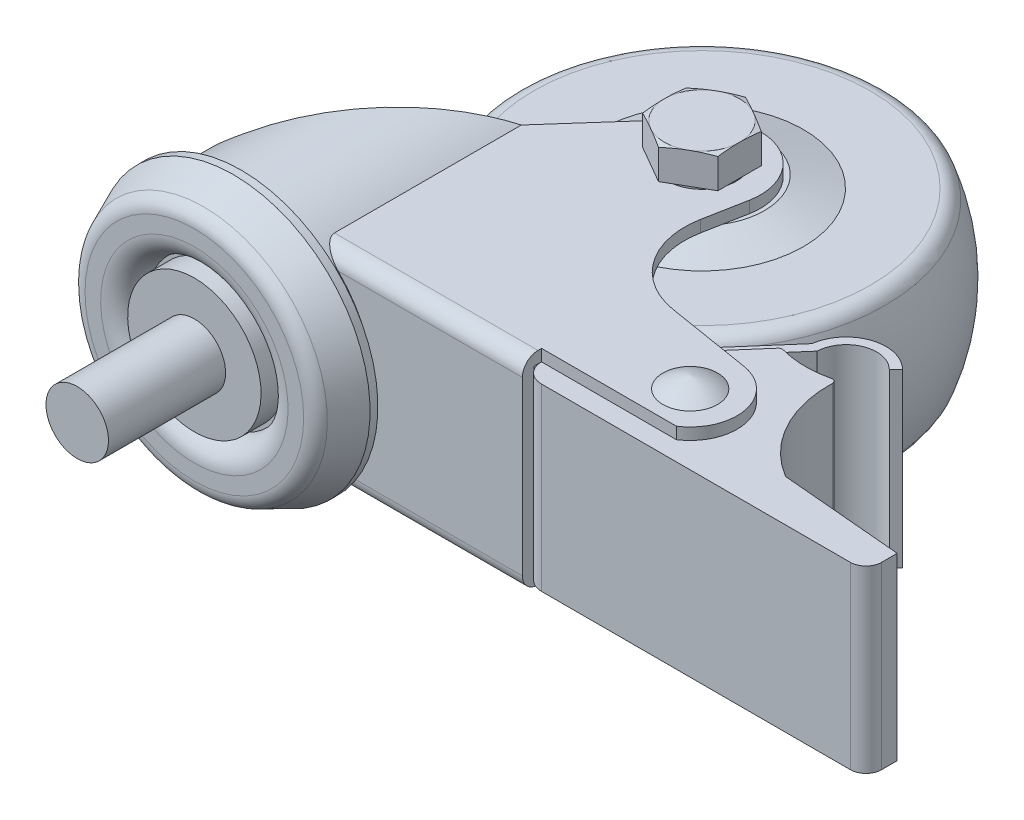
ISO-10303-21;
HEADER;
FILE_DESCRIPTION(('STEP AP214'),'2;1');
FILE_NAME('part.step','',(''),(''),'','','');
FILE_SCHEMA(('AUTOMOTIVE_DESIGN { 1 0 10303 214 1 1 1 1 }'));
ENDSEC;
DATA;
#1=APPLICATION_CONTEXT('core data for automotive mechanical design processes');
#2=APPLICATION_PROTOCOL_DEFINITION('international standard','automotive_design',2000,#1);
#3=PRODUCT_CONTEXT('',#1,'mechanical');
#4=PRODUCT('Part','Part','',(#3));
#5=PRODUCT_RELATED_PRODUCT_CATEGORY('part','',(#4));
#6=PRODUCT_DEFINITION_FORMATION('','',#4);
#7=PRODUCT_DEFINITION_CONTEXT('part definition',#1,'design');
#8=PRODUCT_DEFINITION('design','',#6,#7);
#9=PRODUCT_DEFINITION_SHAPE('','',#8);
#10=(LENGTH_UNIT() NAMED_UNIT(*) SI_UNIT(.MILLI.,.METRE.));
#11=(NAMED_UNIT(*) PLANE_ANGLE_UNIT() SI_UNIT($,.RADIAN.));
#12=(NAMED_UNIT(*) SI_UNIT($,.STERADIAN.) SOLID_ANGLE_UNIT());
#13=UNCERTAINTY_MEASURE_WITH_UNIT(LENGTH_MEASURE(1.E-05),#10,'distance_accuracy_value','');
#14=(GEOMETRIC_REPRESENTATION_CONTEXT(3) GLOBAL_UNCERTAINTY_ASSIGNED_CONTEXT((#13)) GLOBAL_UNIT_ASSIGNED_CONTEXT((#10,
#11,#12)) REPRESENTATION_CONTEXT('',''));
#15=CARTESIAN_POINT('',(0.,0.,0.));
#16=DIRECTION('',(0.,0.,1.));
#17=DIRECTION('',(1.,0.,0.));
#18=AXIS2_PLACEMENT_3D('',#15,#16,#17);
#19=CARTESIAN_POINT('',(24.0000000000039,0.,-41.));
#20=DIRECTION('',(0.,-1.,0.));
#21=DIRECTION('',(-1.,0.,0.));
#22=AXIS2_PLACEMENT_3D('',#19,#20,#21);
#23=SPHERICAL_SURFACE('',#22,25.0000000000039);
#24=CARTESIAN_POINT('',(24.,-8.695652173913,-41.));
#25=DIRECTION('',(0.,-1.,0.));
#26=DIRECTION('',(1.,0.,0.));
#27=AXIS2_PLACEMENT_3D('',#24,#25,#26);
#28=CIRCLE('',#27,23.438976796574);
#29=CARTESIAN_POINT('',(0.561023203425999,-8.695652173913,-41.));
#30=VERTEX_POINT('',#29);
#31=EDGE_CURVE('E498',#30,#30,#28,.T.);
#32=CARTESIAN_POINT('',(24.,8.695652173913,-41.));
#33=DIRECTION('',(0.,-1.,0.));
#34=DIRECTION('',(1.,0.,0.));
#35=AXIS2_PLACEMENT_3D('',#32,#33,#34);
#36=CIRCLE('',#35,23.438976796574);
#37=CARTESIAN_POINT('',(0.561023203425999,8.695652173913,-41.));
#38=VERTEX_POINT('',#37);
#39=EDGE_CURVE('E495',#38,#38,#36,.T.);
#40=CARTESIAN_POINT('',(0.561023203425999,-8.695652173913,-41.));
#41=CARTESIAN_POINT('',(0.496665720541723,-8.52217876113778,-41.));
#42=CARTESIAN_POINT('',(0.434234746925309,-8.34799064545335,-41.));
#43=CARTESIAN_POINT('',(0.313255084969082,-7.99827139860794,-41.));
#44=CARTESIAN_POINT('',(0.254706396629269,-7.82274026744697,-41.));
#45=CARTESIAN_POINT('',(0.141520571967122,-7.47042137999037,-41.));
#46=CARTESIAN_POINT('',(0.0868834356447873,-7.29363362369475,-41.));
#47=CARTESIAN_POINT('',(-0.0184524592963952,-6.93888867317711,-41.));
#48=CARTESIAN_POINT('',(-0.0691512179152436,-6.76093147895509,-41.));
#49=CARTESIAN_POINT('',(-0.166585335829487,-6.4039353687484,-41.));
#50=CARTESIAN_POINT('',(-0.213320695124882,-6.22489645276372,-41.));
#51=CARTESIAN_POINT('',(-0.302804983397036,-5.86582516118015,-41.));
#52=CARTESIAN_POINT('',(-0.345553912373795,-5.68579278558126,-41.));
#53=CARTESIAN_POINT('',(-0.427044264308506,-5.32482332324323,-41.));
#54=CARTESIAN_POINT('',(-0.465785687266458,-5.14388623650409,-41.));
#55=CARTESIAN_POINT('',(-0.539241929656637,-4.78119654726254,-41.));
#56=CARTESIAN_POINT('',(-0.573956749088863,-4.59944394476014,-41.));
#57=CARTESIAN_POINT('',(-0.639342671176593,-4.23521282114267,-41.));
#58=CARTESIAN_POINT('',(-0.670013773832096,-4.0527343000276,-41.));
#59=CARTESIAN_POINT('',(-0.727297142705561,-3.68714129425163,-41.));
#60=CARTESIAN_POINT('',(-0.753909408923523,-3.50402680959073,-41.));
#61=CARTESIAN_POINT('',(-0.803061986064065,-3.13725214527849,-41.));
#62=CARTESIAN_POINT('',(-0.825602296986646,-2.95359196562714,-41.));
#63=CARTESIAN_POINT('',(-0.866599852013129,-2.58581644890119,-41.));
#64=CARTESIAN_POINT('',(-0.885057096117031,-2.4017011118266,-41.));
#65=CARTESIAN_POINT('',(-0.917879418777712,-2.03310604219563,-41.));
#66=CARTESIAN_POINT('',(-0.932244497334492,-1.84862630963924,-41.));
#67=CARTESIAN_POINT('',(-0.956875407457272,-1.47939339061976,-41.));
#68=CARTESIAN_POINT('',(-0.967141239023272,-1.29464020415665,-41.));
#69=CARTESIAN_POINT('',(-0.983568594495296,-0.924951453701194,-41.));
#70=CARTESIAN_POINT('',(-0.989730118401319,-0.740015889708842,-41.));
#71=CARTESIAN_POINT('',(-0.997945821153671,-0.37005355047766,-41.));
#72=CARTESIAN_POINT('',(-1.,-0.18502677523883,-41.));
#73=CARTESIAN_POINT('',(-1.,0.18502677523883,-41.));
#74=CARTESIAN_POINT('',(-0.997945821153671,0.37005355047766,-41.));
#75=CARTESIAN_POINT('',(-0.989730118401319,0.740015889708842,-41.));
#76=CARTESIAN_POINT('',(-0.983568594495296,0.924951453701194,-41.));
#77=CARTESIAN_POINT('',(-0.967141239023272,1.29464020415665,-41.));
#78=CARTESIAN_POINT('',(-0.956875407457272,1.47939339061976,-41.));
#79=CARTESIAN_POINT('',(-0.932244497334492,1.84862630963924,-41.));
#80=CARTESIAN_POINT('',(-0.917879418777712,2.03310604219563,-41.));
#81=CARTESIAN_POINT('',(-0.885057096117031,2.4017011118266,-41.));
#82=CARTESIAN_POINT('',(-0.866599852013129,2.58581644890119,-41.));
#83=CARTESIAN_POINT('',(-0.825602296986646,2.95359196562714,-41.));
#84=CARTESIAN_POINT('',(-0.803061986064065,3.13725214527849,-41.));
#85=CARTESIAN_POINT('',(-0.753909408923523,3.50402680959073,-41.));
#86=CARTESIAN_POINT('',(-0.727297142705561,3.68714129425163,-41.));
#87=CARTESIAN_POINT('',(-0.670013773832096,4.0527343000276,-41.));
#88=CARTESIAN_POINT('',(-0.639342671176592,4.23521282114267,-41.));
#89=CARTESIAN_POINT('',(-0.573956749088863,4.59944394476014,-41.));
#90=CARTESIAN_POINT('',(-0.539241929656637,4.78119654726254,-41.));
#91=CARTESIAN_POINT('',(-0.465785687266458,5.14388623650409,-41.));
#92=CARTESIAN_POINT('',(-0.427044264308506,5.32482332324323,-41.));
#93=CARTESIAN_POINT('',(-0.345553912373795,5.68579278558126,-41.));
#94=CARTESIAN_POINT('',(-0.302804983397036,5.86582516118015,-41.));
#95=CARTESIAN_POINT('',(-0.213320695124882,6.22489645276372,-41.));
#96=CARTESIAN_POINT('',(-0.166585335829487,6.4039353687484,-41.));
#97=CARTESIAN_POINT('',(-0.0691512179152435,6.76093147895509,-41.));
#98=CARTESIAN_POINT('',(-0.0184524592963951,6.93888867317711,-41.));
#99=CARTESIAN_POINT('',(0.0868834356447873,7.29363362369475,-41.));
#100=CARTESIAN_POINT('',(0.141520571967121,7.47042137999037,-41.));
#101=CARTESIAN_POINT('',(0.254706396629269,7.82274026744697,-41.));
#102=CARTESIAN_POINT('',(0.313255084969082,7.99827139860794,-41.));
#103=CARTESIAN_POINT('',(0.434234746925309,8.34799064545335,-41.));
#104=CARTESIAN_POINT('',(0.496665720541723,8.52217876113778,-41.));
#105=CARTESIAN_POINT('',(0.561023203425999,8.695652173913,-41.));
#106=B_SPLINE_CURVE_WITH_KNOTS('',3,(#40,#41,#42,#43,#44,#45,#46,#47,#48,#49,#50,#51,#52,#53,
#54,#55,#56,#57,#58,#59,#60,#61,#62,#63,#64,#65,#66,#67,#68,#69,#70,#71,#72,#73,#74,#75,#76,#77,
#78,#79,#80,#81,#82,#83,#84,#85,#86,#87,#88,#89,#90,#91,#92,#93,#94,#95,#96,#97,#98,#99,#100,
#101,#102,#103,#104,#105),.UNSPECIFIED.,.F.,.F.,(4,2,2,2,2,2,2,2,2,2,2,2,2,2,2,2,2,2,2,2,2,2,2,
2,2,2,2,2,2,2,2,2,4),(0.,0.555068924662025,1.11013784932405,1.66520677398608,2.2202756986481,
2.77534462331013,3.33041354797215,3.88548247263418,4.4405513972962,4.99562032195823,
5.55068924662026,6.10575817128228,6.66082709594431,7.21589602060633,7.77096494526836,
8.32603386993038,8.88110279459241,9.43617171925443,9.99124064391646,10.5463095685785,
11.1013784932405,11.6564474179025,12.2115163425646,12.7665852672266,13.3216541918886,
13.8767231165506,14.4317920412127,14.9868609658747,15.5419298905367,16.0969988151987,
16.6520677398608,17.2071366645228,17.7622055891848),.UNSPECIFIED.);
#107=EDGE_CURVE('BSEAM14',#30,#38,#106,.T.);
#108=ORIENTED_EDGE('',*,*,#31,.F.);
#109=ORIENTED_EDGE('',*,*,#39,.T.);
#110=ORIENTED_EDGE('',*,*,#107,.T.);
#111=ORIENTED_EDGE('',*,*,#107,.F.);
#112=EDGE_LOOP('',(#108,#110,#109,#111));
#113=FACE_BOUND('',#112,.T.);
#114=ADVANCED_FACE('F14',(#113),#23,.T.);
#115=CARTESIAN_POINT('',(24.,7.99999999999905,-41.));
#116=DIRECTION('',(0.,-1.,0.));
#117=DIRECTION('',(1.,0.,0.));
#118=AXIS2_PLACEMENT_3D('',#115,#116,#117);
#119=TOROIDAL_SURFACE('',#118,21.5638586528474,2.00000000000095);
#120=ORIENTED_EDGE('',*,*,#39,.F.);
#121=EDGE_LOOP('',(#120));
#122=FACE_BOUND('',#121,.T.);
#123=CARTESIAN_POINT('',(24.,10.,-41.));
#124=DIRECTION('',(0.,-1.,0.));
#125=DIRECTION('',(1.,0.,0.));
#126=AXIS2_PLACEMENT_3D('',#123,#124,#125);
#127=CIRCLE('',#126,21.563858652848);
#128=CARTESIAN_POINT('',(45.563858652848,10.,-41.));
#129=VERTEX_POINT('',#128);
#130=EDGE_CURVE('E492',#129,#129,#127,.T.);
#131=ORIENTED_EDGE('',*,*,#130,.T.);
#132=EDGE_LOOP('',(#131));
#133=FACE_BOUND('',#132,.T.);
#134=ADVANCED_FACE('F660',(#122,#133),#119,.T.);
#135=CARTESIAN_POINT('',(2.436141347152,10.,-41.));
#136=DIRECTION('',(0.,-1.,0.));
#137=DIRECTION('',(1.,0.,0.));
#138=AXIS2_PLACEMENT_3D('',#135,#136,#137);
#139=PLANE('',#138);
#140=ORIENTED_EDGE('',*,*,#130,.F.);
#141=EDGE_LOOP('',(#140));
#142=FACE_BOUND('',#141,.T.);
#143=CARTESIAN_POINT('',(24.,10.,-41.));
#144=DIRECTION('',(0.,-1.,0.));
#145=DIRECTION('',(1.,0.,0.));
#146=AXIS2_PLACEMENT_3D('',#143,#144,#145);
#147=CIRCLE('',#146,13.);
#148=CARTESIAN_POINT('',(37.,10.,-41.));
#149=VERTEX_POINT('',#148);
#150=EDGE_CURVE('E469',#149,#149,#147,.T.);
#151=ORIENTED_EDGE('',*,*,#150,.T.);
#152=EDGE_LOOP('',(#151));
#153=FACE_BOUND('',#152,.T.);
#154=ADVANCED_FACE('F667',(#142,#153),#139,.F.);
#155=CARTESIAN_POINT('',(24.,11.5,-41.));
#156=DIRECTION('',(0.,-1.,0.));
#157=DIRECTION('',(1.,0.,0.));
#158=AXIS2_PLACEMENT_3D('',#155,#156,#157);
#159=CONICAL_SURFACE('',#158,8.,1.27933953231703);
#160=ORIENTED_EDGE('',*,*,#150,.F.);
#161=EDGE_LOOP('',(#160));
#162=FACE_BOUND('',#161,.T.);
#163=CARTESIAN_POINT('',(24.,11.5,-41.));
#164=DIRECTION('',(0.,-1.,0.));
#165=DIRECTION('',(1.,0.,0.));
#166=AXIS2_PLACEMENT_3D('',#163,#164,#165);
#167=CIRCLE('',#166,8.);
#168=CARTESIAN_POINT('',(30.8335931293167,11.5,-36.8404321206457));
#169=VERTEX_POINT('',#168);
#170=CARTESIAN_POINT('',(16.0677992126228,11.5,-42.0393222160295));
#171=VERTEX_POINT('',#170);
#172=EDGE_CURVE('E460',#169,#171,#167,.T.);
#173=ORIENTED_EDGE('',*,*,#172,.T.);
#174=EDGE_CURVE('E464',#171,#169,#167,.T.);
#175=ORIENTED_EDGE('',*,*,#174,.T.);
#176=EDGE_LOOP('',(#173,#175));
#177=FACE_BOUND('',#176,.T.);
#178=ADVANCED_FACE('F462',(#162,#177),#159,.T.);
#179=CARTESIAN_POINT('',(16.,11.5,-41.));
#180=DIRECTION('',(0.,-1.,0.));
#181=DIRECTION('',(1.,0.,0.));
#182=AXIS2_PLACEMENT_3D('',#179,#180,#181);
#183=PLANE('',#182);
#184=ORIENTED_EDGE('',*,*,#174,.F.);
#185=DIRECTION('',(0.663245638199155,0.,-0.748401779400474));
#186=VECTOR('',#185,1.);
#187=CARTESIAN_POINT('',(15.5220819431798,11.5,-41.4235386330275));
#188=LINE('',#187,#186);
#189=CARTESIAN_POINT('',(19.2611875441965,11.5,-45.6427194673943));
#190=VERTEX_POINT('',#189);
#191=EDGE_CURVE('E9',#171,#190,#188,.T.);
#192=ORIENTED_EDGE('',*,*,#191,.T.);
#193=CARTESIAN_POINT('',(24.5,11.5,-41.));
#194=DIRECTION('',(0.,-1.,0.));
#195=DIRECTION('',(1.,0.,0.));
#196=AXIS2_PLACEMENT_3D('',#193,#194,#195);
#197=CIRCLE('',#196,7.);
#198=CARTESIAN_POINT('',(31.376387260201,11.5,-39.6903060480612));
#199=VERTEX_POINT('',#198);
#200=EDGE_CURVE('E38',#190,#199,#197,.T.);
#201=ORIENTED_EDGE('',*,*,#200,.T.);
#202=DIRECTION('',(-0.187099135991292,0.,0.982341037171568));
#203=VECTOR('',#202,1.);
#204=CARTESIAN_POINT('',(31.0788355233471,11.5,-38.1280471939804));
#205=LINE('',#204,#203);
#206=EDGE_CURVE('E30',#199,#169,#205,.T.);
#207=ORIENTED_EDGE('',*,*,#206,.T.);
#208=EDGE_LOOP('',(#184,#192,#201,#207));
#209=FACE_BOUND('',#208,.T.);
#210=ADVANCED_FACE('F486',(#209),#183,.F.);
#211=CARTESIAN_POINT('',(24.,-7.99999999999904,-41.));
#212=DIRECTION('',(0.,-1.,0.));
#213=DIRECTION('',(1.,0.,0.));
#214=AXIS2_PLACEMENT_3D('',#211,#212,#213);
#215=TOROIDAL_SURFACE('',#214,21.5638586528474,2.00000000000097);
#216=CARTESIAN_POINT('',(24.,-10.,-41.));
#217=DIRECTION('',(0.,-1.,0.));
#218=DIRECTION('',(1.,0.,0.));
#219=AXIS2_PLACEMENT_3D('',#216,#217,#218);
#220=CIRCLE('',#219,21.563858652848);
#221=CARTESIAN_POINT('',(45.563858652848,-10.,-41.));
#222=VERTEX_POINT('',#221);
#223=EDGE_CURVE('E501',#222,#222,#220,.T.);
#224=ORIENTED_EDGE('',*,*,#223,.F.);
#225=EDGE_LOOP('',(#224));
#226=FACE_BOUND('',#225,.T.);
#227=ORIENTED_EDGE('',*,*,#31,.T.);
#228=EDGE_LOOP('',(#227));
#229=FACE_BOUND('',#228,.T.);
#230=ADVANCED_FACE('F674',(#226,#229),#215,.T.);
#231=CARTESIAN_POINT('',(11.,-10.,-41.));
#232=DIRECTION('',(0.,1.,0.));
#233=DIRECTION('',(-1.,0.,0.));
#234=AXIS2_PLACEMENT_3D('',#231,#232,#233);
#235=PLANE('',#234);
#236=CARTESIAN_POINT('',(24.,-10.,-41.));
#237=DIRECTION('',(0.,-1.,0.));
#238=DIRECTION('',(1.,0.,0.));
#239=AXIS2_PLACEMENT_3D('',#236,#237,#238);
#240=CIRCLE('',#239,13.);
#241=CARTESIAN_POINT('',(37.,-10.,-41.));
#242=VERTEX_POINT('',#241);
#243=EDGE_CURVE('E504',#242,#242,#240,.T.);
#244=ORIENTED_EDGE('',*,*,#243,.F.);
#245=EDGE_LOOP('',(#244));
#246=FACE_BOUND('',#245,.T.);
#247=ORIENTED_EDGE('',*,*,#223,.T.);
#248=EDGE_LOOP('',(#247));
#249=FACE_BOUND('',#248,.T.);
#250=ADVANCED_FACE('F677',(#246,#249),#235,.F.);
#251=CARTESIAN_POINT('',(24.,-10.,-41.));
#252=DIRECTION('',(0.,1.,0.));
#253=DIRECTION('',(-1.,0.,0.));
#254=AXIS2_PLACEMENT_3D('',#251,#252,#253);
#255=CONICAL_SURFACE('',#254,13.,1.27933953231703);
#256=CARTESIAN_POINT('',(24.,-11.5,-41.));
#257=DIRECTION('',(0.,-1.,0.));
#258=DIRECTION('',(1.,0.,0.));
#259=AXIS2_PLACEMENT_3D('',#256,#257,#258);
#260=CIRCLE('',#259,8.);
#261=CARTESIAN_POINT('',(30.8335931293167,-11.5,-36.8404321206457));
#262=VERTEX_POINT('',#261);
#263=CARTESIAN_POINT('',(16.0677992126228,-11.5,-42.0393222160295));
#264=VERTEX_POINT('',#263);
#265=EDGE_CURVE('E445',#262,#264,#260,.T.);
#266=ORIENTED_EDGE('',*,*,#265,.F.);
#267=EDGE_CURVE('E487',#264,#262,#260,.T.);
#268=ORIENTED_EDGE('',*,*,#267,.F.);
#269=EDGE_LOOP('',(#266,#268));
#270=FACE_BOUND('',#269,.T.);
#271=ORIENTED_EDGE('',*,*,#243,.T.);
#272=EDGE_LOOP('',(#271));
#273=FACE_BOUND('',#272,.T.);
#274=ADVANCED_FACE('F680',(#270,#273),#255,.T.);
#275=CARTESIAN_POINT('',(21.,-11.5,-41.));
#276=DIRECTION('',(0.,1.,0.));
#277=DIRECTION('',(-1.,0.,0.));
#278=AXIS2_PLACEMENT_3D('',#275,#276,#277);
#279=PLANE('',#278);
#280=CARTESIAN_POINT('',(24.5,-11.5,-41.));
#281=DIRECTION('',(0.,1.,0.));
#282=DIRECTION('',(-1.,0.,0.));
#283=AXIS2_PLACEMENT_3D('',#280,#281,#282);
#284=CIRCLE('',#283,7.);
#285=CARTESIAN_POINT('',(31.376387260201,-11.5,-39.6903060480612));
#286=VERTEX_POINT('',#285);
#287=CARTESIAN_POINT('',(19.2611875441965,-11.5,-45.6427194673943));
#288=VERTEX_POINT('',#287);
#289=EDGE_CURVE('E507',#286,#288,#284,.T.);
#290=ORIENTED_EDGE('',*,*,#289,.T.);
#291=DIRECTION('',(-0.663245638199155,0.,0.748401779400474));
#292=VECTOR('',#291,1.);
#293=CARTESIAN_POINT('',(17.7215558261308,-11.5,-43.9054097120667));
#294=LINE('',#293,#292);
#295=EDGE_CURVE('E511',#288,#264,#294,.T.);
#296=ORIENTED_EDGE('',*,*,#295,.T.);
#297=ORIENTED_EDGE('',*,*,#267,.T.);
#298=DIRECTION('',(0.187099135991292,0.,-0.982341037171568));
#299=VECTOR('',#298,1.);
#300=CARTESIAN_POINT('',(31.2538659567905,-11.5,-39.0470229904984));
#301=LINE('',#300,#299);
#302=EDGE_CURVE('E509',#262,#286,#301,.T.);
#303=ORIENTED_EDGE('',*,*,#302,.T.);
#304=EDGE_LOOP('',(#290,#296,#297,#303));
#305=FACE_BOUND('',#304,.T.);
#306=ADVANCED_FACE('F683',(#305),#279,.F.);
#307=CARTESIAN_POINT('',(0.,0.,15.));
#308=DIRECTION('',(0.,0.,-1.));
#309=DIRECTION('',(0.,-1.,0.));
#310=AXIS2_PLACEMENT_3D('',#307,#308,#309);
#311=PLANE('',#310);
#312=CARTESIAN_POINT('',(0.,0.,15.));
#313=DIRECTION('',(0.,0.,1.));
#314=DIRECTION('',(0.,1.,0.));
#315=AXIS2_PLACEMENT_3D('',#312,#313,#314);
#316=CIRCLE('',#315,4.);
#317=CARTESIAN_POINT('',(0.,4.,15.));
#318=VERTEX_POINT('',#317);
#319=EDGE_CURVE('E1281',#318,#318,#316,.T.);
#320=ORIENTED_EDGE('',*,*,#319,.T.);
#321=EDGE_LOOP('',(#320));
#322=FACE_BOUND('',#321,.T.);
#323=ADVANCED_FACE('F576',(#322),#311,.F.);
#324=CARTESIAN_POINT('',(0.,0.,-6.));
#325=DIRECTION('',(0.,0.,1.));
#326=DIRECTION('',(0.,1.,0.));
#327=AXIS2_PLACEMENT_3D('',#324,#325,#326);
#328=CYLINDRICAL_SURFACE('',#327,4.);
#329=ORIENTED_EDGE('',*,*,#319,.F.);
#330=EDGE_LOOP('',(#329));
#331=FACE_BOUND('',#330,.T.);
#332=CARTESIAN_POINT('',(0.,0.,0.));
#333=DIRECTION('',(0.,0.,1.));
#334=DIRECTION('',(0.,1.,0.));
#335=AXIS2_PLACEMENT_3D('',#332,#333,#334);
#336=CIRCLE('',#335,4.);
#337=CARTESIAN_POINT('',(0.,4.,0.));
#338=VERTEX_POINT('',#337);
#339=EDGE_CURVE('E1279',#338,#338,#336,.T.);
#340=ORIENTED_EDGE('',*,*,#339,.T.);
#341=EDGE_LOOP('',(#340));
#342=FACE_BOUND('',#341,.T.);
#343=ADVANCED_FACE('F699',(#331,#342),#328,.T.);
#344=CARTESIAN_POINT('',(-4.,0.,0.));
#345=DIRECTION('',(0.,0.,-1.));
#346=DIRECTION('',(0.,-1.,0.));
#347=AXIS2_PLACEMENT_3D('',#344,#345,#346);
#348=PLANE('',#347);
#349=ORIENTED_EDGE('',*,*,#339,.F.);
#350=EDGE_LOOP('',(#349));
#351=FACE_BOUND('',#350,.T.);
#352=CARTESIAN_POINT('',(0.,0.,0.));
#353=DIRECTION('',(0.,0.,1.));
#354=DIRECTION('',(0.,1.,0.));
#355=AXIS2_PLACEMENT_3D('',#352,#353,#354);
#356=CIRCLE('',#355,8.53912956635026);
#357=CARTESIAN_POINT('',(0.,8.53912956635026,0.));
#358=VERTEX_POINT('',#357);
#359=EDGE_CURVE('E1276',#358,#358,#356,.T.);
#360=ORIENTED_EDGE('',*,*,#359,.T.);
#361=EDGE_LOOP('',(#360));
#362=FACE_BOUND('',#361,.T.);
#363=ADVANCED_FACE('F1929',(#351,#362),#348,.F.);
#364=CARTESIAN_POINT('',(0.,0.,-6.));
#365=DIRECTION('',(0.,0.,1.));
#366=DIRECTION('',(0.,1.,0.));
#367=AXIS2_PLACEMENT_3D('',#364,#365,#366);
#368=CYLINDRICAL_SURFACE('',#367,8.53912956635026);
#369=ORIENTED_EDGE('',*,*,#359,.F.);
#370=EDGE_LOOP('',(#369));
#371=FACE_BOUND('',#370,.T.);
#372=CARTESIAN_POINT('',(0.,0.,-3.0003877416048));
#373=DIRECTION('',(0.,0.,1.));
#374=DIRECTION('',(0.,1.,0.));
#375=AXIS2_PLACEMENT_3D('',#372,#373,#374);
#376=CIRCLE('',#375,8.53912956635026);
#377=CARTESIAN_POINT('',(0.,8.53912956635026,-3.0003877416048));
#378=VERTEX_POINT('',#377);
#379=EDGE_CURVE('E1273',#378,#378,#376,.T.);
#380=ORIENTED_EDGE('',*,*,#379,.T.);
#381=EDGE_LOOP('',(#380));
#382=FACE_BOUND('',#381,.T.);
#383=ADVANCED_FACE('F912',(#371,#382),#368,.T.);
#384=CARTESIAN_POINT('',(-8.53912956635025,0.,-3.0003877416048));
#385=DIRECTION('',(0.,0.,-1.));
#386=DIRECTION('',(0.,-1.,0.));
#387=AXIS2_PLACEMENT_3D('',#384,#385,#386);
#388=PLANE('',#387);
#389=ORIENTED_EDGE('',*,*,#379,.F.);
#390=EDGE_LOOP('',(#389));
#391=FACE_BOUND('',#390,.T.);
#392=CARTESIAN_POINT('',(0.,0.,-3.0003877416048));
#393=DIRECTION('',(0.,0.,1.));
#394=DIRECTION('',(0.,1.,0.));
#395=AXIS2_PLACEMENT_3D('',#392,#393,#394);
#396=CIRCLE('',#395,9.00000002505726);
#397=CARTESIAN_POINT('',(0.,9.00000002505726,-3.0003877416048));
#398=VERTEX_POINT('',#397);
#399=EDGE_CURVE('E1270',#398,#398,#396,.T.);
#400=ORIENTED_EDGE('',*,*,#399,.T.);
#401=EDGE_LOOP('',(#400));
#402=FACE_BOUND('',#401,.T.);
#403=ADVANCED_FACE('F900',(#391,#402),#388,.F.);
#404=CARTESIAN_POINT('',(24.,-19.,-38.6135));
#405=DIRECTION('',(0.,1.,0.));
#406=DIRECTION('',(-1.,0.,0.));
#407=AXIS2_PLACEMENT_3D('',#404,#405,#406);
#408=PLANE('',#407);
#409=CARTESIAN_POINT('',(24.,-19.,-41.));
#410=DIRECTION('',(0.,1.,0.));
#411=DIRECTION('',(-1.,0.,0.));
#412=AXIS2_PLACEMENT_3D('',#409,#410,#411);
#413=CIRCLE('',#412,2.3865);
#414=CARTESIAN_POINT('',(21.6135,-19.,-41.));
#415=VERTEX_POINT('',#414);
#416=EDGE_CURVE('E1441',#415,#415,#413,.T.);
#417=ORIENTED_EDGE('',*,*,#416,.F.);
#418=EDGE_LOOP('',(#417));
#419=FACE_BOUND('',#418,.T.);
#420=ADVANCED_FACE('F888',(#419),#408,.F.);
#421=CARTESIAN_POINT('',(0.,0.,-3.));
#422=DIRECTION('',(0.,0.,1.));
#423=DIRECTION('',(0.,1.,0.));
#424=AXIS2_PLACEMENT_3D('',#421,#422,#423);
#425=TOROIDAL_SURFACE('',#424,12.,3.);
#426=ORIENTED_EDGE('',*,*,#399,.F.);
#427=EDGE_LOOP('',(#426));
#428=FACE_BOUND('',#427,.T.);
#429=CARTESIAN_POINT('',(0.,0.,0.));
#430=DIRECTION('',(0.,0.,1.));
#431=DIRECTION('',(0.,1.,0.));
#432=AXIS2_PLACEMENT_3D('',#429,#430,#431);
#433=CIRCLE('',#432,12.);
#434=CARTESIAN_POINT('',(0.,12.,0.));
#435=VERTEX_POINT('',#434);
#436=EDGE_CURVE('E1267',#435,#435,#433,.T.);
#437=ORIENTED_EDGE('',*,*,#436,.T.);
#438=EDGE_LOOP('',(#437));
#439=FACE_BOUND('',#438,.T.);
#440=ADVANCED_FACE('F899',(#428,#439),#425,.T.);
#441=CARTESIAN_POINT('',(24.,-19.,-41.));
#442=DIRECTION('',(0.,1.,0.));
#443=DIRECTION('',(-1.,0.,0.));
#444=AXIS2_PLACEMENT_3D('',#441,#442,#443);
#445=CONICAL_SURFACE('',#444,2.3865,0.785398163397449);
#446=CARTESIAN_POINT('',(24.,-18.3865,-41.));
#447=DIRECTION('',(0.,1.,0.));
#448=DIRECTION('',(-1.,0.,0.));
#449=AXIS2_PLACEMENT_3D('',#446,#447,#448);
#450=CIRCLE('',#449,3.);
#451=CARTESIAN_POINT('',(21.,-18.3865,-41.));
#452=VERTEX_POINT('',#451);
#453=EDGE_CURVE('E1439',#452,#452,#450,.T.);
#454=ORIENTED_EDGE('',*,*,#453,.F.);
#455=EDGE_LOOP('',(#454));
#456=FACE_BOUND('',#455,.T.);
#457=ORIENTED_EDGE('',*,*,#416,.T.);
#458=EDGE_LOOP('',(#457));
#459=FACE_BOUND('',#458,.T.);
#460=ADVANCED_FACE('F903',(#456,#459),#445,.T.);
#461=CARTESIAN_POINT('',(24.,17.5,-41.));
#462=DIRECTION('',(0.,-1.,0.));
#463=DIRECTION('',(1.,0.,0.));
#464=AXIS2_PLACEMENT_3D('',#461,#462,#463);
#465=PLANE('',#464);
#466=CARTESIAN_POINT('',(24.,17.5,-41.));
#467=DIRECTION('',(0.,1.,0.));
#468=DIRECTION('',(-1.,0.,0.));
#469=AXIS2_PLACEMENT_3D('',#466,#467,#468);
#470=CIRCLE('',#469,4.8166666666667);
#471=CARTESIAN_POINT('',(19.183333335,17.5000000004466,-41.));
#472=VERTEX_POINT('',#471);
#473=CARTESIAN_POINT('',(21.5916666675,17.5000000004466,-36.8286443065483));
#474=VERTEX_POINT('',#473);
#475=EDGE_CURVE('E1430',#472,#474,#470,.T.);
#476=ORIENTED_EDGE('',*,*,#475,.T.);
#477=CARTESIAN_POINT('',(26.4083333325,17.5000000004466,-36.8286443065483));
#478=VERTEX_POINT('',#477);
#479=EDGE_CURVE('E1434',#474,#478,#470,.T.);
#480=ORIENTED_EDGE('',*,*,#479,.T.);
#481=CARTESIAN_POINT('',(28.816666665,17.5000000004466,-41.));
#482=VERTEX_POINT('',#481);
#483=EDGE_CURVE('E1577',#478,#482,#470,.T.);
#484=ORIENTED_EDGE('',*,*,#483,.T.);
#485=CARTESIAN_POINT('',(26.4083333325,17.5000000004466,-45.1713556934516));
#486=VERTEX_POINT('',#485);
#487=EDGE_CURVE('E1572',#482,#486,#470,.T.);
#488=ORIENTED_EDGE('',*,*,#487,.T.);
#489=CARTESIAN_POINT('',(21.5916666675,17.5000000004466,-45.1713556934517));
#490=VERTEX_POINT('',#489);
#491=EDGE_CURVE('E1569',#486,#490,#470,.T.);
#492=ORIENTED_EDGE('',*,*,#491,.T.);
#493=EDGE_CURVE('E1435',#490,#472,#470,.T.);
#494=ORIENTED_EDGE('',*,*,#493,.T.);
#495=EDGE_LOOP('',(#476,#480,#484,#488,#492,#494));
#496=FACE_BOUND('',#495,.T.);
#497=ADVANCED_FACE('F919',(#496),#465,.F.);
#498=CARTESIAN_POINT('',(-12.,0.,0.));
#499=DIRECTION('',(0.,0.,-1.));
#500=DIRECTION('',(0.,-1.,0.));
#501=AXIS2_PLACEMENT_3D('',#498,#499,#500);
#502=PLANE('',#501);
#503=ORIENTED_EDGE('',*,*,#436,.F.);
#504=EDGE_LOOP('',(#503));
#505=FACE_BOUND('',#504,.T.);
#506=CARTESIAN_POINT('',(0.,0.,0.));
#507=DIRECTION('',(0.,0.,1.));
#508=DIRECTION('',(0.,1.,0.));
#509=AXIS2_PLACEMENT_3D('',#506,#507,#508);
#510=CIRCLE('',#509,14.0000000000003);
#511=CARTESIAN_POINT('',(0.,14.0000000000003,0.));
#512=VERTEX_POINT('',#511);
#513=EDGE_CURVE('E1264',#512,#512,#510,.T.);
#514=ORIENTED_EDGE('',*,*,#513,.T.);
#515=EDGE_LOOP('',(#514));
#516=FACE_BOUND('',#515,.T.);
#517=ADVANCED_FACE('F911',(#505,#516),#502,.F.);
#518=CARTESIAN_POINT('',(24.,-19.,-41.));
#519=DIRECTION('',(0.,1.,0.));
#520=DIRECTION('',(-1.,0.,0.));
#521=AXIS2_PLACEMENT_3D('',#518,#519,#520);
#522=CYLINDRICAL_SURFACE('',#521,3.);
#523=ORIENTED_EDGE('',*,*,#453,.T.);
#524=EDGE_LOOP('',(#523));
#525=FACE_BOUND('',#524,.T.);
#526=CARTESIAN_POINT('',(24.,-18.,-41.));
#527=DIRECTION('',(0.,1.,0.));
#528=DIRECTION('',(-1.,0.,0.));
#529=AXIS2_PLACEMENT_3D('',#526,#527,#528);
#530=CIRCLE('',#529,3.);
#531=CARTESIAN_POINT('',(21.,-18.,-41.));
#532=VERTEX_POINT('',#531);
#533=EDGE_CURVE('E775',#532,#532,#530,.T.);
#534=ORIENTED_EDGE('',*,*,#533,.F.);
#535=EDGE_LOOP('',(#534));
#536=FACE_BOUND('',#535,.T.);
#537=ADVANCED_FACE('F921',(#525,#536),#522,.T.);
#538=CARTESIAN_POINT('',(24.,17.241875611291,-41.));
#539=DIRECTION('',(0.,-1.,0.));
#540=DIRECTION('',(1.,0.,0.));
#541=AXIS2_PLACEMENT_3D('',#538,#539,#540);
#542=CONICAL_SURFACE('',#541,5.78,1.3089969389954);
#543=ORIENTED_EDGE('',*,*,#491,.F.);
#544=CARTESIAN_POINT('',(30.8015018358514,16.916250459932,-42.6349586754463));
#545=CARTESIAN_POINT('',(30.6257013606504,16.9556761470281,-42.7364571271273));
#546=CARTESIAN_POINT('',(30.4497195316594,16.994056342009,-42.8380602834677));
#547=CARTESIAN_POINT('',(30.0973145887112,17.0681747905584,-43.0415213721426));
#548=CARTESIAN_POINT('',(29.9208914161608,17.1039126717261,-43.1433793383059));
#549=CARTESIAN_POINT('',(29.567144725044,17.1722672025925,-43.3476150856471));
#550=CARTESIAN_POINT('',(29.3898200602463,17.204876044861,-43.449993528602));
#551=CARTESIAN_POINT('',(29.0346754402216,17.2661778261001,-43.6550363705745));
#552=CARTESIAN_POINT('',(28.8568555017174,17.29487089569,-43.7577007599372));
#553=CARTESIAN_POINT('',(28.3271265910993,17.3732130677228,-44.0635398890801));
#554=CARTESIAN_POINT('',(27.9744013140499,17.4160421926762,-44.2671859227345));
#555=CARTESIAN_POINT('',(27.4443349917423,17.4618282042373,-44.5732198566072));
#556=CARTESIAN_POINT('',(27.2675792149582,17.4740123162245,-44.6752698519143));
#557=CARTESIAN_POINT('',(26.9138113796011,17.4916795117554,-44.8795178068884));
#558=CARTESIAN_POINT('',(26.736799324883,17.4971626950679,-44.9817157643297));
#559=CARTESIAN_POINT('',(26.3825425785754,17.5011390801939,-45.1862459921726));
#560=CARTESIAN_POINT('',(26.2052978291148,17.4996254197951,-45.2885782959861));
#561=CARTESIAN_POINT('',(25.8509545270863,17.4896745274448,-45.4931584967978));
#562=CARTESIAN_POINT('',(25.6738559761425,17.4812372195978,-45.5954063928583));
#563=CARTESIAN_POINT('',(25.3197826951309,17.4578543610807,-45.7998306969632));
#564=CARTESIAN_POINT('',(25.1428083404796,17.4429013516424,-45.9020068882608));
#565=CARTESIAN_POINT('',(24.7893076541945,17.4071621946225,-46.1061006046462));
#566=CARTESIAN_POINT('',(24.612781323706,17.3863760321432,-46.2080181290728));
#567=CARTESIAN_POINT('',(24.2579811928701,17.3394631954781,-46.4128620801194));
#568=CARTESIAN_POINT('',(24.0797138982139,17.3132716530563,-46.5157847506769));
#569=CARTESIAN_POINT('',(23.7236966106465,17.2565352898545,-46.7213314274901));
#570=CARTESIAN_POINT('',(23.5459466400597,17.225990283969,-46.8239554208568));
#571=CARTESIAN_POINT('',(23.1913512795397,17.161377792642,-47.0286811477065));
#572=CARTESIAN_POINT('',(23.0145047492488,17.1273185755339,-47.1307835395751));
#573=CARTESIAN_POINT('',(22.6612876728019,17.0562433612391,-47.3347135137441));
#574=CARTESIAN_POINT('',(22.4849170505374,17.0192278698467,-47.4365411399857));
#575=CARTESIAN_POINT('',(22.308745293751,16.9810400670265,-47.53825395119));
#576=B_SPLINE_CURVE_WITH_KNOTS('',3,(#544,#545,#546,#547,#548,#549,#550,#551,#552,#553,#554,
#555,#556,#557,#558,#559,#560,#561,#562,#563,#564,#565,#566,#567,#568,#569,#570,#571,#572,#573,
#574,#575),.UNSPECIFIED.,.F.,.F.,(4,2,2,2,2,2,2,2,2,2,2,2,2,2,2,4),(0.,0.62037610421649,
1.24083947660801,1.86281279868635,2.48476536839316,3.7126906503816,4.32598884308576,
4.93927790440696,5.55316858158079,6.16706598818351,6.78166799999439,7.39627158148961,
8.01873126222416,8.64121741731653,9.26227099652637,9.88321854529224),.UNSPECIFIED.);
#577=CARTESIAN_POINT('',(24.,17.3003400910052,-46.5618075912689));
#578=VERTEX_POINT('',#577);
#579=EDGE_CURVE('E1474',#486,#578,#576,.T.);
#580=ORIENTED_EDGE('',*,*,#579,.T.);
#581=CARTESIAN_POINT('',(28.0120733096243,16.4216958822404,-48.878179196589));
#582=CARTESIAN_POINT('',(27.8143203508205,16.4729874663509,-48.7640064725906));
#583=CARTESIAN_POINT('',(27.6164402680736,16.5236383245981,-48.6497603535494));
#584=CARTESIAN_POINT('',(27.220359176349,16.6232921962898,-48.4210828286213));
#585=CARTESIAN_POINT('',(27.0221581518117,16.6722951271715,-48.306651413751));
#586=CARTESIAN_POINT('',(26.6250263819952,16.7683690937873,-48.0773672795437));
#587=CARTESIAN_POINT('',(26.4260949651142,16.815436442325,-47.9625141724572));
#588=CARTESIAN_POINT('',(26.0277958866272,16.9070404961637,-47.7325560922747));
#589=CARTESIAN_POINT('',(25.8284282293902,16.9515772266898,-47.6174511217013));
#590=CARTESIAN_POINT('',(25.4316783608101,17.0369472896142,-47.3883874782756));
#591=CARTESIAN_POINT('',(25.2343025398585,17.0778200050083,-47.2744324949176));
#592=CARTESIAN_POINT('',(24.8389817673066,17.1557062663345,-47.0461939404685));
#593=CARTESIAN_POINT('',(24.6410368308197,17.1927199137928,-46.9319103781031));
#594=CARTESIAN_POINT('',(24.2446529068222,17.2619238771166,-46.7030580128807));
#595=CARTESIAN_POINT('',(24.0462143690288,17.2941175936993,-46.5884894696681));
#596=CARTESIAN_POINT('',(23.6486804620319,17.3526235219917,-46.3589731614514));
#597=CARTESIAN_POINT('',(23.4495850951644,17.3789357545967,-46.2440253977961));
#598=CARTESIAN_POINT('',(23.048775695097,17.4247507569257,-46.0126179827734));
#599=CARTESIAN_POINT('',(22.8470554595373,17.4441824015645,-45.8961547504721));
#600=CARTESIAN_POINT('',(22.4431401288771,17.474778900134,-45.6629541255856));
#601=CARTESIAN_POINT('',(22.2409450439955,17.48594393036,-45.5462167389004));
#602=CARTESIAN_POINT('',(21.836236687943,17.4992829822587,-45.3125582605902));
#603=CARTESIAN_POINT('',(21.6337233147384,17.5014529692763,-45.195637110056));
#604=CARTESIAN_POINT('',(21.2287844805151,17.4966391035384,-44.9618455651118));
#605=CARTESIAN_POINT('',(21.0263590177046,17.4896554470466,-44.8449751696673));
#606=CARTESIAN_POINT('',(20.6196106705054,17.4668839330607,-44.6101389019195));
#607=CARTESIAN_POINT('',(20.4152919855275,17.4509981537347,-44.492175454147));
#608=CARTESIAN_POINT('',(20.0072117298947,17.4113334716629,-44.2565702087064));
#609=CARTESIAN_POINT('',(19.8034502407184,17.3875534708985,-44.13892845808));
#610=CARTESIAN_POINT('',(19.3966018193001,17.3333220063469,-43.9040344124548));
#611=CARTESIAN_POINT('',(19.193514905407,17.3028703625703,-43.7867821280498));
#612=CARTESIAN_POINT('',(18.7880950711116,17.2364910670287,-43.5527128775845));
#613=CARTESIAN_POINT('',(18.5857618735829,17.2005656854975,-43.4358957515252));
#614=CARTESIAN_POINT('',(18.3837584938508,17.1624876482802,-43.3192690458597));
#615=B_SPLINE_CURVE_WITH_KNOTS('',3,(#581,#582,#583,#584,#585,#586,#587,#588,#589,#590,#591,
#592,#593,#594,#595,#596,#597,#598,#599,#600,#601,#602,#603,#604,#605,#606,#607,#608,#609,#610,
#611,#612,#613,#614),.UNSPECIFIED.,.F.,.F.,(4,2,2,2,2,2,2,2,2,2,2,2,2,2,2,2,4),(0.,
0.70210884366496,1.40425281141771,2.10767761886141,2.81109541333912,3.50570706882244,
4.20030044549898,4.8944014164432,5.58849992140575,6.28957717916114,6.99063948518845,
7.69201621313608,8.3933779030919,9.1026103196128,9.81194142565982,10.5212916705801,
11.2303485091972),.UNSPECIFIED.);
#616=EDGE_CURVE('E1482',#578,#490,#615,.T.);
#617=ORIENTED_EDGE('',*,*,#616,.T.);
#618=EDGE_LOOP('',(#543,#580,#617));
#619=FACE_BOUND('',#618,.T.);
#620=ADVANCED_FACE('F934',(#619),#542,.T.);
#621=ORIENTED_EDGE('',*,*,#493,.F.);
#622=CARTESIAN_POINT('',(19.183333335,17.3003400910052,-43.7809037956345));
#623=VERTEX_POINT('',#622);
#624=EDGE_CURVE('E1483',#490,#623,#615,.T.);
#625=ORIENTED_EDGE('',*,*,#624,.T.);
#626=CARTESIAN_POINT('',(19.183333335,16.434517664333,-48.3565171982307));
#627=CARTESIAN_POINT('',(19.183333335,16.4834903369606,-48.1379988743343));
#628=CARTESIAN_POINT('',(19.183333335,16.5318640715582,-47.9193438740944));
#629=CARTESIAN_POINT('',(19.183333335,16.6270903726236,-47.4816933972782));
#630=CARTESIAN_POINT('',(19.183333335,16.6739428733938,-47.2626979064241));
#631=CARTESIAN_POINT('',(19.183333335,16.7658441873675,-46.8241031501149));
#632=CARTESIAN_POINT('',(19.183333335,16.810891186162,-46.6045035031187));
#633=CARTESIAN_POINT('',(19.183333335,16.8986952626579,-46.1648471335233));
#634=CARTESIAN_POINT('',(19.183333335,16.9414523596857,-45.9447904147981));
#635=CARTESIAN_POINT('',(19.183333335,17.023801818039,-45.5058954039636));
#636=CARTESIAN_POINT('',(19.183333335,17.0634166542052,-45.2870613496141));
#637=CARTESIAN_POINT('',(19.183333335,17.1391877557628,-44.8487963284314));
#638=CARTESIAN_POINT('',(19.183333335,17.1753440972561,-44.6293653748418));
#639=CARTESIAN_POINT('',(19.183333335,17.2433841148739,-44.1898639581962));
#640=CARTESIAN_POINT('',(19.183333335,17.2752683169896,-43.9697935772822));
#641=CARTESIAN_POINT('',(19.183333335,17.3338244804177,-43.528952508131));
#642=CARTESIAN_POINT('',(19.183333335,17.3604964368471,-43.3081818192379));
#643=CARTESIAN_POINT('',(19.183333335,17.4078728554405,-42.8634494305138));
#644=CARTESIAN_POINT('',(19.183333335,17.4285059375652,-42.6394800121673));
#645=CARTESIAN_POINT('',(19.183333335,17.462381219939,-42.1909781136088));
#646=CARTESIAN_POINT('',(19.183333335,17.4756235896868,-41.9664456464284));
#647=CARTESIAN_POINT('',(19.183333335,17.4939451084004,-41.5171433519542));
#648=CARTESIAN_POINT('',(19.183333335,17.4990279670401,-41.2923736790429));
#649=CARTESIAN_POINT('',(19.183333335,17.5007179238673,-40.8428020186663));
#650=CARTESIAN_POINT('',(19.183333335,17.4973250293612,-40.6180000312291));
#651=CARTESIAN_POINT('',(19.183333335,17.4822544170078,-40.1678615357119));
#652=CARTESIAN_POINT('',(19.183333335,17.4705466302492,-39.9425260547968));
#653=CARTESIAN_POINT('',(19.183333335,17.4395140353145,-39.492385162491));
#654=CARTESIAN_POINT('',(19.183333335,17.4201890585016,-39.2675797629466));
#655=CARTESIAN_POINT('',(19.183333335,17.3749001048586,-38.818500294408));
#656=CARTESIAN_POINT('',(19.183333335,17.3489317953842,-38.5942266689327));
#657=CARTESIAN_POINT('',(19.183333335,17.2914297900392,-38.1464030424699));
#658=CARTESIAN_POINT('',(19.183333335,17.2598960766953,-37.9228530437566));
#659=CARTESIAN_POINT('',(19.183333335,17.1629761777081,-37.2828076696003));
#660=CARTESIAN_POINT('',(19.183333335,17.0919542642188,-36.867169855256));
#661=CARTESIAN_POINT('',(19.183333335,16.9393911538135,-36.0378298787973));
#662=CARTESIAN_POINT('',(19.183333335,16.8578486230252,-35.6241279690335));
#663=CARTESIAN_POINT('',(19.183333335,16.6877009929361,-34.7980854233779));
#664=CARTESIAN_POINT('',(19.183333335,16.5990941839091,-34.3857451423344));
#665=CARTESIAN_POINT('',(19.183333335,16.4170749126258,-33.5621603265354));
#666=CARTESIAN_POINT('',(19.183333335,16.3236627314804,-33.1509157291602));
#667=CARTESIAN_POINT('',(19.183333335,16.1343958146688,-32.3332483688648));
#668=CARTESIAN_POINT('',(19.183333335,16.0385741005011,-31.9268179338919));
#669=CARTESIAN_POINT('',(19.183333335,15.8445311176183,-31.1145240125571));
#670=CARTESIAN_POINT('',(19.183333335,15.7463098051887,-30.7086605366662));
#671=CARTESIAN_POINT('',(19.183333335,15.5482171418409,-29.8978680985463));
#672=CARTESIAN_POINT('',(19.183333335,15.4483479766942,-29.4929386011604));
#673=CARTESIAN_POINT('',(19.183333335,15.2472459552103,-28.6834323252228));
#674=CARTESIAN_POINT('',(19.183333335,15.1460131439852,-28.278855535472));
#675=CARTESIAN_POINT('',(19.183333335,15.0442973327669,-27.8744016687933));
#676=B_SPLINE_CURVE_WITH_KNOTS('',3,(#626,#627,#628,#629,#630,#631,#632,#633,#634,#635,#636,
#637,#638,#639,#640,#641,#642,#643,#644,#645,#646,#647,#648,#649,#650,#651,#652,#653,#654,#655,
#656,#657,#658,#659,#660,#661,#662,#663,#664,#665,#666,#667,#668,#669,#670,#671,#672,#673,#674,
#675),.UNSPECIFIED.,.F.,.F.,(4,2,2,2,2,2,2,2,2,2,2,2,2,2,2,2,2,2,2,2,2,2,2,2,4),(0.,
0.671819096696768,1.34366716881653,2.01617428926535,2.68867573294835,3.35582604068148,
4.02296166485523,4.69001507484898,5.35706910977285,6.03171582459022,6.70634706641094,
7.38067150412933,8.05499536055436,8.7317702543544,9.40856013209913,10.085792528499,
10.7630270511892,12.0277754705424,13.2926844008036,14.5579004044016,15.8230424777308,
17.075752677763,18.3284857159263,19.579672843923,20.830818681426),.UNSPECIFIED.);
#677=EDGE_CURVE('E1490',#623,#472,#676,.T.);
#678=ORIENTED_EDGE('',*,*,#677,.T.);
#679=EDGE_LOOP('',(#621,#625,#678));
#680=FACE_BOUND('',#679,.T.);
#681=ADVANCED_FACE('F942',(#680),#542,.T.);
#682=ORIENTED_EDGE('',*,*,#475,.F.);
#683=CARTESIAN_POINT('',(19.183333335,17.3003400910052,-38.2190962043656));
#684=VERTEX_POINT('',#683);
#685=EDGE_CURVE('E1491',#472,#684,#676,.T.);
#686=ORIENTED_EDGE('',*,*,#685,.T.);
#687=CARTESIAN_POINT('',(17.4924673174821,16.9811243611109,-39.1953181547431));
#688=CARTESIAN_POINT('',(17.6686402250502,17.019310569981,-39.0936046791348));
#689=CARTESIAN_POINT('',(17.8450120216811,17.0563242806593,-38.9917763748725));
#690=CARTESIAN_POINT('',(18.1982314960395,17.1273954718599,-38.7878450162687));
#691=CARTESIAN_POINT('',(18.3750792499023,17.1614524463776,-38.6857419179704));
#692=CARTESIAN_POINT('',(18.7296770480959,17.2260598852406,-38.4810147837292));
#693=CARTESIAN_POINT('',(18.9074282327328,17.2566020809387,-38.3783900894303));
#694=CARTESIAN_POINT('',(19.2634479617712,17.3133321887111,-38.1728420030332));
#695=CARTESIAN_POINT('',(19.4417164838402,17.3395202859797,-38.0699186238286));
#696=CARTESIAN_POINT('',(19.7965190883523,17.3864256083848,-37.8650732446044));
#697=CARTESIAN_POINT('',(19.9730466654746,17.4072077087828,-37.7631550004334));
#698=CARTESIAN_POINT('',(20.3265497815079,17.4429381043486,-37.5590598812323));
#699=CARTESIAN_POINT('',(20.5035253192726,17.4578864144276,-37.4568830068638));
#700=CARTESIAN_POINT('',(20.8576008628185,17.4812593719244,-37.2524573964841));
#701=CARTESIAN_POINT('',(21.0347004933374,17.4896914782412,-37.1502088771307));
#702=CARTESIAN_POINT('',(21.3890458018,17.4996316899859,-36.9456275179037));
#703=CARTESIAN_POINT('',(21.5662914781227,17.5011398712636,-36.8432946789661));
#704=CARTESIAN_POINT('',(21.9205494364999,17.4971525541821,-36.6387637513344));
#705=CARTESIAN_POINT('',(22.0975617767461,17.4916639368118,-36.5365656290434));
#706=CARTESIAN_POINT('',(22.4513300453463,17.4739861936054,-36.3323174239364));
#707=CARTESIAN_POINT('',(22.6280859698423,17.4617969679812,-36.2302673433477));
#708=CARTESIAN_POINT('',(23.1581525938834,17.4159964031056,-35.9242332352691));
#709=CARTESIAN_POINT('',(23.5108778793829,17.3731586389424,-35.7205871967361));
#710=CARTESIAN_POINT('',(24.0406068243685,17.2948053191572,-35.414748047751));
#711=CARTESIAN_POINT('',(24.2184267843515,17.2661088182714,-35.3120836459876));
#712=CARTESIAN_POINT('',(24.5735714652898,17.2048007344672,-35.1070407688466));
#713=CARTESIAN_POINT('',(24.7508961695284,17.1721890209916,-35.0046623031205));
#714=CARTESIAN_POINT('',(25.104642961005,17.1038292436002,-34.8004264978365));
#715=CARTESIAN_POINT('',(25.2810661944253,17.0680889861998,-34.69856849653));
#716=CARTESIAN_POINT('',(25.6334713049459,16.9939661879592,-34.4951073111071));
#717=CARTESIAN_POINT('',(25.8094532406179,16.9555840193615,-34.3935040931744));
#718=CARTESIAN_POINT('',(25.9852538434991,16.9161565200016,-34.2920055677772));
#719=B_SPLINE_CURVE_WITH_KNOTS('',3,(#687,#688,#689,#690,#691,#692,#693,#694,#695,#696,#697,
#698,#699,#700,#701,#702,#703,#704,#705,#706,#707,#708,#709,#710,#711,#712,#713,#714,#715,#716,
#717,#718),.UNSPECIFIED.,.F.,.F.,(4,2,2,2,2,2,2,2,2,2,2,2,2,2,2,4),(0.,0.620950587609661,
1.24200723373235,1.86449629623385,2.48695887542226,3.10156549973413,3.71617055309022,
4.33007104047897,4.94396480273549,5.55725529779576,6.17055492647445,7.39848309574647,
8.02043717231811,8.64241199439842,9.26287681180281,9.88325438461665),.UNSPECIFIED.);
#720=EDGE_CURVE('E1498',#684,#474,#719,.T.);
#721=ORIENTED_EDGE('',*,*,#720,.T.);
#722=EDGE_LOOP('',(#682,#686,#721));
#723=FACE_BOUND('',#722,.T.);
#724=ADVANCED_FACE('F928',(#723),#542,.T.);
#725=CARTESIAN_POINT('',(24.,17.3003400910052,-35.4381924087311));
#726=VERTEX_POINT('',#725);
#727=EDGE_CURVE('E1499',#474,#726,#719,.T.);
#728=ORIENTED_EDGE('',*,*,#727,.T.);
#729=CARTESIAN_POINT('',(23.2001429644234,17.1624344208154,-34.9763947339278));
#730=CARTESIAN_POINT('',(23.4021460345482,17.200514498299,-35.0930212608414));
#731=CARTESIAN_POINT('',(23.6044789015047,17.2364421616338,-35.2098381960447));
#732=CARTESIAN_POINT('',(24.0098980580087,17.302826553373,-35.4439070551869));
#733=CARTESIAN_POINT('',(24.2129846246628,17.3332810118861,-35.5611591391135));
#734=CARTESIAN_POINT('',(24.6198325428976,17.3875187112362,-35.7960528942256));
#735=CARTESIAN_POINT('',(24.8235938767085,17.4113021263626,-35.9136945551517));
#736=CARTESIAN_POINT('',(25.2316738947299,17.4509741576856,-36.1492996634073));
#737=CARTESIAN_POINT('',(25.4359924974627,17.4668638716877,-36.2672630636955));
#738=CARTESIAN_POINT('',(25.8427405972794,17.489643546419,-36.5020991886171));
#739=CARTESIAN_POINT('',(26.0451658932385,17.496631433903,-36.6189694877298));
#740=CARTESIAN_POINT('',(26.450104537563,17.5014538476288,-36.8527609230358));
#741=CARTESIAN_POINT('',(26.6526178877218,17.4992881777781,-36.9696820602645));
#742=CARTESIAN_POINT('',(27.0573262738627,17.4859575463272,-37.2033405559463));
#743=CARTESIAN_POINT('',(27.2595214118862,17.4747966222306,-37.320077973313));
#744=CARTESIAN_POINT('',(27.6634369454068,17.4442078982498,-37.553278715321));
#745=CARTESIAN_POINT('',(27.8651573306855,17.424779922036,-37.6697420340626));
#746=CARTESIAN_POINT('',(28.2659672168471,17.3789716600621,-37.9011497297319));
#747=CARTESIAN_POINT('',(28.4650629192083,17.3526624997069,-38.0160976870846));
#748=CARTESIAN_POINT('',(28.8625975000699,17.294162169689,-38.2456143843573));
#749=CARTESIAN_POINT('',(29.0610363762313,17.2619709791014,-38.3601831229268));
#750=CARTESIAN_POINT('',(29.4574210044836,17.192771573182,-38.5890358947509));
#751=CARTESIAN_POINT('',(29.6553663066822,17.1557599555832,-38.70331966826));
#752=CARTESIAN_POINT('',(30.050687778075,17.0778773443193,-38.9315586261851));
#753=CARTESIAN_POINT('',(30.2480639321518,17.037006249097,-39.045513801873));
#754=CARTESIAN_POINT('',(30.644814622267,16.9516390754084,-39.2745779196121));
#755=CARTESIAN_POINT('',(30.8441827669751,16.9071036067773,-39.3896831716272));
#756=CARTESIAN_POINT('',(31.2424827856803,16.8155018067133,-39.6196417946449));
#757=CARTESIAN_POINT('',(31.441414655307,16.7684354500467,-39.7344951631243));
#758=CARTESIAN_POINT('',(31.8385472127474,16.6723632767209,-39.9637797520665));
#759=CARTESIAN_POINT('',(32.0367485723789,16.6233611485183,-40.0782113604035));
#760=CARTESIAN_POINT('',(32.4328303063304,16.5237087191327,-40.3068892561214));
#761=CARTESIAN_POINT('',(32.6307106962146,16.4730585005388,-40.4211355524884));
#762=CARTESIAN_POINT('',(32.8284639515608,16.4217674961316,-40.5353084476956));
#763=B_SPLINE_CURVE_WITH_KNOTS('',3,(#729,#730,#731,#732,#733,#734,#735,#736,#737,#738,#739,
#740,#741,#742,#743,#744,#745,#746,#747,#748,#749,#750,#751,#752,#753,#754,#755,#756,#757,#758,
#759,#760,#761,#762),.UNSPECIFIED.,.F.,.F.,(4,2,2,2,2,2,2,2,2,2,2,2,2,2,2,2,4),(0.,
0.709056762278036,1.41840691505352,2.12773853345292,2.83697147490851,3.53833297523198,
4.23970950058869,4.94077138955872,5.64184823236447,6.33594682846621,7.0300478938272,
7.72464153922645,8.41925346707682,9.12267219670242,9.82609794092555,10.5282425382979,
11.2303520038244),.UNSPECIFIED.);
#764=EDGE_CURVE('E1444',#726,#478,#763,.T.);
#765=ORIENTED_EDGE('',*,*,#764,.T.);
#766=ORIENTED_EDGE('',*,*,#479,.F.);
#767=EDGE_LOOP('',(#728,#765,#766));
#768=FACE_BOUND('',#767,.T.);
#769=ADVANCED_FACE('F929',(#768),#542,.T.);
#770=ORIENTED_EDGE('',*,*,#483,.F.);
#771=CARTESIAN_POINT('',(28.816666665,17.3003400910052,-38.2190962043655));
#772=VERTEX_POINT('',#771);
#773=EDGE_CURVE('E1445',#478,#772,#763,.T.);
#774=ORIENTED_EDGE('',*,*,#773,.T.);
#775=CARTESIAN_POINT('',(28.816666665,16.434517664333,-48.3565171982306));
#776=CARTESIAN_POINT('',(28.816666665,16.4834903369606,-48.1379988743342));
#777=CARTESIAN_POINT('',(28.816666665,16.5318640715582,-47.9193438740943));
#778=CARTESIAN_POINT('',(28.816666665,16.6270903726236,-47.4816933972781));
#779=CARTESIAN_POINT('',(28.816666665,16.6739428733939,-47.262697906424));
#780=CARTESIAN_POINT('',(28.816666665,16.7658441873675,-46.8241031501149));
#781=CARTESIAN_POINT('',(28.816666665,16.8108911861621,-46.6045035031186));
#782=CARTESIAN_POINT('',(28.816666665,16.8986952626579,-46.1648471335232));
#783=CARTESIAN_POINT('',(28.816666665,16.9414523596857,-45.944790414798));
#784=CARTESIAN_POINT('',(28.816666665,17.023801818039,-45.5058954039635));
#785=CARTESIAN_POINT('',(28.816666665,17.0634166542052,-45.2870613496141));
#786=CARTESIAN_POINT('',(28.816666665,17.1391877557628,-44.8487963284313));
#787=CARTESIAN_POINT('',(28.816666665,17.1753440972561,-44.6293653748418));
#788=CARTESIAN_POINT('',(28.816666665,17.2433841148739,-44.1898639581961));
#789=CARTESIAN_POINT('',(28.816666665,17.2752683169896,-43.9697935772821));
#790=CARTESIAN_POINT('',(28.816666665,17.3338244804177,-43.528952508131));
#791=CARTESIAN_POINT('',(28.816666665,17.3604964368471,-43.3081818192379));
#792=CARTESIAN_POINT('',(28.816666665,17.4078728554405,-42.8634494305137));
#793=CARTESIAN_POINT('',(28.816666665,17.4285059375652,-42.6394800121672));
#794=CARTESIAN_POINT('',(28.816666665,17.462381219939,-42.1909781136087));
#795=CARTESIAN_POINT('',(28.816666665,17.4756235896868,-41.9664456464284));
#796=CARTESIAN_POINT('',(28.816666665,17.4939451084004,-41.5171433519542));
#797=CARTESIAN_POINT('',(28.816666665,17.4990279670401,-41.2923736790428));
#798=CARTESIAN_POINT('',(28.816666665,17.5007179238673,-40.8428020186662));
#799=CARTESIAN_POINT('',(28.816666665,17.4973250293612,-40.618000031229));
#800=CARTESIAN_POINT('',(28.816666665,17.4822544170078,-40.1678615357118));
#801=CARTESIAN_POINT('',(28.816666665,17.4705466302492,-39.9425260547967));
#802=CARTESIAN_POINT('',(28.816666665,17.4395140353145,-39.4923851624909));
#803=CARTESIAN_POINT('',(28.816666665,17.4201890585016,-39.2675797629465));
#804=CARTESIAN_POINT('',(28.816666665,17.3749001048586,-38.818500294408));
#805=CARTESIAN_POINT('',(28.816666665,17.3489317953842,-38.5942266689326));
#806=CARTESIAN_POINT('',(28.816666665,17.2914297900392,-38.1464030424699));
#807=CARTESIAN_POINT('',(28.816666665,17.2598960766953,-37.9228530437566));
#808=CARTESIAN_POINT('',(28.816666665,17.1629761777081,-37.2828076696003));
#809=CARTESIAN_POINT('',(28.816666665,17.0919542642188,-36.8671698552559));
#810=CARTESIAN_POINT('',(28.816666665,16.9393911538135,-36.0378298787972));
#811=CARTESIAN_POINT('',(28.816666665,16.8578486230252,-35.6241279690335));
#812=CARTESIAN_POINT('',(28.816666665,16.687700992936,-34.7980854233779));
#813=CARTESIAN_POINT('',(28.816666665,16.5990941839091,-34.3857451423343));
#814=CARTESIAN_POINT('',(28.816666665,16.4170749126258,-33.5621603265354));
#815=CARTESIAN_POINT('',(28.816666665,16.3236627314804,-33.1509157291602));
#816=CARTESIAN_POINT('',(28.816666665,16.1343958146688,-32.3332483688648));
#817=CARTESIAN_POINT('',(28.816666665,16.0385741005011,-31.9268179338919));
#818=CARTESIAN_POINT('',(28.816666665,15.8445311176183,-31.1145240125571));
#819=CARTESIAN_POINT('',(28.816666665,15.7463098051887,-30.7086605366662));
#820=CARTESIAN_POINT('',(28.816666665,15.5482171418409,-29.8978680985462));
#821=CARTESIAN_POINT('',(28.816666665,15.4483479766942,-29.4929386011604));
#822=CARTESIAN_POINT('',(28.816666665,15.2472459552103,-28.6834323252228));
#823=CARTESIAN_POINT('',(28.816666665,15.1460131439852,-28.278855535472));
#824=CARTESIAN_POINT('',(28.816666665,15.0442973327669,-27.8744016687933));
#825=B_SPLINE_CURVE_WITH_KNOTS('',3,(#775,#776,#777,#778,#779,#780,#781,#782,#783,#784,#785,
#786,#787,#788,#789,#790,#791,#792,#793,#794,#795,#796,#797,#798,#799,#800,#801,#802,#803,#804,
#805,#806,#807,#808,#809,#810,#811,#812,#813,#814,#815,#816,#817,#818,#819,#820,#821,#822,#823,
#824),.UNSPECIFIED.,.F.,.F.,(4,2,2,2,2,2,2,2,2,2,2,2,2,2,2,2,2,2,2,2,2,2,2,2,4),(0.,
0.671819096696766,1.34366716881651,2.01617428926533,2.68867573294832,3.35582604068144,
4.02296166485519,4.69001507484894,5.35706910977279,6.03171582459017,6.7063470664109,
7.38067150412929,8.05499536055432,8.73177025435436,9.40856013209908,10.0857925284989,
10.7630270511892,12.0277754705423,13.2926844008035,14.5579004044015,15.8230424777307,
17.0757526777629,18.3284857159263,19.5796728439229,20.8308186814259),.UNSPECIFIED.);
#826=EDGE_CURVE('E1452',#772,#482,#825,.F.);
#827=ORIENTED_EDGE('',*,*,#826,.T.);
#828=EDGE_LOOP('',(#770,#774,#827));
#829=FACE_BOUND('',#828,.T.);
#830=ADVANCED_FACE('F1587',(#829),#542,.T.);
#831=ORIENTED_EDGE('',*,*,#487,.F.);
#832=CARTESIAN_POINT('',(28.816666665,17.3003400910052,-43.7809037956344));
#833=VERTEX_POINT('',#832);
#834=EDGE_CURVE('E1453',#482,#833,#825,.F.);
#835=ORIENTED_EDGE('',*,*,#834,.T.);
#836=EDGE_CURVE('E1481',#833,#486,#576,.T.);
#837=ORIENTED_EDGE('',*,*,#836,.T.);
#838=EDGE_LOOP('',(#831,#835,#837));
#839=FACE_BOUND('',#838,.T.);
#840=ADVANCED_FACE('F945',(#839),#542,.T.);
#841=CARTESIAN_POINT('',(0.,0.,-2.));
#842=DIRECTION('',(0.,0.,1.));
#843=DIRECTION('',(0.,1.,0.));
#844=AXIS2_PLACEMENT_3D('',#841,#842,#843);
#845=TOROIDAL_SURFACE('',#844,14.,2.00000000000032);
#846=ORIENTED_EDGE('',*,*,#513,.F.);
#847=EDGE_LOOP('',(#846));
#848=FACE_BOUND('',#847,.T.);
#849=CARTESIAN_POINT('',(0.,0.,-1.1965560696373));
#850=DIRECTION('',(0.,0.,1.));
#851=DIRECTION('',(0.,1.,0.));
#852=AXIS2_PLACEMENT_3D('',#849,#850,#851);
#853=CIRCLE('',#852,15.8315233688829);
#854=CARTESIAN_POINT('',(0.,15.8315233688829,-1.1965560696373));
#855=VERTEX_POINT('',#854);
#856=EDGE_CURVE('E1261',#855,#855,#853,.T.);
#857=ORIENTED_EDGE('',*,*,#856,.T.);
#858=EDGE_LOOP('',(#857));
#859=FACE_BOUND('',#858,.T.);
#860=ADVANCED_FACE('F948',(#848,#859),#845,.T.);
#861=CARTESIAN_POINT('',(24.,-18.,-36.18333333));
#862=DIRECTION('',(0.,1.,0.));
#863=DIRECTION('',(-1.,0.,0.));
#864=AXIS2_PLACEMENT_3D('',#861,#862,#863);
#865=PLANE('',#864);
#866=CARTESIAN_POINT('',(24.,-18.,-41.));
#867=DIRECTION('',(0.,1.,0.));
#868=DIRECTION('',(-1.,0.,0.));
#869=AXIS2_PLACEMENT_3D('',#866,#867,#868);
#870=CIRCLE('',#869,4.81666667);
#871=CARTESIAN_POINT('',(19.183333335,-18.,-41.));
#872=VERTEX_POINT('',#871);
#873=CARTESIAN_POINT('',(21.5916666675,-18.,-36.8286443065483));
#874=VERTEX_POINT('',#873);
#875=EDGE_CURVE('E882',#872,#874,#870,.T.);
#876=ORIENTED_EDGE('',*,*,#875,.F.);
#877=CARTESIAN_POINT('',(21.5916666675,-18.,-45.1713556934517));
#878=VERTEX_POINT('',#877);
#879=EDGE_CURVE('E999',#878,#872,#870,.T.);
#880=ORIENTED_EDGE('',*,*,#879,.F.);
#881=CARTESIAN_POINT('',(26.4083333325,-18.,-45.1713556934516));
#882=VERTEX_POINT('',#881);
#883=EDGE_CURVE('E1009',#882,#878,#870,.T.);
#884=ORIENTED_EDGE('',*,*,#883,.F.);
#885=CARTESIAN_POINT('',(28.816666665,-18.,-41.));
#886=VERTEX_POINT('',#885);
#887=EDGE_CURVE('E1012',#886,#882,#870,.T.);
#888=ORIENTED_EDGE('',*,*,#887,.F.);
#889=CARTESIAN_POINT('',(26.4083333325,-18.,-36.8286443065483));
#890=VERTEX_POINT('',#889);
#891=EDGE_CURVE('E1008',#890,#886,#870,.T.);
#892=ORIENTED_EDGE('',*,*,#891,.F.);
#893=EDGE_CURVE('E1003',#874,#890,#870,.T.);
#894=ORIENTED_EDGE('',*,*,#893,.F.);
#895=EDGE_LOOP('',(#876,#880,#884,#888,#892,#894));
#896=FACE_BOUND('',#895,.T.);
#897=ORIENTED_EDGE('',*,*,#533,.T.);
#898=EDGE_LOOP('',(#897));
#899=FACE_BOUND('',#898,.T.);
#900=ADVANCED_FACE('F812',(#896,#899),#865,.F.);
#901=CARTESIAN_POINT('',(28.816666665,18.,-43.7809037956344));
#902=DIRECTION('',(-0.5,0.,0.866025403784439));
#903=DIRECTION('',(0.866025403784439,0.,0.5));
#904=AXIS2_PLACEMENT_3D('',#901,#902,#903);
#905=PLANE('',#904);
#906=DIRECTION('',(0.,-1.,0.));
#907=VECTOR('',#906,1.);
#908=CARTESIAN_POINT('',(28.816666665,18.,-43.7809037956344));
#909=LINE('',#908,#907);
#910=CARTESIAN_POINT('',(28.816666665,13.5,-43.7809037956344));
#911=VERTEX_POINT('',#910);
#912=EDGE_CURVE('E1546',#833,#911,#909,.T.);
#913=ORIENTED_EDGE('',*,*,#912,.T.);
#914=DIRECTION('',(0.866025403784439,0.,0.5));
#915=VECTOR('',#914,1.);
#916=CARTESIAN_POINT('',(28.911146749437,13.5,-43.7263556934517));
#917=LINE('',#916,#915);
#918=CARTESIAN_POINT('',(24.,13.5,-46.5618075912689));
#919=VERTEX_POINT('',#918);
#920=EDGE_CURVE('E766',#919,#911,#917,.T.);
#921=ORIENTED_EDGE('',*,*,#920,.F.);
#922=DIRECTION('',(0.,-1.,0.));
#923=VECTOR('',#922,1.);
#924=CARTESIAN_POINT('',(24.,18.,-46.5618075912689));
#925=LINE('',#924,#923);
#926=EDGE_CURVE('E1553',#578,#919,#925,.T.);
#927=ORIENTED_EDGE('',*,*,#926,.F.);
#928=ORIENTED_EDGE('',*,*,#579,.F.);
#929=ORIENTED_EDGE('',*,*,#836,.F.);
#930=EDGE_LOOP('',(#913,#921,#927,#928,#929));
#931=FACE_BOUND('',#930,.T.);
#932=ADVANCED_FACE('F978',(#931),#905,.F.);
#933=CARTESIAN_POINT('',(24.,18.,-46.5618075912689));
#934=DIRECTION('',(0.5,0.,0.866025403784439));
#935=DIRECTION('',(0.866025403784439,0.,-0.5));
#936=AXIS2_PLACEMENT_3D('',#933,#934,#935);
#937=PLANE('',#936);
#938=ORIENTED_EDGE('',*,*,#926,.T.);
#939=DIRECTION('',(0.866025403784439,0.,-0.5));
#940=VECTOR('',#939,1.);
#941=CARTESIAN_POINT('',(19.0888532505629,13.5,-43.7263556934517));
#942=LINE('',#941,#940);
#943=CARTESIAN_POINT('',(19.183333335,13.5,-43.7809037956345));
#944=VERTEX_POINT('',#943);
#945=EDGE_CURVE('E763',#944,#919,#942,.T.);
#946=ORIENTED_EDGE('',*,*,#945,.F.);
#947=DIRECTION('',(0.,-1.,0.));
#948=VECTOR('',#947,1.);
#949=CARTESIAN_POINT('',(19.183333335,18.,-43.7809037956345));
#950=LINE('',#949,#948);
#951=EDGE_CURVE('E1555',#623,#944,#950,.T.);
#952=ORIENTED_EDGE('',*,*,#951,.F.);
#953=ORIENTED_EDGE('',*,*,#624,.F.);
#954=ORIENTED_EDGE('',*,*,#616,.F.);
#955=EDGE_LOOP('',(#938,#946,#952,#953,#954));
#956=FACE_BOUND('',#955,.T.);
#957=ADVANCED_FACE('F985',(#956),#937,.F.);
#958=CARTESIAN_POINT('',(19.183333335,18.,-43.7809037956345));
#959=DIRECTION('',(1.,0.,0.));
#960=DIRECTION('',(0.,1.,0.));
#961=AXIS2_PLACEMENT_3D('',#958,#959,#960);
#962=PLANE('',#961);
#963=ORIENTED_EDGE('',*,*,#951,.T.);
#964=DIRECTION('',(0.,0.,-1.));
#965=VECTOR('',#964,1.);
#966=CARTESIAN_POINT('',(19.183333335,13.5,-35.22));
#967=LINE('',#966,#965);
#968=CARTESIAN_POINT('',(19.183333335,13.5,-38.2190962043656));
#969=VERTEX_POINT('',#968);
#970=EDGE_CURVE('E760',#969,#944,#967,.T.);
#971=ORIENTED_EDGE('',*,*,#970,.F.);
#972=DIRECTION('',(0.,-1.,0.));
#973=VECTOR('',#972,1.);
#974=CARTESIAN_POINT('',(19.183333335,18.,-38.2190962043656));
#975=LINE('',#974,#973);
#976=EDGE_CURVE('E1007',#684,#969,#975,.T.);
#977=ORIENTED_EDGE('',*,*,#976,.F.);
#978=ORIENTED_EDGE('',*,*,#685,.F.);
#979=ORIENTED_EDGE('',*,*,#677,.F.);
#980=EDGE_LOOP('',(#963,#971,#977,#978,#979));
#981=FACE_BOUND('',#980,.T.);
#982=ADVANCED_FACE('F1505',(#981),#962,.F.);
#983=CARTESIAN_POINT('',(19.183333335,18.,-38.2190962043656));
#984=DIRECTION('',(0.5,0.,-0.866025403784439));
#985=DIRECTION('',(-0.866025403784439,0.,-0.5));
#986=AXIS2_PLACEMENT_3D('',#983,#984,#985);
#987=PLANE('',#986);
#988=ORIENTED_EDGE('',*,*,#976,.T.);
#989=DIRECTION('',(-0.866025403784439,0.,-0.5));
#990=VECTOR('',#989,1.);
#991=CARTESIAN_POINT('',(24.0944800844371,13.5,-35.3836443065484));
#992=LINE('',#991,#990);
#993=CARTESIAN_POINT('',(24.,13.5,-35.4381924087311));
#994=VERTEX_POINT('',#993);
#995=EDGE_CURVE('E757',#994,#969,#992,.T.);
#996=ORIENTED_EDGE('',*,*,#995,.F.);
#997=DIRECTION('',(0.,-1.,0.));
#998=VECTOR('',#997,1.);
#999=CARTESIAN_POINT('',(24.,18.,-35.4381924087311));
#1000=LINE('',#999,#998);
#1001=EDGE_CURVE('E1005',#726,#994,#1000,.T.);
#1002=ORIENTED_EDGE('',*,*,#1001,.F.);
#1003=ORIENTED_EDGE('',*,*,#727,.F.);
#1004=ORIENTED_EDGE('',*,*,#720,.F.);
#1005=EDGE_LOOP('',(#988,#996,#1002,#1003,#1004));
#1006=FACE_BOUND('',#1005,.T.);
#1007=ADVANCED_FACE('F1465',(#1006),#987,.F.);
#1008=CARTESIAN_POINT('',(24.,18.,-35.4381924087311));
#1009=DIRECTION('',(-0.5,0.,-0.866025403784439));
#1010=DIRECTION('',(-0.866025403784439,0.,0.5));
#1011=AXIS2_PLACEMENT_3D('',#1008,#1009,#1010);
#1012=PLANE('',#1011);
#1013=ORIENTED_EDGE('',*,*,#1001,.T.);
#1014=DIRECTION('',(-0.866025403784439,0.,0.5));
#1015=VECTOR('',#1014,1.);
#1016=CARTESIAN_POINT('',(23.905519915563,13.5,-35.3836443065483));
#1017=LINE('',#1016,#1015);
#1018=CARTESIAN_POINT('',(28.816666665,13.5,-38.2190962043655));
#1019=VERTEX_POINT('',#1018);
#1020=EDGE_CURVE('E772',#1019,#994,#1017,.T.);
#1021=ORIENTED_EDGE('',*,*,#1020,.F.);
#1022=DIRECTION('',(0.,-1.,0.));
#1023=VECTOR('',#1022,1.);
#1024=CARTESIAN_POINT('',(28.816666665,18.,-38.2190962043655));
#1025=LINE('',#1024,#1023);
#1026=EDGE_CURVE('E1549',#772,#1019,#1025,.T.);
#1027=ORIENTED_EDGE('',*,*,#1026,.F.);
#1028=ORIENTED_EDGE('',*,*,#773,.F.);
#1029=ORIENTED_EDGE('',*,*,#764,.F.);
#1030=EDGE_LOOP('',(#1013,#1021,#1027,#1028,#1029));
#1031=FACE_BOUND('',#1030,.T.);
#1032=ADVANCED_FACE('F1462',(#1031),#1012,.F.);
#1033=CARTESIAN_POINT('',(28.816666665,18.,-38.2190962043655));
#1034=DIRECTION('',(-1.,0.,0.));
#1035=DIRECTION('',(0.,-1.,0.));
#1036=AXIS2_PLACEMENT_3D('',#1033,#1034,#1035);
#1037=PLANE('',#1036);
#1038=ORIENTED_EDGE('',*,*,#1026,.T.);
#1039=DIRECTION('',(0.,0.,1.));
#1040=VECTOR('',#1039,1.);
#1041=CARTESIAN_POINT('',(28.816666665,13.5,-35.22));
#1042=LINE('',#1041,#1040);
#1043=EDGE_CURVE('E769',#911,#1019,#1042,.T.);
#1044=ORIENTED_EDGE('',*,*,#1043,.F.);
#1045=ORIENTED_EDGE('',*,*,#912,.F.);
#1046=ORIENTED_EDGE('',*,*,#834,.F.);
#1047=ORIENTED_EDGE('',*,*,#826,.F.);
#1048=EDGE_LOOP('',(#1038,#1044,#1045,#1046,#1047));
#1049=FACE_BOUND('',#1048,.T.);
#1050=ADVANCED_FACE('F988',(#1049),#1037,.F.);
#1051=CARTESIAN_POINT('',(0.,0.,-5.));
#1052=DIRECTION('',(0.,0.,-1.));
#1053=DIRECTION('',(0.,-1.,0.));
#1054=AXIS2_PLACEMENT_3D('',#1051,#1052,#1053);
#1055=CONICAL_SURFACE('',#1054,17.5,0.41339643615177);
#1056=ORIENTED_EDGE('',*,*,#856,.F.);
#1057=EDGE_LOOP('',(#1056));
#1058=FACE_BOUND('',#1057,.T.);
#1059=CARTESIAN_POINT('',(0.,0.,-5.));
#1060=DIRECTION('',(0.,0.,1.));
#1061=DIRECTION('',(0.,1.,0.));
#1062=AXIS2_PLACEMENT_3D('',#1059,#1060,#1061);
#1063=CIRCLE('',#1062,17.5);
#1064=CARTESIAN_POINT('',(0.,17.5,-5.));
#1065=VERTEX_POINT('',#1064);
#1066=EDGE_CURVE('E1253',#1065,#1065,#1063,.T.);
#1067=ORIENTED_EDGE('',*,*,#1066,.T.);
#1068=EDGE_LOOP('',(#1067));
#1069=FACE_BOUND('',#1068,.T.);
#1070=ADVANCED_FACE('F808',(#1058,#1069),#1055,.T.);
#1071=CARTESIAN_POINT('',(24.,-18.,-41.));
#1072=DIRECTION('',(0.,1.,0.));
#1073=DIRECTION('',(-1.,0.,0.));
#1074=AXIS2_PLACEMENT_3D('',#1071,#1072,#1073);
#1075=CONICAL_SURFACE('',#1074,4.81666667,1.30899693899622);
#1076=CARTESIAN_POINT('',(19.183333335,-16.9345176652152,-48.3565171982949));
#1077=CARTESIAN_POINT('',(19.183333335,-16.983490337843,-48.1379988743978));
#1078=CARTESIAN_POINT('',(19.183333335,-17.0318640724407,-47.9193438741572));
#1079=CARTESIAN_POINT('',(19.183333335,-17.1270903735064,-47.4816933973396));
#1080=CARTESIAN_POINT('',(19.183333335,-17.1739428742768,-47.2626979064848));
#1081=CARTESIAN_POINT('',(19.183333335,-17.2658441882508,-46.8241031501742));
#1082=CARTESIAN_POINT('',(19.183333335,-17.3108911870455,-46.6045035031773));
#1083=CARTESIAN_POINT('',(19.183333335,-17.3986952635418,-46.1648471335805));
#1084=CARTESIAN_POINT('',(19.183333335,-17.4414523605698,-45.9447904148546));
#1085=CARTESIAN_POINT('',(19.183333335,-17.5238018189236,-45.5058954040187));
#1086=CARTESIAN_POINT('',(19.183333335,-17.5634166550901,-45.2870613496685));
#1087=CARTESIAN_POINT('',(19.183333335,-17.6391877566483,-44.8487963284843));
#1088=CARTESIAN_POINT('',(19.183333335,-17.6753440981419,-44.629365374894));
#1089=CARTESIAN_POINT('',(19.183333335,-17.7433841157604,-44.1898639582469));
#1090=CARTESIAN_POINT('',(19.183333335,-17.7752683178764,-43.9697935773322));
#1091=CARTESIAN_POINT('',(19.183333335,-17.8338244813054,-43.5289525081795));
#1092=CARTESIAN_POINT('',(19.183333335,-17.8604964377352,-43.3081818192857));
#1093=CARTESIAN_POINT('',(19.183333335,-17.9078728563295,-42.8634494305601));
#1094=CARTESIAN_POINT('',(19.183333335,-17.9285059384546,-42.6394800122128));
#1095=CARTESIAN_POINT('',(19.183333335,-17.9623812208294,-42.1909781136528));
#1096=CARTESIAN_POINT('',(19.183333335,-17.9756235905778,-41.9664456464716));
#1097=CARTESIAN_POINT('',(19.183333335,-17.9939451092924,-41.5171433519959));
#1098=CARTESIAN_POINT('',(19.183333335,-17.9990279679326,-41.2923736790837));
#1099=CARTESIAN_POINT('',(19.183333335,-18.0007179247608,-40.8428020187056));
#1100=CARTESIAN_POINT('',(19.183333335,-17.9973250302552,-40.6180000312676));
#1101=CARTESIAN_POINT('',(19.183333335,-17.9822544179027,-40.1678615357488));
#1102=CARTESIAN_POINT('',(19.183333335,-17.9705466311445,-39.942526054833));
#1103=CARTESIAN_POINT('',(19.183333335,-17.9395140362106,-39.4923851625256));
#1104=CARTESIAN_POINT('',(19.183333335,-17.9201890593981,-39.2675797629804));
#1105=CARTESIAN_POINT('',(19.183333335,-17.8749001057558,-38.8185002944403));
#1106=CARTESIAN_POINT('',(19.183333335,-17.8489317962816,-38.5942266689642));
#1107=CARTESIAN_POINT('',(19.183333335,-17.7914297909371,-38.1464030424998));
#1108=CARTESIAN_POINT('',(19.183333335,-17.7598960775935,-37.9228530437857));
#1109=CARTESIAN_POINT('',(19.183333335,-17.6629761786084,-37.2828076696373));
#1110=CARTESIAN_POINT('',(19.183333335,-17.5919542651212,-36.8671698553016));
#1111=CARTESIAN_POINT('',(19.183333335,-17.4393911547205,-36.03782987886));
#1112=CARTESIAN_POINT('',(19.183333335,-17.3578486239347,-35.6241279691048));
#1113=CARTESIAN_POINT('',(19.183333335,-17.1877009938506,-34.7980854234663));
#1114=CARTESIAN_POINT('',(19.183333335,-17.0990941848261,-34.3857451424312));
#1115=CARTESIAN_POINT('',(19.183333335,-16.9170749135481,-33.5621603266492));
#1116=CARTESIAN_POINT('',(19.183333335,-16.8236627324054,-33.1509157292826));
#1117=CARTESIAN_POINT('',(19.183333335,-16.634395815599,-32.3332483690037));
#1118=CARTESIAN_POINT('',(19.183333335,-16.5385741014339,-31.9268179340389));
#1119=CARTESIAN_POINT('',(19.183333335,-16.3445311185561,-31.1145240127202));
#1120=CARTESIAN_POINT('',(19.183333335,-16.2463098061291,-30.7086605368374));
#1121=CARTESIAN_POINT('',(19.183333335,-16.0482171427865,-29.8978680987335));
#1122=CARTESIAN_POINT('',(19.183333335,-15.9483479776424,-29.4929386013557));
#1123=CARTESIAN_POINT('',(19.183333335,-15.7472459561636,-28.6834323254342));
#1124=CARTESIAN_POINT('',(19.183333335,-15.646013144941,-28.2788555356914));
#1125=CARTESIAN_POINT('',(19.183333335,-15.5442973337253,-27.8744016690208));
#1126=B_SPLINE_CURVE_WITH_KNOTS('',3,(#1076,#1077,#1078,#1079,#1080,#1081,#1082,#1083,#1084,
#1085,#1086,#1087,#1088,#1089,#1090,#1091,#1092,#1093,#1094,#1095,#1096,#1097,#1098,#1099,#1100,
#1101,#1102,#1103,#1104,#1105,#1106,#1107,#1108,#1109,#1110,#1111,#1112,#1113,#1114,#1115,#1116,
#1117,#1118,#1119,#1120,#1121,#1122,#1123,#1124,#1125),.UNSPECIFIED.,.F.,.F.,(4,2,2,2,2,2,2,2,2,
2,2,2,2,2,2,2,2,2,2,2,2,2,2,2,4),(0.,0.671819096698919,1.34366716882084,2.0161742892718,
2.68867573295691,3.35582604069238,4.02296166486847,4.69001507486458,5.35706910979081,
6.03171582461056,6.70634706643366,7.38067150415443,8.05499536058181,8.7317702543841,
9.40856013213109,10.0857925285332,10.7630270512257,12.0277754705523,13.292684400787,
14.5579004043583,15.8230424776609,17.0757526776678,18.3284857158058,19.5796728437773,
20.830818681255),.UNSPECIFIED.);
#1127=CARTESIAN_POINT('',(19.183333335,-17.800340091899,-43.7809037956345));
#1128=VERTEX_POINT('',#1127);
#1129=EDGE_CURVE('E2406',#1128,#872,#1126,.T.);
#1130=ORIENTED_EDGE('',*,*,#1129,.F.);
#1131=CARTESIAN_POINT('',(28.0120733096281,-16.9216958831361,-48.8781791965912));
#1132=CARTESIAN_POINT('',(27.8143203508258,-16.972987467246,-48.7640064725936));
#1133=CARTESIAN_POINT('',(27.6164402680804,-17.0236383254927,-48.6497603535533));
#1134=CARTESIAN_POINT('',(27.2203591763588,-17.1232921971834,-48.4210828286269));
#1135=CARTESIAN_POINT('',(27.022158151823,-17.1722951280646,-48.3066514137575));
#1136=CARTESIAN_POINT('',(26.6250263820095,-17.2683690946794,-48.077367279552));
#1137=CARTESIAN_POINT('',(26.42609496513,-17.3154364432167,-47.9625141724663));
#1138=CARTESIAN_POINT('',(26.0277958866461,-17.4070404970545,-47.7325560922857));
#1139=CARTESIAN_POINT('',(25.8284282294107,-17.4515772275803,-47.6174511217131));
#1140=CARTESIAN_POINT('',(25.4316783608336,-17.5369472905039,-47.3883874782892));
#1141=CARTESIAN_POINT('',(25.2343025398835,-17.5778200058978,-47.2744324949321));
#1142=CARTESIAN_POINT('',(24.8389817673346,-17.6557062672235,-47.0461939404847));
#1143=CARTESIAN_POINT('',(24.6410368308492,-17.6927199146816,-46.9319103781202));
#1144=CARTESIAN_POINT('',(24.2446529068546,-17.7619238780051,-46.7030580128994));
#1145=CARTESIAN_POINT('',(24.0462143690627,-17.7941175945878,-46.5884894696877));
#1146=CARTESIAN_POINT('',(23.6486804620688,-17.8526235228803,-46.3589731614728));
#1147=CARTESIAN_POINT('',(23.4495850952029,-17.8789357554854,-46.2440253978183));
#1148=CARTESIAN_POINT('',(23.0487756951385,-17.9247507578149,-46.0126179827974));
#1149=CARTESIAN_POINT('',(22.8470554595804,-17.9441824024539,-45.8961547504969));
#1150=CARTESIAN_POINT('',(22.4431401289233,-17.9747789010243,-45.6629541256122));
#1151=CARTESIAN_POINT('',(22.2409450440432,-17.9859439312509,-45.5462167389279));
#1152=CARTESIAN_POINT('',(21.8362366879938,-17.9992829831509,-45.3125582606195));
#1153=CARTESIAN_POINT('',(21.6337233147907,-18.0014529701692,-45.1956371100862));
#1154=CARTESIAN_POINT('',(21.2287844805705,-17.9966391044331,-44.9618455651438));
#1155=CARTESIAN_POINT('',(21.0263590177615,-17.9896554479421,-44.8449751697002));
#1156=CARTESIAN_POINT('',(20.6196106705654,-17.9668839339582,-44.6101389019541));
#1157=CARTESIAN_POINT('',(20.415291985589,-17.9509981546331,-44.4921754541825));
#1158=CARTESIAN_POINT('',(20.0072117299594,-17.9113334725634,-44.2565702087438));
#1159=CARTESIAN_POINT('',(19.8034502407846,-17.8875534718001,-44.1389284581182));
#1160=CARTESIAN_POINT('',(19.3966018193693,-17.8333220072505,-43.9040344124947));
#1161=CARTESIAN_POINT('',(19.1935149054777,-17.802870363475,-43.7867821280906));
#1162=CARTESIAN_POINT('',(18.7880950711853,-17.7364910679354,-43.552712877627));
#1163=CARTESIAN_POINT('',(18.585761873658,-17.7005656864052,-43.4358957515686));
#1164=CARTESIAN_POINT('',(18.3837584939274,-17.662487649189,-43.319269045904));
#1165=B_SPLINE_CURVE_WITH_KNOTS('',3,(#1131,#1132,#1133,#1134,#1135,#1136,#1137,#1138,#1139,
#1140,#1141,#1142,#1143,#1144,#1145,#1146,#1147,#1148,#1149,#1150,#1151,#1152,#1153,#1154,#1155,
#1156,#1157,#1158,#1159,#1160,#1161,#1162,#1163,#1164),.UNSPECIFIED.,.F.,.F.,(4,2,2,2,2,2,2,2,2,
2,2,2,2,2,2,2,4),(0.,0.702108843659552,1.40425281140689,2.10767761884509,2.8110954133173,
3.50570706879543,4.20030044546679,4.89440141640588,5.5884999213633,6.28957717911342,
6.99063948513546,7.69201621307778,8.39337790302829,9.10261031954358,9.81194142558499,
10.5212916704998,11.2303485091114),.UNSPECIFIED.);
#1166=EDGE_CURVE('E2409',#878,#1128,#1165,.T.);
#1167=ORIENTED_EDGE('',*,*,#1166,.F.);
#1168=ORIENTED_EDGE('',*,*,#879,.T.);
#1169=EDGE_LOOP('',(#1130,#1167,#1168));
#1170=FACE_BOUND('',#1169,.T.);
#1171=ADVANCED_FACE('F802',(#1170),#1075,.T.);
#1172=CARTESIAN_POINT('',(24.,-17.800340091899,-46.5618075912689));
#1173=VERTEX_POINT('',#1172);
#1174=EDGE_CURVE('E827',#1173,#878,#1165,.T.);
#1175=ORIENTED_EDGE('',*,*,#1174,.F.);
#1176=CARTESIAN_POINT('',(30.8015018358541,-17.4162504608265,-42.6349586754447));
#1177=CARTESIAN_POINT('',(30.6257013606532,-17.4556761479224,-42.7364571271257));
#1178=CARTESIAN_POINT('',(30.4497195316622,-17.4940563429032,-42.8380602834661));
#1179=CARTESIAN_POINT('',(30.097314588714,-17.5681747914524,-43.041521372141));
#1180=CARTESIAN_POINT('',(29.9208914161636,-17.60391267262,-43.1433793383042));
#1181=CARTESIAN_POINT('',(29.5671447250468,-17.6722672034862,-43.3476150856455));
#1182=CARTESIAN_POINT('',(29.3898200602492,-17.7048760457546,-43.4499935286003));
#1183=CARTESIAN_POINT('',(29.0346754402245,-17.7661778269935,-43.6550363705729));
#1184=CARTESIAN_POINT('',(28.8568555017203,-17.7948708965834,-43.7577007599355));
#1185=CARTESIAN_POINT('',(28.3271265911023,-17.873213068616,-44.0635398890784));
#1186=CARTESIAN_POINT('',(27.9744013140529,-17.9160421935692,-44.2671859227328));
#1187=CARTESIAN_POINT('',(27.4443349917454,-17.9618282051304,-44.5732198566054));
#1188=CARTESIAN_POINT('',(27.2675792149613,-17.9740123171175,-44.6752698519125));
#1189=CARTESIAN_POINT('',(26.9138113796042,-17.9916795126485,-44.8795178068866));
#1190=CARTESIAN_POINT('',(26.7367993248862,-17.997162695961,-44.9817157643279));
#1191=CARTESIAN_POINT('',(26.3825425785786,-18.001139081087,-45.1862459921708));
#1192=CARTESIAN_POINT('',(26.205297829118,-17.9996254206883,-45.2885782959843));
#1193=CARTESIAN_POINT('',(25.8509545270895,-17.9896745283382,-45.4931584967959));
#1194=CARTESIAN_POINT('',(25.6738559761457,-17.9812372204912,-45.5954063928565));
#1195=CARTESIAN_POINT('',(25.3197826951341,-17.9578543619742,-45.7998306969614));
#1196=CARTESIAN_POINT('',(25.1428083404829,-17.942901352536,-45.9020068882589));
#1197=CARTESIAN_POINT('',(24.7893076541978,-17.9071621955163,-46.1061006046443));
#1198=CARTESIAN_POINT('',(24.6127813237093,-17.8863760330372,-46.2080181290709));
#1199=CARTESIAN_POINT('',(24.2579811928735,-17.8394631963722,-46.4128620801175));
#1200=CARTESIAN_POINT('',(24.0797138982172,-17.8132716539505,-46.515784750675));
#1201=CARTESIAN_POINT('',(23.7236966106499,-17.756535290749,-46.7213314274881));
#1202=CARTESIAN_POINT('',(23.5459466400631,-17.7259902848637,-46.8239554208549));
#1203=CARTESIAN_POINT('',(23.1913512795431,-17.6613777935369,-47.0286811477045));
#1204=CARTESIAN_POINT('',(23.0145047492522,-17.6273185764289,-47.1307835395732));
#1205=CARTESIAN_POINT('',(22.6612876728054,-17.5562433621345,-47.3347135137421));
#1206=CARTESIAN_POINT('',(22.4849170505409,-17.5192278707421,-47.4365411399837));
#1207=CARTESIAN_POINT('',(22.3087452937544,-17.4810400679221,-47.538253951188));
#1208=B_SPLINE_CURVE_WITH_KNOTS('',3,(#1176,#1177,#1178,#1179,#1180,#1181,#1182,#1183,#1184,
#1185,#1186,#1187,#1188,#1189,#1190,#1191,#1192,#1193,#1194,#1195,#1196,#1197,#1198,#1199,#1200,
#1201,#1202,#1203,#1204,#1205,#1206,#1207),.UNSPECIFIED.,.F.,.F.,(4,2,2,2,2,2,2,2,2,2,2,2,2,2,2,
4),(0.,0.620376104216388,1.24083947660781,1.86281279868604,2.48476536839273,3.71269065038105,
4.32598884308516,4.9392779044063,5.55316858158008,6.16706598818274,6.78166799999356,
7.39627158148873,8.01873126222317,8.64121741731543,9.26227099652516,9.88321854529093),.UNSPECIFIED.);
#1209=EDGE_CURVE('E2410',#882,#1173,#1208,.T.);
#1210=ORIENTED_EDGE('',*,*,#1209,.F.);
#1211=ORIENTED_EDGE('',*,*,#883,.T.);
#1212=EDGE_LOOP('',(#1175,#1210,#1211));
#1213=FACE_BOUND('',#1212,.T.);
#1214=ADVANCED_FACE('F807',(#1213),#1075,.T.);
#1215=CARTESIAN_POINT('',(28.816666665,-17.800340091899,-43.7809037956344));
#1216=VERTEX_POINT('',#1215);
#1217=EDGE_CURVE('E792',#1216,#882,#1208,.T.);
#1218=ORIENTED_EDGE('',*,*,#1217,.F.);
#1219=CARTESIAN_POINT('',(28.816666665,-16.9345176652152,-48.3565171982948));
#1220=CARTESIAN_POINT('',(28.816666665,-16.983490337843,-48.1379988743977));
#1221=CARTESIAN_POINT('',(28.816666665,-17.0318640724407,-47.9193438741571));
#1222=CARTESIAN_POINT('',(28.816666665,-17.1270903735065,-47.4816933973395));
#1223=CARTESIAN_POINT('',(28.816666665,-17.1739428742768,-47.2626979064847));
#1224=CARTESIAN_POINT('',(28.816666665,-17.2658441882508,-46.8241031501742));
#1225=CARTESIAN_POINT('',(28.816666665,-17.3108911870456,-46.6045035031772));
#1226=CARTESIAN_POINT('',(28.816666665,-17.3986952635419,-46.1648471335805));
#1227=CARTESIAN_POINT('',(28.816666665,-17.4414523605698,-45.9447904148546));
#1228=CARTESIAN_POINT('',(28.816666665,-17.5238018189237,-45.5058954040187));
#1229=CARTESIAN_POINT('',(28.816666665,-17.5634166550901,-45.2870613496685));
#1230=CARTESIAN_POINT('',(28.816666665,-17.6391877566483,-44.8487963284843));
#1231=CARTESIAN_POINT('',(28.816666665,-17.6753440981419,-44.629365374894));
#1232=CARTESIAN_POINT('',(28.816666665,-17.7433841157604,-44.1898639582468));
#1233=CARTESIAN_POINT('',(28.816666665,-17.7752683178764,-43.9697935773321));
#1234=CARTESIAN_POINT('',(28.816666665,-17.8338244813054,-43.5289525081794));
#1235=CARTESIAN_POINT('',(28.816666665,-17.8604964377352,-43.3081818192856));
#1236=CARTESIAN_POINT('',(28.816666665,-17.9078728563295,-42.86344943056));
#1237=CARTESIAN_POINT('',(28.816666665,-17.9285059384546,-42.6394800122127));
#1238=CARTESIAN_POINT('',(28.816666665,-17.9623812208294,-42.1909781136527));
#1239=CARTESIAN_POINT('',(28.816666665,-17.9756235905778,-41.9664456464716));
#1240=CARTESIAN_POINT('',(28.816666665,-17.9939451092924,-41.5171433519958));
#1241=CARTESIAN_POINT('',(28.816666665,-17.9990279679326,-41.2923736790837));
#1242=CARTESIAN_POINT('',(28.816666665,-18.0007179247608,-40.8428020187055));
#1243=CARTESIAN_POINT('',(28.816666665,-17.9973250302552,-40.6180000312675));
#1244=CARTESIAN_POINT('',(28.816666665,-17.9822544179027,-40.1678615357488));
#1245=CARTESIAN_POINT('',(28.816666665,-17.9705466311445,-39.9425260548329));
#1246=CARTESIAN_POINT('',(28.816666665,-17.9395140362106,-39.4923851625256));
#1247=CARTESIAN_POINT('',(28.816666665,-17.9201890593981,-39.2675797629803));
#1248=CARTESIAN_POINT('',(28.816666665,-17.8749001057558,-38.8185002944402));
#1249=CARTESIAN_POINT('',(28.816666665,-17.8489317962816,-38.5942266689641));
#1250=CARTESIAN_POINT('',(28.816666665,-17.7914297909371,-38.1464030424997));
#1251=CARTESIAN_POINT('',(28.816666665,-17.7598960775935,-37.9228530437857));
#1252=CARTESIAN_POINT('',(28.816666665,-17.6629761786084,-37.2828076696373));
#1253=CARTESIAN_POINT('',(28.816666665,-17.5919542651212,-36.8671698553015));
#1254=CARTESIAN_POINT('',(28.816666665,-17.4393911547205,-36.03782987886));
#1255=CARTESIAN_POINT('',(28.816666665,-17.3578486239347,-35.6241279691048));
#1256=CARTESIAN_POINT('',(28.816666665,-17.1877009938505,-34.7980854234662));
#1257=CARTESIAN_POINT('',(28.816666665,-17.0990941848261,-34.3857451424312));
#1258=CARTESIAN_POINT('',(28.816666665,-16.9170749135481,-33.5621603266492));
#1259=CARTESIAN_POINT('',(28.816666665,-16.8236627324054,-33.1509157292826));
#1260=CARTESIAN_POINT('',(28.816666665,-16.634395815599,-32.3332483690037));
#1261=CARTESIAN_POINT('',(28.816666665,-16.5385741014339,-31.9268179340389));
#1262=CARTESIAN_POINT('',(28.816666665,-16.3445311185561,-31.1145240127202));
#1263=CARTESIAN_POINT('',(28.816666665,-16.2463098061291,-30.7086605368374));
#1264=CARTESIAN_POINT('',(28.816666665,-16.0482171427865,-29.8978680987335));
#1265=CARTESIAN_POINT('',(28.816666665,-15.9483479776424,-29.4929386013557));
#1266=CARTESIAN_POINT('',(28.816666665,-15.7472459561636,-28.6834323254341));
#1267=CARTESIAN_POINT('',(28.816666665,-15.646013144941,-28.2788555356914));
#1268=CARTESIAN_POINT('',(28.816666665,-15.5442973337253,-27.8744016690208));
#1269=B_SPLINE_CURVE_WITH_KNOTS('',3,(#1219,#1220,#1221,#1222,#1223,#1224,#1225,#1226,#1227,
#1228,#1229,#1230,#1231,#1232,#1233,#1234,#1235,#1236,#1237,#1238,#1239,#1240,#1241,#1242,#1243,
#1244,#1245,#1246,#1247,#1248,#1249,#1250,#1251,#1252,#1253,#1254,#1255,#1256,#1257,#1258,#1259,
#1260,#1261,#1262,#1263,#1264,#1265,#1266,#1267,#1268),.UNSPECIFIED.,.F.,.F.,(4,2,2,2,2,2,2,2,2,
2,2,2,2,2,2,2,2,2,2,2,2,2,2,2,4),(0.,0.671819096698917,1.34366716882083,2.01617428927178,
2.68867573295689,3.35582604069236,4.02296166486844,4.69001507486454,5.35706910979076,
6.03171582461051,6.70634706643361,7.38067150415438,8.05499536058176,8.73177025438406,
9.40856013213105,10.0857925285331,10.7630270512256,12.0277754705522,13.2926844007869,
14.5579004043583,15.8230424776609,17.0757526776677,18.3284857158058,19.5796728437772,
20.8308186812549),.UNSPECIFIED.);
#1270=EDGE_CURVE('E782',#886,#1216,#1269,.F.);
#1271=ORIENTED_EDGE('',*,*,#1270,.F.);
#1272=ORIENTED_EDGE('',*,*,#887,.T.);
#1273=EDGE_LOOP('',(#1218,#1271,#1272));
#1274=FACE_BOUND('',#1273,.T.);
#1275=ADVANCED_FACE('F811',(#1274),#1075,.T.);
#1276=CARTESIAN_POINT('',(19.183333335,-17.800340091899,-38.2190962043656));
#1277=VERTEX_POINT('',#1276);
#1278=EDGE_CURVE('E841',#872,#1277,#1126,.T.);
#1279=ORIENTED_EDGE('',*,*,#1278,.F.);
#1280=ORIENTED_EDGE('',*,*,#875,.T.);
#1281=CARTESIAN_POINT('',(17.4924673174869,-17.4811243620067,-39.1953181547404));
#1282=CARTESIAN_POINT('',(17.668640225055,-17.5193105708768,-39.093604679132));
#1283=CARTESIAN_POINT('',(17.8450120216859,-17.5563242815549,-38.9917763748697));
#1284=CARTESIAN_POINT('',(18.1982314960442,-17.6273954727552,-38.7878450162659));
#1285=CARTESIAN_POINT('',(18.375079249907,-17.6614524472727,-38.6857419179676));
#1286=CARTESIAN_POINT('',(18.7296770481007,-17.7260598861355,-38.4810147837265));
#1287=CARTESIAN_POINT('',(18.9074282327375,-17.7566020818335,-38.3783900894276));
#1288=CARTESIAN_POINT('',(19.2634479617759,-17.8133321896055,-38.1728420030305));
#1289=CARTESIAN_POINT('',(19.4417164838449,-17.839520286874,-38.0699186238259));
#1290=CARTESIAN_POINT('',(19.796519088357,-17.8864256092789,-37.8650732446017));
#1291=CARTESIAN_POINT('',(19.9730466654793,-17.9072077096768,-37.7631550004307));
#1292=CARTESIAN_POINT('',(20.3265497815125,-17.9429381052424,-37.5590598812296));
#1293=CARTESIAN_POINT('',(20.5035253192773,-17.9578864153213,-37.4568830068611));
#1294=CARTESIAN_POINT('',(20.8576008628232,-17.9812593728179,-37.2524573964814));
#1295=CARTESIAN_POINT('',(21.034700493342,-17.9896914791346,-37.150208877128));
#1296=CARTESIAN_POINT('',(21.3890458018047,-17.9996316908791,-36.945627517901));
#1297=CARTESIAN_POINT('',(21.5662914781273,-18.0011398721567,-36.8432946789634));
#1298=CARTESIAN_POINT('',(21.9205494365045,-17.9971525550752,-36.6387637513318));
#1299=CARTESIAN_POINT('',(22.0975617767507,-17.9916639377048,-36.5365656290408));
#1300=CARTESIAN_POINT('',(22.4513300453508,-17.9739861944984,-36.3323174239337));
#1301=CARTESIAN_POINT('',(22.6280859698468,-17.9617969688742,-36.2302673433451));
#1302=CARTESIAN_POINT('',(23.1581525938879,-17.9159964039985,-35.9242332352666));
#1303=CARTESIAN_POINT('',(23.5108778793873,-17.8731586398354,-35.7205871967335));
#1304=CARTESIAN_POINT('',(24.0406068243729,-17.7948053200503,-35.4147480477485));
#1305=CARTESIAN_POINT('',(24.2184267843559,-17.7661088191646,-35.3120836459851));
#1306=CARTESIAN_POINT('',(24.5735714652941,-17.7048007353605,-35.1070407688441));
#1307=CARTESIAN_POINT('',(24.7508961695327,-17.672189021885,-35.004662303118));
#1308=CARTESIAN_POINT('',(25.1046429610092,-17.6038292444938,-34.800426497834));
#1309=CARTESIAN_POINT('',(25.2810661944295,-17.5680889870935,-34.6985684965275));
#1310=CARTESIAN_POINT('',(25.6334713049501,-17.4939661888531,-34.4951073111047));
#1311=CARTESIAN_POINT('',(25.809453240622,-17.4555840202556,-34.393504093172));
#1312=CARTESIAN_POINT('',(25.9852538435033,-17.4161565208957,-34.2920055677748));
#1313=B_SPLINE_CURVE_WITH_KNOTS('',3,(#1281,#1282,#1283,#1284,#1285,#1286,#1287,#1288,#1289,
#1290,#1291,#1292,#1293,#1294,#1295,#1296,#1297,#1298,#1299,#1300,#1301,#1302,#1303,#1304,#1305,
#1306,#1307,#1308,#1309,#1310,#1311,#1312),.UNSPECIFIED.,.F.,.F.,(4,2,2,2,2,2,2,2,2,2,2,2,2,2,2,
4),(0.,0.620950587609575,1.24200723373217,1.86449629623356,2.48695887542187,3.10156549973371,
3.71617055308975,4.33007104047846,4.94396480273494,5.55725529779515,6.17055492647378,
7.39848309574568,8.0204371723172,8.64241199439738,9.26287681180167,9.88325438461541),.UNSPECIFIED.);
#1314=EDGE_CURVE('E840',#1277,#874,#1313,.T.);
#1315=ORIENTED_EDGE('',*,*,#1314,.F.);
#1316=EDGE_LOOP('',(#1279,#1280,#1315));
#1317=FACE_BOUND('',#1316,.T.);
#1318=ADVANCED_FACE('F810',(#1317),#1075,.T.);
#1319=CARTESIAN_POINT('',(23.2001429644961,-17.6624344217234,-34.9763947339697));
#1320=CARTESIAN_POINT('',(23.4021460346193,-17.700514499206,-35.0930212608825));
#1321=CARTESIAN_POINT('',(23.6044789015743,-17.7364421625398,-35.2098381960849));
#1322=CARTESIAN_POINT('',(24.0098980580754,-17.8028265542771,-35.4439070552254));
#1323=CARTESIAN_POINT('',(24.212984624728,-17.8332810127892,-35.5611591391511));
#1324=CARTESIAN_POINT('',(24.6198325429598,-17.8875187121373,-35.7960528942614));
#1325=CARTESIAN_POINT('',(24.8235938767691,-17.9113021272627,-35.9136945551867));
#1326=CARTESIAN_POINT('',(25.2316738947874,-17.9509741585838,-36.1492996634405));
#1327=CARTESIAN_POINT('',(25.4359924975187,-17.9668638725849,-36.2672630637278));
#1328=CARTESIAN_POINT('',(25.8427405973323,-17.9896435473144,-36.5020991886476));
#1329=CARTESIAN_POINT('',(26.0451658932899,-17.9966314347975,-36.6189694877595));
#1330=CARTESIAN_POINT('',(26.4501045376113,-18.0014538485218,-36.8527609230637));
#1331=CARTESIAN_POINT('',(26.6526178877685,-17.9992881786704,-36.9696820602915));
#1332=CARTESIAN_POINT('',(27.0573262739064,-17.9859575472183,-37.2033405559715));
#1333=CARTESIAN_POINT('',(27.2595214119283,-17.9747966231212,-37.3200779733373));
#1334=CARTESIAN_POINT('',(27.6634369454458,-17.9442078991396,-37.5532787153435));
#1335=CARTESIAN_POINT('',(27.865157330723,-17.9247799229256,-37.6697420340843));
#1336=CARTESIAN_POINT('',(28.2659672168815,-17.8789716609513,-37.9011497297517));
#1337=CARTESIAN_POINT('',(28.4650629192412,-17.852662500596,-38.0160976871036));
#1338=CARTESIAN_POINT('',(28.8625975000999,-17.7941621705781,-38.2456143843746));
#1339=CARTESIAN_POINT('',(29.0610363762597,-17.7619709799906,-38.3601831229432));
#1340=CARTESIAN_POINT('',(29.4574210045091,-17.6927715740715,-38.5890358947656));
#1341=CARTESIAN_POINT('',(29.6553663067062,-17.6557599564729,-38.7033196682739));
#1342=CARTESIAN_POINT('',(30.050687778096,-17.5778773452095,-38.9315586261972));
#1343=CARTESIAN_POINT('',(30.2480639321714,-17.5370062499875,-39.0455138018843));
#1344=CARTESIAN_POINT('',(30.6448146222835,-17.4516390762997,-39.2745779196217));
#1345=CARTESIAN_POINT('',(30.8441827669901,-17.407103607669,-39.3896831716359));
#1346=CARTESIAN_POINT('',(31.2424827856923,-17.3155018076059,-39.6196417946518));
#1347=CARTESIAN_POINT('',(31.4414146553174,-17.2684354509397,-39.7344951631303));
#1348=CARTESIAN_POINT('',(31.8385472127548,-17.172363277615,-39.9637797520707));
#1349=CARTESIAN_POINT('',(32.0367485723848,-17.1233611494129,-40.0782113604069));
#1350=CARTESIAN_POINT('',(32.4328303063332,-17.0237087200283,-40.3068892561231));
#1351=CARTESIAN_POINT('',(32.630710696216,-16.9730585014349,-40.4211355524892));
#1352=CARTESIAN_POINT('',(32.8284639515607,-16.9217674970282,-40.5353084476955));
#1353=B_SPLINE_CURVE_WITH_KNOTS('',3,(#1319,#1320,#1321,#1322,#1323,#1324,#1325,#1326,#1327,
#1328,#1329,#1330,#1331,#1332,#1333,#1334,#1335,#1336,#1337,#1338,#1339,#1340,#1341,#1342,#1343,
#1344,#1345,#1346,#1347,#1348,#1349,#1350,#1351,#1352),.UNSPECIFIED.,.F.,.F.,(4,2,2,2,2,2,2,2,2,
2,2,2,2,2,2,2,4),(0.,0.70905676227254,1.4184069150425,2.1277385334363,2.83697147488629,
3.53833297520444,4.23970950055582,4.94077138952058,5.64184823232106,6.33594682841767,
7.03004789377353,7.72464153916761,8.41925346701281,9.12267219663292,9.82609794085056,
10.5282425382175,11.2303520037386),.UNSPECIFIED.);
#1354=CARTESIAN_POINT('',(28.816666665,-17.800340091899,-38.2190962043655));
#1355=VERTEX_POINT('',#1354);
#1356=EDGE_CURVE('E821',#890,#1355,#1353,.T.);
#1357=ORIENTED_EDGE('',*,*,#1356,.F.);
#1358=ORIENTED_EDGE('',*,*,#891,.T.);
#1359=EDGE_CURVE('E791',#1355,#886,#1269,.F.);
#1360=ORIENTED_EDGE('',*,*,#1359,.F.);
#1361=EDGE_LOOP('',(#1357,#1358,#1360));
#1362=FACE_BOUND('',#1361,.T.);
#1363=ADVANCED_FACE('F954',(#1362),#1075,.T.);
#1364=CARTESIAN_POINT('',(24.,-17.800340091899,-35.4381924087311));
#1365=VERTEX_POINT('',#1364);
#1366=EDGE_CURVE('E834',#874,#1365,#1313,.T.);
#1367=ORIENTED_EDGE('',*,*,#1366,.F.);
#1368=ORIENTED_EDGE('',*,*,#893,.T.);
#1369=EDGE_CURVE('E2412',#1365,#890,#1353,.T.);
#1370=ORIENTED_EDGE('',*,*,#1369,.F.);
#1371=EDGE_LOOP('',(#1367,#1368,#1370));
#1372=FACE_BOUND('',#1371,.T.);
#1373=ADVANCED_FACE('F936',(#1372),#1075,.T.);
#1374=CARTESIAN_POINT('',(57.114787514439,11.,-31.8747875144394));
#1375=DIRECTION('',(-0.707106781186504,0.,-0.707106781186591));
#1376=DIRECTION('',(-0.707106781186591,0.,0.707106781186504));
#1377=AXIS2_PLACEMENT_3D('',#1374,#1375,#1376);
#1378=PLANE('',#1377);
#1379=DIRECTION('',(0.,-1.,0.));
#1380=VECTOR('',#1379,1.);
#1381=CARTESIAN_POINT('',(57.114787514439,11.,-31.8747875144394));
#1382=LINE('',#1381,#1380);
#1383=CARTESIAN_POINT('',(57.114787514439,11.,-31.8747875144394));
#1384=VERTEX_POINT('',#1383);
#1385=CARTESIAN_POINT('',(57.114787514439,-11.,-31.8747875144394));
#1386=VERTEX_POINT('',#1385);
#1387=EDGE_CURVE('E1216',#1384,#1386,#1382,.T.);
#1388=ORIENTED_EDGE('',*,*,#1387,.T.);
#1389=DIRECTION('',(0.707106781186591,0.,-0.707106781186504));
#1390=VECTOR('',#1389,1.);
#1391=CARTESIAN_POINT('',(57.114787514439,-11.,-31.8747875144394));
#1392=LINE('',#1391,#1390);
#1393=CARTESIAN_POINT('',(57.963315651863,-11.,-32.7233156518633));
#1394=VERTEX_POINT('',#1393);
#1395=EDGE_CURVE('E1235',#1386,#1394,#1392,.T.);
#1396=ORIENTED_EDGE('',*,*,#1395,.T.);
#1397=DIRECTION('',(0.,-1.,0.));
#1398=VECTOR('',#1397,1.);
#1399=CARTESIAN_POINT('',(57.963315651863,11.,-32.7233156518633));
#1400=LINE('',#1399,#1398);
#1401=CARTESIAN_POINT('',(57.963315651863,11.,-32.7233156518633));
#1402=VERTEX_POINT('',#1401);
#1403=EDGE_CURVE('E1218',#1402,#1394,#1400,.T.);
#1404=ORIENTED_EDGE('',*,*,#1403,.F.);
#1405=DIRECTION('',(0.707106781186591,0.,-0.707106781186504));
#1406=VECTOR('',#1405,1.);
#1407=CARTESIAN_POINT('',(57.114787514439,11.,-31.8747875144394));
#1408=LINE('',#1407,#1406);
#1409=EDGE_CURVE('E1220',#1384,#1402,#1408,.T.);
#1410=ORIENTED_EDGE('',*,*,#1409,.F.);
#1411=EDGE_LOOP('',(#1388,#1396,#1404,#1410));
#1412=FACE_BOUND('',#1411,.T.);
#1413=ADVANCED_FACE('F953',(#1412),#1378,.F.);
#1414=CARTESIAN_POINT('',(54.35,11.,-29.1099999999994));
#1415=DIRECTION('',(0.,-1.,0.));
#1416=DIRECTION('',(1.,0.,0.));
#1417=AXIS2_PLACEMENT_3D('',#1414,#1415,#1416);
#1418=CYLINDRICAL_SURFACE('',#1417,3.9100000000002);
#1419=DIRECTION('',(0.,-1.,0.));
#1420=VECTOR('',#1419,1.);
#1421=CARTESIAN_POINT('',(50.444225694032,11.,-29.2917335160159));
#1422=LINE('',#1421,#1420);
#1423=CARTESIAN_POINT('',(50.444225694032,11.,-29.2917335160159));
#1424=VERTEX_POINT('',#1423);
#1425=CARTESIAN_POINT('',(50.444225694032,-11.,-29.2917335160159));
#1426=VERTEX_POINT('',#1425);
#1427=EDGE_CURVE('E1213',#1424,#1426,#1422,.T.);
#1428=ORIENTED_EDGE('',*,*,#1427,.T.);
#1429=CARTESIAN_POINT('',(54.35,-11.,-29.1099999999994));
#1430=DIRECTION('',(0.,-1.,0.));
#1431=DIRECTION('',(1.,0.,0.));
#1432=AXIS2_PLACEMENT_3D('',#1429,#1430,#1431);
#1433=CIRCLE('',#1432,3.9100000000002);
#1434=EDGE_CURVE('E1238',#1426,#1386,#1433,.T.);
#1435=ORIENTED_EDGE('',*,*,#1434,.T.);
#1436=ORIENTED_EDGE('',*,*,#1387,.F.);
#1437=CARTESIAN_POINT('',(54.35,11.,-29.1099999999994));
#1438=DIRECTION('',(0.,-1.,0.));
#1439=DIRECTION('',(1.,0.,0.));
#1440=AXIS2_PLACEMENT_3D('',#1437,#1438,#1439);
#1441=CIRCLE('',#1440,3.9100000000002);
#1442=EDGE_CURVE('E1222',#1424,#1384,#1441,.T.);
#1443=ORIENTED_EDGE('',*,*,#1442,.F.);
#1444=EDGE_LOOP('',(#1428,#1435,#1436,#1443));
#1445=FACE_BOUND('',#1444,.T.);
#1446=ADVANCED_FACE('F961',(#1445),#1418,.F.);
#1447=CARTESIAN_POINT('',(49.2851004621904,11.,-29.7874161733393));
#1448=DIRECTION('',(0.754709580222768,0.,0.656059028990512));
#1449=DIRECTION('',(0.656059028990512,0.,-0.754709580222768));
#1450=AXIS2_PLACEMENT_3D('',#1447,#1448,#1449);
#1451=PLANE('',#1450);
#1452=DIRECTION('',(0.,-1.,0.));
#1453=VECTOR('',#1452,1.);
#1454=CARTESIAN_POINT('',(49.2851004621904,11.,-29.7874161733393));
#1455=LINE('',#1454,#1453);
#1456=CARTESIAN_POINT('',(49.2851004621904,11.,-29.7874161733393));
#1457=VERTEX_POINT('',#1456);
#1458=CARTESIAN_POINT('',(49.2851004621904,-11.,-29.7874161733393));
#1459=VERTEX_POINT('',#1458);
#1460=EDGE_CURVE('E1206',#1457,#1459,#1455,.T.);
#1461=ORIENTED_EDGE('',*,*,#1460,.T.);
#1462=DIRECTION('',(-0.656059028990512,0.,0.754709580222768));
#1463=VECTOR('',#1462,1.);
#1464=CARTESIAN_POINT('',(49.2851004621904,-11.,-29.7874161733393));
#1465=LINE('',#1464,#1463);
#1466=CARTESIAN_POINT('',(33.594348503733,-11.,-11.737270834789));
#1467=VERTEX_POINT('',#1466);
#1468=EDGE_CURVE('E1247',#1459,#1467,#1465,.T.);
#1469=ORIENTED_EDGE('',*,*,#1468,.T.);
#1470=DIRECTION('',(0.,-1.,0.));
#1471=VECTOR('',#1470,1.);
#1472=CARTESIAN_POINT('',(33.594348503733,11.,-11.737270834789));
#1473=LINE('',#1472,#1471);
#1474=CARTESIAN_POINT('',(33.594348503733,11.,-11.737270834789));
#1475=VERTEX_POINT('',#1474);
#1476=EDGE_CURVE('E1208',#1475,#1467,#1473,.T.);
#1477=ORIENTED_EDGE('',*,*,#1476,.F.);
#1478=DIRECTION('',(-0.656059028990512,0.,0.754709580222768));
#1479=VECTOR('',#1478,1.);
#1480=CARTESIAN_POINT('',(49.2851004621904,11.,-29.7874161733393));
#1481=LINE('',#1480,#1479);
#1482=EDGE_CURVE('E1230',#1457,#1475,#1481,.T.);
#1483=ORIENTED_EDGE('',*,*,#1482,.F.);
#1484=EDGE_LOOP('',(#1461,#1469,#1477,#1483));
#1485=FACE_BOUND('',#1484,.T.);
#1486=ADVANCED_FACE('F1846',(#1485),#1451,.F.);
#1487=CARTESIAN_POINT('',(54.35,11.,-29.1099999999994));
#1488=DIRECTION('',(0.,-1.,0.));
#1489=DIRECTION('',(1.,0.,0.));
#1490=AXIS2_PLACEMENT_3D('',#1487,#1488,#1489);
#1491=CYLINDRICAL_SURFACE('',#1490,5.11000000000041);
#1492=ORIENTED_EDGE('',*,*,#1403,.T.);
#1493=CARTESIAN_POINT('',(54.35,-11.,-29.1099999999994));
#1494=DIRECTION('',(0.,1.,0.));
#1495=DIRECTION('',(-1.,0.,0.));
#1496=AXIS2_PLACEMENT_3D('',#1493,#1494,#1495);
#1497=CIRCLE('',#1496,5.11000000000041);
#1498=EDGE_CURVE('E1250',#1394,#1459,#1497,.T.);
#1499=ORIENTED_EDGE('',*,*,#1498,.T.);
#1500=ORIENTED_EDGE('',*,*,#1460,.F.);
#1501=CARTESIAN_POINT('',(54.35,11.,-29.1099999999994));
#1502=DIRECTION('',(0.,1.,0.));
#1503=DIRECTION('',(-1.,0.,0.));
#1504=AXIS2_PLACEMENT_3D('',#1501,#1502,#1503);
#1505=CIRCLE('',#1504,5.11000000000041);
#1506=EDGE_CURVE('E1232',#1402,#1457,#1505,.T.);
#1507=ORIENTED_EDGE('',*,*,#1506,.F.);
#1508=EDGE_LOOP('',(#1492,#1499,#1500,#1507));
#1509=FACE_BOUND('',#1508,.T.);
#1510=ADVANCED_FACE('F1835',(#1509),#1491,.T.);
#1511=CARTESIAN_POINT('',(34.5,11.,-10.95));
#1512=DIRECTION('',(-0.754709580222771,0.,-0.656059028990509));
#1513=DIRECTION('',(-0.656059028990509,0.,0.754709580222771));
#1514=AXIS2_PLACEMENT_3D('',#1511,#1512,#1513);
#1515=PLANE('',#1514);
#1516=DIRECTION('',(0.656059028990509,0.,-0.754709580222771));
#1517=VECTOR('',#1516,1.);
#1518=CARTESIAN_POINT('',(34.5,11.,-10.95));
#1519=LINE('',#1518,#1517);
#1520=CARTESIAN_POINT('',(48.121217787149,11.,-26.619418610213));
#1521=VERTEX_POINT('',#1520);
#1522=EDGE_CURVE('E1227',#1521,#1424,#1519,.T.);
#1523=ORIENTED_EDGE('',*,*,#1522,.F.);
#1524=DIRECTION('',(0.,-1.,0.));
#1525=VECTOR('',#1524,1.);
#1526=CARTESIAN_POINT('',(48.1212177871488,11.5,-26.6194186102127));
#1527=LINE('',#1526,#1525);
#1528=CARTESIAN_POINT('',(48.121217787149,-11.,-26.619418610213));
#1529=VERTEX_POINT('',#1528);
#1530=EDGE_CURVE('E1204',#1521,#1529,#1527,.T.);
#1531=ORIENTED_EDGE('',*,*,#1530,.T.);
#1532=DIRECTION('',(0.656059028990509,0.,-0.754709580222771));
#1533=VECTOR('',#1532,1.);
#1534=CARTESIAN_POINT('',(34.5,-11.,-10.95));
#1535=LINE('',#1534,#1533);
#1536=EDGE_CURVE('E1244',#1529,#1426,#1535,.T.);
#1537=ORIENTED_EDGE('',*,*,#1536,.T.);
#1538=ORIENTED_EDGE('',*,*,#1427,.F.);
#1539=EDGE_LOOP('',(#1523,#1531,#1537,#1538));
#1540=FACE_BOUND('',#1539,.T.);
#1541=ADVANCED_FACE('F1824',(#1540),#1515,.F.);
#1542=CARTESIAN_POINT('',(51.9353698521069,11.5,-38.8288698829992));
#1543=DIRECTION('',(0.,-1.,0.));
#1544=DIRECTION('',(1.,0.,0.));
#1545=AXIS2_PLACEMENT_3D('',#1542,#1543,#1544);
#1546=CYLINDRICAL_SURFACE('',#1545,12.4999999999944);
#1547=DIRECTION('',(0.,-1.,0.));
#1548=VECTOR('',#1547,1.);
#1549=CARTESIAN_POINT('',(54.888047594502,11.5,-26.682607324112));
#1550=LINE('',#1549,#1548);
#1551=CARTESIAN_POINT('',(54.888047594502,11.5,-26.682607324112));
#1552=VERTEX_POINT('',#1551);
#1553=CARTESIAN_POINT('',(54.888047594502,-11.5,-26.682607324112));
#1554=VERTEX_POINT('',#1553);
#1555=EDGE_CURVE('E1123',#1552,#1554,#1550,.T.);
#1556=ORIENTED_EDGE('',*,*,#1555,.T.);
#1557=CARTESIAN_POINT('',(51.9353698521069,-11.5,-38.8288698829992));
#1558=DIRECTION('',(0.,-1.,0.));
#1559=DIRECTION('',(1.,0.,0.));
#1560=AXIS2_PLACEMENT_3D('',#1557,#1558,#1559);
#1561=CIRCLE('',#1560,12.4999999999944);
#1562=CARTESIAN_POINT('',(48.630757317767,-11.5,-26.773599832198));
#1563=VERTEX_POINT('',#1562);
#1564=EDGE_CURVE('E1183',#1554,#1563,#1561,.T.);
#1565=ORIENTED_EDGE('',*,*,#1564,.T.);
#1566=DIRECTION('',(0.,-1.,0.));
#1567=VECTOR('',#1566,1.);
#1568=CARTESIAN_POINT('',(48.630757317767,11.5,-26.773599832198));
#1569=LINE('',#1568,#1567);
#1570=CARTESIAN_POINT('',(48.630757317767,11.5,-26.773599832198));
#1571=VERTEX_POINT('',#1570);
#1572=EDGE_CURVE('E1125',#1571,#1563,#1569,.T.);
#1573=ORIENTED_EDGE('',*,*,#1572,.F.);
#1574=CARTESIAN_POINT('',(51.9353698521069,11.5,-38.8288698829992));
#1575=DIRECTION('',(0.,-1.,0.));
#1576=DIRECTION('',(1.,0.,0.));
#1577=AXIS2_PLACEMENT_3D('',#1574,#1575,#1576);
#1578=CIRCLE('',#1577,12.4999999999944);
#1579=EDGE_CURVE('E1154',#1552,#1571,#1578,.T.);
#1580=ORIENTED_EDGE('',*,*,#1579,.F.);
#1581=EDGE_LOOP('',(#1556,#1565,#1573,#1580));
#1582=FACE_BOUND('',#1581,.T.);
#1583=ADVANCED_FACE('F1815',(#1582),#1546,.F.);
#1584=CARTESIAN_POINT('',(55.0061546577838,11.5,-26.1967568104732));
#1585=DIRECTION('',(0.,-1.,0.));
#1586=DIRECTION('',(1.,0.,0.));
#1587=AXIS2_PLACEMENT_3D('',#1584,#1585,#1586);
#1588=CYLINDRICAL_SURFACE('',#1587,0.500000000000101);
#1589=DIRECTION('',(0.,-1.,0.));
#1590=VECTOR('',#1589,1.);
#1591=CARTESIAN_POINT('',(55.505956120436,11.5,-26.182667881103));
#1592=LINE('',#1591,#1590);
#1593=CARTESIAN_POINT('',(55.505956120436,11.5,-26.182667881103));
#1594=VERTEX_POINT('',#1593);
#1595=CARTESIAN_POINT('',(55.505956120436,-11.5,-26.182667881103));
#1596=VERTEX_POINT('',#1595);
#1597=EDGE_CURVE('E1121',#1594,#1596,#1592,.T.);
#1598=ORIENTED_EDGE('',*,*,#1597,.T.);
#1599=CARTESIAN_POINT('',(55.0061546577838,-11.5,-26.1967568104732));
#1600=DIRECTION('',(0.,1.,0.));
#1601=DIRECTION('',(-1.,0.,0.));
#1602=AXIS2_PLACEMENT_3D('',#1599,#1600,#1601);
#1603=CIRCLE('',#1602,0.500000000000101);
#1604=EDGE_CURVE('E1186',#1596,#1554,#1603,.T.);
#1605=ORIENTED_EDGE('',*,*,#1604,.T.);
#1606=ORIENTED_EDGE('',*,*,#1555,.F.);
#1607=CARTESIAN_POINT('',(55.0061546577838,11.5,-26.1967568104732));
#1608=DIRECTION('',(0.,1.,0.));
#1609=DIRECTION('',(-1.,0.,0.));
#1610=AXIS2_PLACEMENT_3D('',#1607,#1608,#1609);
#1611=CIRCLE('',#1610,0.500000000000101);
#1612=EDGE_CURVE('E1156',#1594,#1552,#1611,.T.);
#1613=ORIENTED_EDGE('',*,*,#1612,.F.);
#1614=EDGE_LOOP('',(#1598,#1605,#1606,#1613));
#1615=FACE_BOUND('',#1614,.T.);
#1616=ADVANCED_FACE('F1806',(#1615),#1588,.T.);
#1617=CARTESIAN_POINT('',(70.500000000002,11.5,-25.760000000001));
#1618=DIRECTION('',(0.,-1.,0.));
#1619=DIRECTION('',(1.,0.,0.));
#1620=AXIS2_PLACEMENT_3D('',#1617,#1618,#1619);
#1621=CYLINDRICAL_SURFACE('',#1620,15.0000000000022);
#1622=DIRECTION('',(0.,-1.,0.));
#1623=VECTOR('',#1622,1.);
#1624=CARTESIAN_POINT('',(62.826682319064,11.5,-12.871237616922));
#1625=LINE('',#1624,#1623);
#1626=CARTESIAN_POINT('',(62.826682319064,11.5,-12.871237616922));
#1627=VERTEX_POINT('',#1626);
#1628=CARTESIAN_POINT('',(62.826682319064,-11.5,-12.871237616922));
#1629=VERTEX_POINT('',#1628);
#1630=EDGE_CURVE('E1119',#1627,#1629,#1625,.T.);
#1631=ORIENTED_EDGE('',*,*,#1630,.T.);
#1632=CARTESIAN_POINT('',(70.500000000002,-11.5,-25.760000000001));
#1633=DIRECTION('',(0.,-1.,0.));
#1634=DIRECTION('',(1.,0.,0.));
#1635=AXIS2_PLACEMENT_3D('',#1632,#1633,#1634);
#1636=CIRCLE('',#1635,15.0000000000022);
#1637=EDGE_CURVE('E1189',#1629,#1596,#1636,.T.);
#1638=ORIENTED_EDGE('',*,*,#1637,.T.);
#1639=ORIENTED_EDGE('',*,*,#1597,.F.);
#1640=CARTESIAN_POINT('',(70.500000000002,11.5,-25.760000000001));
#1641=DIRECTION('',(0.,-1.,0.));
#1642=DIRECTION('',(1.,0.,0.));
#1643=AXIS2_PLACEMENT_3D('',#1640,#1641,#1642);
#1644=CIRCLE('',#1643,15.0000000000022);
#1645=EDGE_CURVE('E1158',#1627,#1594,#1644,.T.);
#1646=ORIENTED_EDGE('',*,*,#1645,.F.);
#1647=EDGE_LOOP('',(#1631,#1638,#1639,#1646));
#1648=FACE_BOUND('',#1647,.T.);
#1649=ADVANCED_FACE('F1797',(#1648),#1621,.F.);
#1650=CARTESIAN_POINT('',(78.5,11.5,-11.5));
#1651=DIRECTION('',(-0.0871557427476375,0.,0.996194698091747));
#1652=DIRECTION('',(0.996194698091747,0.,0.0871557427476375));
#1653=AXIS2_PLACEMENT_3D('',#1650,#1651,#1652);
#1654=PLANE('',#1653);
#1655=DIRECTION('',(0.,-1.,0.));
#1656=VECTOR('',#1655,1.);
#1657=CARTESIAN_POINT('',(78.5,11.5,-11.5));
#1658=LINE('',#1657,#1656);
#1659=CARTESIAN_POINT('',(78.5,11.5,-11.5));
#1660=VERTEX_POINT('',#1659);
#1661=CARTESIAN_POINT('',(78.5,-11.5,-11.5));
#1662=VERTEX_POINT('',#1661);
#1663=EDGE_CURVE('E1115',#1660,#1662,#1658,.T.);
#1664=ORIENTED_EDGE('',*,*,#1663,.T.);
#1665=DIRECTION('',(-0.996194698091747,0.,-0.0871557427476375));
#1666=VECTOR('',#1665,1.);
#1667=CARTESIAN_POINT('',(78.5,-11.5,-11.5));
#1668=LINE('',#1667,#1666);
#1669=EDGE_CURVE('E1192',#1662,#1629,#1668,.T.);
#1670=ORIENTED_EDGE('',*,*,#1669,.T.);
#1671=ORIENTED_EDGE('',*,*,#1630,.F.);
#1672=DIRECTION('',(-0.996194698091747,0.,-0.0871557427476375));
#1673=VECTOR('',#1672,1.);
#1674=CARTESIAN_POINT('',(78.5,11.5,-11.5));
#1675=LINE('',#1674,#1673);
#1676=EDGE_CURVE('E1160',#1660,#1627,#1675,.T.);
#1677=ORIENTED_EDGE('',*,*,#1676,.F.);
#1678=EDGE_LOOP('',(#1664,#1670,#1671,#1677));
#1679=FACE_BOUND('',#1678,.T.);
#1680=ADVANCED_FACE('F1789',(#1679),#1654,.F.);
#1681=CARTESIAN_POINT('',(78.5,11.5,-9.5));
#1682=DIRECTION('',(-1.,0.,0.));
#1683=DIRECTION('',(0.,-1.,0.));
#1684=AXIS2_PLACEMENT_3D('',#1681,#1682,#1683);
#1685=PLANE('',#1684);
#1686=DIRECTION('',(0.,-1.,0.));
#1687=VECTOR('',#1686,1.);
#1688=CARTESIAN_POINT('',(78.5,11.5,-9.5));
#1689=LINE('',#1688,#1687);
#1690=CARTESIAN_POINT('',(78.5,11.5,-9.5));
#1691=VERTEX_POINT('',#1690);
#1692=CARTESIAN_POINT('',(78.5,-11.5,-9.5));
#1693=VERTEX_POINT('',#1692);
#1694=EDGE_CURVE('E1110',#1691,#1693,#1689,.T.);
#1695=ORIENTED_EDGE('',*,*,#1694,.T.);
#1696=DIRECTION('',(0.,0.,-1.));
#1697=VECTOR('',#1696,1.);
#1698=CARTESIAN_POINT('',(78.5,-11.5,-9.5));
#1699=LINE('',#1698,#1697);
#1700=EDGE_CURVE('E1195',#1693,#1662,#1699,.T.);
#1701=ORIENTED_EDGE('',*,*,#1700,.T.);
#1702=ORIENTED_EDGE('',*,*,#1663,.F.);
#1703=DIRECTION('',(0.,0.,-1.));
#1704=VECTOR('',#1703,1.);
#1705=CARTESIAN_POINT('',(78.5,11.5,-9.5));
#1706=LINE('',#1705,#1704);
#1707=EDGE_CURVE('E1162',#1691,#1660,#1706,.T.);
#1708=ORIENTED_EDGE('',*,*,#1707,.F.);
#1709=EDGE_LOOP('',(#1695,#1701,#1702,#1708));
#1710=FACE_BOUND('',#1709,.T.);
#1711=ADVANCED_FACE('F1781',(#1710),#1685,.F.);
#1712=CARTESIAN_POINT('',(76.5,11.5,-9.5));
#1713=DIRECTION('',(0.,-1.,0.));
#1714=DIRECTION('',(1.,0.,0.));
#1715=AXIS2_PLACEMENT_3D('',#1712,#1713,#1714);
#1716=CYLINDRICAL_SURFACE('',#1715,2.00000000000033);
#1717=DIRECTION('',(0.,-1.,0.));
#1718=VECTOR('',#1717,1.);
#1719=CARTESIAN_POINT('',(76.5,11.5,-7.5));
#1720=LINE('',#1719,#1718);
#1721=CARTESIAN_POINT('',(76.5,11.5,-7.5));
#1722=VERTEX_POINT('',#1721);
#1723=CARTESIAN_POINT('',(76.5,-11.5,-7.5));
#1724=VERTEX_POINT('',#1723);
#1725=EDGE_CURVE('E1139',#1722,#1724,#1720,.T.);
#1726=ORIENTED_EDGE('',*,*,#1725,.T.);
#1727=CARTESIAN_POINT('',(76.5,-11.5,-9.5));
#1728=DIRECTION('',(0.,1.,0.));
#1729=DIRECTION('',(-1.,0.,0.));
#1730=AXIS2_PLACEMENT_3D('',#1727,#1728,#1729);
#1731=CIRCLE('',#1730,2.00000000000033);
#1732=EDGE_CURVE('E1198',#1724,#1693,#1731,.T.);
#1733=ORIENTED_EDGE('',*,*,#1732,.T.);
#1734=ORIENTED_EDGE('',*,*,#1694,.F.);
#1735=CARTESIAN_POINT('',(76.5,11.5,-9.5));
#1736=DIRECTION('',(0.,1.,0.));
#1737=DIRECTION('',(-1.,0.,0.));
#1738=AXIS2_PLACEMENT_3D('',#1735,#1736,#1737);
#1739=CIRCLE('',#1738,2.00000000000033);
#1740=EDGE_CURVE('E1164',#1722,#1691,#1739,.T.);
#1741=ORIENTED_EDGE('',*,*,#1740,.F.);
#1742=EDGE_LOOP('',(#1726,#1733,#1734,#1741));
#1743=FACE_BOUND('',#1742,.T.);
#1744=ADVANCED_FACE('F855',(#1743),#1716,.T.);
#1745=CARTESIAN_POINT('',(36.96,11.5,-7.5));
#1746=DIRECTION('',(0.,0.,-1.));
#1747=DIRECTION('',(0.,-1.,0.));
#1748=AXIS2_PLACEMENT_3D('',#1745,#1746,#1747);
#1749=PLANE('',#1748);
#1750=DIRECTION('',(0.,-1.,0.));
#1751=VECTOR('',#1750,1.);
#1752=CARTESIAN_POINT('',(36.96,11.5,-7.5));
#1753=LINE('',#1752,#1751);
#1754=CARTESIAN_POINT('',(36.96,11.5,-7.5));
#1755=VERTEX_POINT('',#1754);
#1756=CARTESIAN_POINT('',(36.96,-11.5,-7.5));
#1757=VERTEX_POINT('',#1756);
#1758=EDGE_CURVE('E1137',#1755,#1757,#1753,.T.);
#1759=ORIENTED_EDGE('',*,*,#1758,.T.);
#1760=DIRECTION('',(1.,0.,0.));
#1761=VECTOR('',#1760,1.);
#1762=CARTESIAN_POINT('',(36.96,-11.5,-7.5));
#1763=LINE('',#1762,#1761);
#1764=EDGE_CURVE('E1167',#1757,#1724,#1763,.T.);
#1765=ORIENTED_EDGE('',*,*,#1764,.T.);
#1766=ORIENTED_EDGE('',*,*,#1725,.F.);
#1767=DIRECTION('',(1.,0.,0.));
#1768=VECTOR('',#1767,1.);
#1769=CARTESIAN_POINT('',(36.96,11.5,-7.5));
#1770=LINE('',#1769,#1768);
#1771=EDGE_CURVE('E1141',#1755,#1722,#1770,.T.);
#1772=ORIENTED_EDGE('',*,*,#1771,.F.);
#1773=EDGE_LOOP('',(#1759,#1765,#1766,#1772));
#1774=FACE_BOUND('',#1773,.T.);
#1775=ADVANCED_FACE('F1530',(#1774),#1749,.F.);
#1776=CARTESIAN_POINT('',(24.,13.5,-35.22));
#1777=DIRECTION('',(0.,1.,0.));
#1778=DIRECTION('',(-1.,0.,0.));
#1779=AXIS2_PLACEMENT_3D('',#1776,#1777,#1778);
#1780=PLANE('',#1779);
#1781=ORIENTED_EDGE('',*,*,#1043,.T.);
#1782=ORIENTED_EDGE('',*,*,#1020,.T.);
#1783=ORIENTED_EDGE('',*,*,#995,.T.);
#1784=ORIENTED_EDGE('',*,*,#970,.T.);
#1785=ORIENTED_EDGE('',*,*,#945,.T.);
#1786=ORIENTED_EDGE('',*,*,#920,.T.);
#1787=EDGE_LOOP('',(#1781,#1782,#1783,#1784,#1785,#1786));
#1788=FACE_BOUND('',#1787,.T.);
#1789=CARTESIAN_POINT('',(24.,13.5,-41.));
#1790=DIRECTION('',(0.,1.,0.));
#1791=DIRECTION('',(-1.,0.,0.));
#1792=AXIS2_PLACEMENT_3D('',#1789,#1790,#1791);
#1793=CIRCLE('',#1792,4.44);
#1794=CARTESIAN_POINT('',(19.56,13.5,-41.));
#1795=VERTEX_POINT('',#1794);
#1796=EDGE_CURVE('E1436',#1795,#1795,#1793,.T.);
#1797=ORIENTED_EDGE('',*,*,#1796,.T.);
#1798=EDGE_LOOP('',(#1797));
#1799=FACE_BOUND('',#1798,.T.);
#1800=ADVANCED_FACE('F629',(#1788,#1799),#1780,.F.);
#1801=CARTESIAN_POINT('',(0.,0.,-6.));
#1802=DIRECTION('',(0.,0.,1.));
#1803=DIRECTION('',(0.,1.,0.));
#1804=AXIS2_PLACEMENT_3D('',#1801,#1802,#1803);
#1805=CYLINDRICAL_SURFACE('',#1804,17.5);
#1806=ORIENTED_EDGE('',*,*,#1066,.F.);
#1807=EDGE_LOOP('',(#1806));
#1808=FACE_BOUND('',#1807,.T.);
#1809=CARTESIAN_POINT('',(0.,0.,-6.));
#1810=DIRECTION('',(0.,0.,1.));
#1811=DIRECTION('',(0.,1.,0.));
#1812=AXIS2_PLACEMENT_3D('',#1809,#1810,#1811);
#1813=CIRCLE('',#1812,17.5);
#1814=CARTESIAN_POINT('',(0.,17.5,-6.));
#1815=VERTEX_POINT('',#1814);
#1816=EDGE_CURVE('E1254',#1815,#1815,#1813,.T.);
#1817=ORIENTED_EDGE('',*,*,#1816,.T.);
#1818=EDGE_LOOP('',(#1817));
#1819=FACE_BOUND('',#1818,.T.);
#1820=ADVANCED_FACE('F654',(#1808,#1819),#1805,.T.);
#1821=CARTESIAN_POINT('',(48.5,-14.,-11.5));
#1822=DIRECTION('',(0.,1.,0.));
#1823=DIRECTION('',(-1.,0.,0.));
#1824=AXIS2_PLACEMENT_3D('',#1821,#1822,#1823);
#1825=PLANE('',#1824);
#1826=CARTESIAN_POINT('',(48.5,-14.,-15.));
#1827=DIRECTION('',(0.,1.,0.));
#1828=DIRECTION('',(-1.,0.,0.));
#1829=AXIS2_PLACEMENT_3D('',#1826,#1827,#1828);
#1830=CIRCLE('',#1829,3.5);
#1831=CARTESIAN_POINT('',(45.,-14.,-15.));
#1832=VERTEX_POINT('',#1831);
#1833=EDGE_CURVE('E1201',#1832,#1832,#1830,.T.);
#1834=ORIENTED_EDGE('',*,*,#1833,.F.);
#1835=EDGE_LOOP('',(#1834));
#1836=FACE_BOUND('',#1835,.T.);
#1837=ADVANCED_FACE('F1074',(#1836),#1825,.F.);
#1838=CARTESIAN_POINT('',(19.183333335,-18.,-43.7809037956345));
#1839=DIRECTION('',(-1.,0.,0.));
#1840=DIRECTION('',(0.,-1.,0.));
#1841=AXIS2_PLACEMENT_3D('',#1838,#1839,#1840);
#1842=PLANE('',#1841);
#1843=CARTESIAN_POINT('',(19.183333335,-14.0654823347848,-48.3565171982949));
#1844=CARTESIAN_POINT('',(19.183333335,-14.016509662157,-48.1379988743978));
#1845=CARTESIAN_POINT('',(19.183333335,-13.9681359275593,-47.9193438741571));
#1846=CARTESIAN_POINT('',(19.183333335,-13.8729096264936,-47.4816933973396));
#1847=CARTESIAN_POINT('',(19.183333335,-13.8260571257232,-47.2626979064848));
#1848=CARTESIAN_POINT('',(19.183333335,-13.7341558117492,-46.8241031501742));
#1849=CARTESIAN_POINT('',(19.183333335,-13.6891088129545,-46.6045035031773));
#1850=CARTESIAN_POINT('',(19.183333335,-13.6013047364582,-46.1648471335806));
#1851=CARTESIAN_POINT('',(19.183333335,-13.5585476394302,-45.9447904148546));
#1852=CARTESIAN_POINT('',(19.183333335,-13.4761981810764,-45.5058954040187));
#1853=CARTESIAN_POINT('',(19.183333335,-13.4365833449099,-45.2870613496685));
#1854=CARTESIAN_POINT('',(19.183333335,-13.3608122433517,-44.8487963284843));
#1855=CARTESIAN_POINT('',(19.183333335,-13.3246559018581,-44.629365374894));
#1856=CARTESIAN_POINT('',(19.183333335,-13.2566158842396,-44.1898639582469));
#1857=CARTESIAN_POINT('',(19.183333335,-13.2247316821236,-43.9697935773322));
#1858=CARTESIAN_POINT('',(19.183333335,-13.1661755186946,-43.5289525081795));
#1859=CARTESIAN_POINT('',(19.183333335,-13.1395035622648,-43.3081818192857));
#1860=CARTESIAN_POINT('',(19.183333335,-13.0921271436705,-42.8634494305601));
#1861=CARTESIAN_POINT('',(19.183333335,-13.0714940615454,-42.6394800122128));
#1862=CARTESIAN_POINT('',(19.183333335,-13.0376187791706,-42.1909781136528));
#1863=CARTESIAN_POINT('',(19.183333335,-13.0243764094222,-41.9664456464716));
#1864=CARTESIAN_POINT('',(19.183333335,-13.0060548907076,-41.5171433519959));
#1865=CARTESIAN_POINT('',(19.183333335,-13.0009720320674,-41.2923736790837));
#1866=CARTESIAN_POINT('',(19.183333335,-12.9992820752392,-40.8428020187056));
#1867=CARTESIAN_POINT('',(19.183333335,-13.0026749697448,-40.6180000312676));
#1868=CARTESIAN_POINT('',(19.183333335,-13.0177455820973,-40.1678615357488));
#1869=CARTESIAN_POINT('',(19.183333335,-13.0294533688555,-39.942526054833));
#1870=CARTESIAN_POINT('',(19.183333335,-13.0604859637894,-39.4923851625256));
#1871=CARTESIAN_POINT('',(19.183333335,-13.0798109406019,-39.2675797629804));
#1872=CARTESIAN_POINT('',(19.183333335,-13.1250998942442,-38.8185002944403));
#1873=CARTESIAN_POINT('',(19.183333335,-13.1510682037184,-38.5942266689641));
#1874=CARTESIAN_POINT('',(19.183333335,-13.2085702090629,-38.1464030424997));
#1875=CARTESIAN_POINT('',(19.183333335,-13.2401039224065,-37.9228530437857));
#1876=CARTESIAN_POINT('',(19.183333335,-13.3370238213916,-37.2828076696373));
#1877=CARTESIAN_POINT('',(19.183333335,-13.4080457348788,-36.8671698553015));
#1878=CARTESIAN_POINT('',(19.183333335,-13.5606088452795,-36.03782987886));
#1879=CARTESIAN_POINT('',(19.183333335,-13.6421513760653,-35.6241279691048));
#1880=CARTESIAN_POINT('',(19.183333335,-13.8122990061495,-34.7980854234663));
#1881=CARTESIAN_POINT('',(19.183333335,-13.9009058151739,-34.3857451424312));
#1882=CARTESIAN_POINT('',(19.183333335,-14.0829250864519,-33.5621603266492));
#1883=CARTESIAN_POINT('',(19.183333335,-14.1763372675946,-33.1509157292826));
#1884=CARTESIAN_POINT('',(19.183333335,-14.365604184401,-32.3332483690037));
#1885=CARTESIAN_POINT('',(19.183333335,-14.4614258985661,-31.9268179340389));
#1886=CARTESIAN_POINT('',(19.183333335,-14.6554688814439,-31.1145240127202));
#1887=CARTESIAN_POINT('',(19.183333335,-14.7536901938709,-30.7086605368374));
#1888=CARTESIAN_POINT('',(19.183333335,-14.9517828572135,-29.8978680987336));
#1889=CARTESIAN_POINT('',(19.183333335,-15.0516520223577,-29.4929386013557));
#1890=CARTESIAN_POINT('',(19.183333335,-15.2527540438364,-28.6834323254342));
#1891=CARTESIAN_POINT('',(19.183333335,-15.353986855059,-28.2788555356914));
#1892=CARTESIAN_POINT('',(19.183333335,-15.4557026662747,-27.8744016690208));
#1893=B_SPLINE_CURVE_WITH_KNOTS('',3,(#1843,#1844,#1845,#1846,#1847,#1848,#1849,#1850,#1851,
#1852,#1853,#1854,#1855,#1856,#1857,#1858,#1859,#1860,#1861,#1862,#1863,#1864,#1865,#1866,#1867,
#1868,#1869,#1870,#1871,#1872,#1873,#1874,#1875,#1876,#1877,#1878,#1879,#1880,#1881,#1882,#1883,
#1884,#1885,#1886,#1887,#1888,#1889,#1890,#1891,#1892),.UNSPECIFIED.,.F.,.F.,(4,2,2,2,2,2,2,2,2,
2,2,2,2,2,2,2,2,2,2,2,2,2,2,2,4),(0.,0.671819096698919,1.34366716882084,2.01617428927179,
2.68867573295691,3.35582604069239,4.02296166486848,4.69001507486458,5.35706910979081,
6.03171582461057,6.70634706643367,7.38067150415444,8.05499536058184,8.73177025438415,
9.40856013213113,10.0857925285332,10.7630270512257,12.0277754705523,13.292684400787,
14.5579004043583,15.8230424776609,17.0757526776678,18.3284857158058,19.5796728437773,
20.830818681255),.UNSPECIFIED.);
#1894=CARTESIAN_POINT('',(19.183333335,-13.199659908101,-38.2190962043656));
#1895=VERTEX_POINT('',#1894);
#1896=CARTESIAN_POINT('',(19.183333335,-13.,-41.));
#1897=VERTEX_POINT('',#1896);
#1898=EDGE_CURVE('E868',#1895,#1897,#1893,.F.);
#1899=ORIENTED_EDGE('',*,*,#1898,.T.);
#1900=CARTESIAN_POINT('',(19.183333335,-13.199659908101,-43.7809037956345));
#1901=VERTEX_POINT('',#1900);
#1902=EDGE_CURVE('E869',#1897,#1901,#1893,.F.);
#1903=ORIENTED_EDGE('',*,*,#1902,.T.);
#1904=DIRECTION('',(0.,1.,0.));
#1905=VECTOR('',#1904,1.);
#1906=CARTESIAN_POINT('',(19.183333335,-18.,-43.7809037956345));
#1907=LINE('',#1906,#1905);
#1908=EDGE_CURVE('E1083',#1128,#1901,#1907,.T.);
#1909=ORIENTED_EDGE('',*,*,#1908,.F.);
#1910=ORIENTED_EDGE('',*,*,#1129,.T.);
#1911=ORIENTED_EDGE('',*,*,#1278,.T.);
#1912=DIRECTION('',(0.,1.,0.));
#1913=VECTOR('',#1912,1.);
#1914=CARTESIAN_POINT('',(19.183333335,-18.,-38.2190962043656));
#1915=LINE('',#1914,#1913);
#1916=EDGE_CURVE('E1041',#1277,#1895,#1915,.T.);
#1917=ORIENTED_EDGE('',*,*,#1916,.T.);
#1918=EDGE_LOOP('',(#1899,#1903,#1909,#1910,#1911,#1917));
#1919=FACE_BOUND('',#1918,.T.);
#1920=ADVANCED_FACE('F854',(#1919),#1842,.T.);
#1921=CARTESIAN_POINT('',(24.,-18.,-46.5618075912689));
#1922=DIRECTION('',(-0.5,0.,-0.866025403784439));
#1923=DIRECTION('',(-0.866025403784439,0.,0.5));
#1924=AXIS2_PLACEMENT_3D('',#1921,#1922,#1923);
#1925=PLANE('',#1924);
#1926=CARTESIAN_POINT('',(18.3837584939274,-13.3375123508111,-43.319269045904));
#1927=CARTESIAN_POINT('',(18.585761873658,-13.2994343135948,-43.4358957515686));
#1928=CARTESIAN_POINT('',(18.7880950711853,-13.2635089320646,-43.552712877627));
#1929=CARTESIAN_POINT('',(19.1935149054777,-13.197129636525,-43.7867821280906));
#1930=CARTESIAN_POINT('',(19.3966018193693,-13.1666779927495,-43.9040344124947));
#1931=CARTESIAN_POINT('',(19.8034502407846,-13.1124465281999,-44.1389284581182));
#1932=CARTESIAN_POINT('',(20.0072117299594,-13.0886665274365,-44.2565702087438));
#1933=CARTESIAN_POINT('',(20.415291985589,-13.0490018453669,-44.4921754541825));
#1934=CARTESIAN_POINT('',(20.6196106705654,-13.0331160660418,-44.6101389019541));
#1935=CARTESIAN_POINT('',(21.0263590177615,-13.0103445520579,-44.8449751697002));
#1936=CARTESIAN_POINT('',(21.2287844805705,-13.0033608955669,-44.9618455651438));
#1937=CARTESIAN_POINT('',(21.6337233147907,-12.9985470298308,-45.1956371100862));
#1938=CARTESIAN_POINT('',(21.8362366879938,-13.0007170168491,-45.3125582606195));
#1939=CARTESIAN_POINT('',(22.2409450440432,-13.0140560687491,-45.5462167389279));
#1940=CARTESIAN_POINT('',(22.4431401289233,-13.0252210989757,-45.6629541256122));
#1941=CARTESIAN_POINT('',(22.8470554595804,-13.0558175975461,-45.8961547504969));
#1942=CARTESIAN_POINT('',(23.0487756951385,-13.0752492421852,-46.0126179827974));
#1943=CARTESIAN_POINT('',(23.4495850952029,-13.1210642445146,-46.2440253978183));
#1944=CARTESIAN_POINT('',(23.6486804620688,-13.1473764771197,-46.3589731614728));
#1945=CARTESIAN_POINT('',(24.0462143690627,-13.2058824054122,-46.5884894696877));
#1946=CARTESIAN_POINT('',(24.2446529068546,-13.2380761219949,-46.7030580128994));
#1947=CARTESIAN_POINT('',(24.6410368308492,-13.3072800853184,-46.9319103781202));
#1948=CARTESIAN_POINT('',(24.8389817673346,-13.3442937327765,-47.0461939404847));
#1949=CARTESIAN_POINT('',(25.2343025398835,-13.4221799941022,-47.2744324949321));
#1950=CARTESIAN_POINT('',(25.4316783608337,-13.4630527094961,-47.3883874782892));
#1951=CARTESIAN_POINT('',(25.8284282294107,-13.5484227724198,-47.6174511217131));
#1952=CARTESIAN_POINT('',(26.0277958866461,-13.5929595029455,-47.7325560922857));
#1953=CARTESIAN_POINT('',(26.42609496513,-13.6845635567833,-47.9625141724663));
#1954=CARTESIAN_POINT('',(26.6250263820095,-13.7316309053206,-48.077367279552));
#1955=CARTESIAN_POINT('',(27.022158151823,-13.8277048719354,-48.3066514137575));
#1956=CARTESIAN_POINT('',(27.2203591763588,-13.8767078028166,-48.4210828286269));
#1957=CARTESIAN_POINT('',(27.6164402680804,-13.9763616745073,-48.6497603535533));
#1958=CARTESIAN_POINT('',(27.8143203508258,-14.027012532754,-48.7640064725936));
#1959=CARTESIAN_POINT('',(28.0120733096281,-14.0783041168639,-48.8781791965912));
#1960=B_SPLINE_CURVE_WITH_KNOTS('',3,(#1926,#1927,#1928,#1929,#1930,#1931,#1932,#1933,#1934,
#1935,#1936,#1937,#1938,#1939,#1940,#1941,#1942,#1943,#1944,#1945,#1946,#1947,#1948,#1949,#1950,
#1951,#1952,#1953,#1954,#1955,#1956,#1957,#1958,#1959),.UNSPECIFIED.,.F.,.F.,(4,2,2,2,2,2,2,2,2,
2,2,2,2,2,2,2,4),(0.,0.709056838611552,1.41840708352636,2.12773818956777,2.83697060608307,
3.53833229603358,4.23970902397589,4.94077132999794,5.64184858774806,6.33594709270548,
7.03004806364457,7.72464144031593,8.41925309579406,9.12267089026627,9.82609569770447,
10.5282396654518,11.2303485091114),.UNSPECIFIED.);
#1961=CARTESIAN_POINT('',(21.5916666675,-13.,-45.1713556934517));
#1962=VERTEX_POINT('',#1961);
#1963=EDGE_CURVE('E1078',#1901,#1962,#1960,.T.);
#1964=ORIENTED_EDGE('',*,*,#1963,.T.);
#1965=CARTESIAN_POINT('',(24.,-13.199659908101,-46.5618075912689));
#1966=VERTEX_POINT('',#1965);
#1967=EDGE_CURVE('E1055',#1962,#1966,#1960,.T.);
#1968=ORIENTED_EDGE('',*,*,#1967,.T.);
#1969=DIRECTION('',(0.,1.,0.));
#1970=VECTOR('',#1969,1.);
#1971=CARTESIAN_POINT('',(24.,-18.,-46.5618075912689));
#1972=LINE('',#1971,#1970);
#1973=EDGE_CURVE('E1100',#1173,#1966,#1972,.T.);
#1974=ORIENTED_EDGE('',*,*,#1973,.F.);
#1975=ORIENTED_EDGE('',*,*,#1174,.T.);
#1976=ORIENTED_EDGE('',*,*,#1166,.T.);
#1977=ORIENTED_EDGE('',*,*,#1908,.T.);
#1978=EDGE_LOOP('',(#1964,#1968,#1974,#1975,#1976,#1977));
#1979=FACE_BOUND('',#1978,.T.);
#1980=ADVANCED_FACE('F1063',(#1979),#1925,.T.);
#1981=CARTESIAN_POINT('',(28.816666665,-18.,-43.7809037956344));
#1982=DIRECTION('',(0.5,0.,-0.866025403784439));
#1983=DIRECTION('',(-0.866025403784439,0.,-0.5));
#1984=AXIS2_PLACEMENT_3D('',#1981,#1982,#1983);
#1985=PLANE('',#1984);
#1986=CARTESIAN_POINT('',(22.3087452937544,-13.5189599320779,-47.538253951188));
#1987=CARTESIAN_POINT('',(22.4849170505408,-13.4807721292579,-47.4365411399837));
#1988=CARTESIAN_POINT('',(22.6612876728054,-13.4437566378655,-47.3347135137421));
#1989=CARTESIAN_POINT('',(23.0145047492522,-13.3726814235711,-47.1307835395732));
#1990=CARTESIAN_POINT('',(23.1913512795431,-13.3386222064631,-47.0286811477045));
#1991=CARTESIAN_POINT('',(23.5459466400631,-13.2740097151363,-46.8239554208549));
#1992=CARTESIAN_POINT('',(23.7236966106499,-13.243464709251,-46.7213314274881));
#1993=CARTESIAN_POINT('',(24.0797138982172,-13.1867283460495,-46.515784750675));
#1994=CARTESIAN_POINT('',(24.2579811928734,-13.1605368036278,-46.4128620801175));
#1995=CARTESIAN_POINT('',(24.6127813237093,-13.1136239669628,-46.2080181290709));
#1996=CARTESIAN_POINT('',(24.7893076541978,-13.0928378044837,-46.1061006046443));
#1997=CARTESIAN_POINT('',(25.1428083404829,-13.057098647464,-45.9020068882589));
#1998=CARTESIAN_POINT('',(25.3197826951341,-13.0421456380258,-45.7998306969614));
#1999=CARTESIAN_POINT('',(25.6738559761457,-13.0187627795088,-45.5954063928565));
#2000=CARTESIAN_POINT('',(25.8509545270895,-13.0103254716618,-45.4931584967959));
#2001=CARTESIAN_POINT('',(26.205297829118,-13.0003745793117,-45.2885782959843));
#2002=CARTESIAN_POINT('',(26.3825425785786,-12.998860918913,-45.1862459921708));
#2003=CARTESIAN_POINT('',(26.7367993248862,-13.002837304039,-44.9817157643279));
#2004=CARTESIAN_POINT('',(26.9138113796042,-13.0083204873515,-44.8795178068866));
#2005=CARTESIAN_POINT('',(27.2675792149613,-13.0259876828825,-44.6752698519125));
#2006=CARTESIAN_POINT('',(27.4443349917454,-13.0381717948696,-44.5732198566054));
#2007=CARTESIAN_POINT('',(27.9744013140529,-13.0839578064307,-44.2671859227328));
#2008=CARTESIAN_POINT('',(28.3271265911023,-13.126786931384,-44.0635398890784));
#2009=CARTESIAN_POINT('',(28.8568555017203,-13.2051291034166,-43.7577007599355));
#2010=CARTESIAN_POINT('',(29.0346754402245,-13.2338221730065,-43.6550363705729));
#2011=CARTESIAN_POINT('',(29.3898200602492,-13.2951239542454,-43.4499935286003));
#2012=CARTESIAN_POINT('',(29.5671447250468,-13.3277327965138,-43.3476150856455));
#2013=CARTESIAN_POINT('',(29.9208914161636,-13.39608732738,-43.1433793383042));
#2014=CARTESIAN_POINT('',(30.097314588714,-13.4318252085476,-43.041521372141));
#2015=CARTESIAN_POINT('',(30.4497195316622,-13.5059436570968,-42.8380602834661));
#2016=CARTESIAN_POINT('',(30.6257013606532,-13.5443238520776,-42.7364571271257));
#2017=CARTESIAN_POINT('',(30.8015018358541,-13.5837495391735,-42.6349586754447));
#2018=B_SPLINE_CURVE_WITH_KNOTS('',3,(#1986,#1987,#1988,#1989,#1990,#1991,#1992,#1993,#1994,
#1995,#1996,#1997,#1998,#1999,#2000,#2001,#2002,#2003,#2004,#2005,#2006,#2007,#2008,#2009,#2010,
#2011,#2012,#2013,#2014,#2015,#2016,#2017),.UNSPECIFIED.,.F.,.F.,(4,2,2,2,2,2,2,2,2,2,2,2,2,2,2,
4),(0.,0.620947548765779,1.24200112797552,1.86448728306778,2.48694696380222,3.10155054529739,
3.71615255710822,4.33004996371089,4.94394064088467,5.55722970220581,6.17052789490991,
7.39845317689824,8.02040574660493,8.64237906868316,9.26284244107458,9.88321854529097),.UNSPECIFIED.);
#2019=CARTESIAN_POINT('',(26.4083333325,-13.,-45.1713556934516));
#2020=VERTEX_POINT('',#2019);
#2021=EDGE_CURVE('E1054',#1966,#2020,#2018,.T.);
#2022=ORIENTED_EDGE('',*,*,#2021,.T.);
#2023=CARTESIAN_POINT('',(28.816666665,-13.199659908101,-43.7809037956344));
#2024=VERTEX_POINT('',#2023);
#2025=EDGE_CURVE('E1040',#2020,#2024,#2018,.T.);
#2026=ORIENTED_EDGE('',*,*,#2025,.T.);
#2027=DIRECTION('',(0.,1.,0.));
#2028=VECTOR('',#2027,1.);
#2029=CARTESIAN_POINT('',(28.816666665,-18.,-43.7809037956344));
#2030=LINE('',#2029,#2028);
#2031=EDGE_CURVE('E1104',#1216,#2024,#2030,.T.);
#2032=ORIENTED_EDGE('',*,*,#2031,.F.);
#2033=ORIENTED_EDGE('',*,*,#1217,.T.);
#2034=ORIENTED_EDGE('',*,*,#1209,.T.);
#2035=ORIENTED_EDGE('',*,*,#1973,.T.);
#2036=EDGE_LOOP('',(#2022,#2026,#2032,#2033,#2034,#2035));
#2037=FACE_BOUND('',#2036,.T.);
#2038=ADVANCED_FACE('F1060',(#2037),#1985,.T.);
#2039=CARTESIAN_POINT('',(28.816666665,-18.,-38.2190962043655));
#2040=DIRECTION('',(1.,0.,0.));
#2041=DIRECTION('',(0.,1.,0.));
#2042=AXIS2_PLACEMENT_3D('',#2039,#2040,#2041);
#2043=PLANE('',#2042);
#2044=CARTESIAN_POINT('',(28.816666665,-14.0654823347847,-48.3565171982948));
#2045=CARTESIAN_POINT('',(28.816666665,-14.016509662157,-48.1379988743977));
#2046=CARTESIAN_POINT('',(28.816666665,-13.9681359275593,-47.9193438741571));
#2047=CARTESIAN_POINT('',(28.816666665,-13.8729096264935,-47.4816933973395));
#2048=CARTESIAN_POINT('',(28.816666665,-13.8260571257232,-47.2626979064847));
#2049=CARTESIAN_POINT('',(28.816666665,-13.7341558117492,-46.8241031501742));
#2050=CARTESIAN_POINT('',(28.816666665,-13.6891088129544,-46.6045035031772));
#2051=CARTESIAN_POINT('',(28.816666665,-13.6013047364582,-46.1648471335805));
#2052=CARTESIAN_POINT('',(28.816666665,-13.5585476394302,-45.9447904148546));
#2053=CARTESIAN_POINT('',(28.816666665,-13.4761981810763,-45.5058954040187));
#2054=CARTESIAN_POINT('',(28.816666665,-13.4365833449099,-45.2870613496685));
#2055=CARTESIAN_POINT('',(28.816666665,-13.3608122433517,-44.8487963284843));
#2056=CARTESIAN_POINT('',(28.816666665,-13.3246559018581,-44.629365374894));
#2057=CARTESIAN_POINT('',(28.816666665,-13.2566158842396,-44.1898639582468));
#2058=CARTESIAN_POINT('',(28.816666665,-13.2247316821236,-43.9697935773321));
#2059=CARTESIAN_POINT('',(28.816666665,-13.1661755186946,-43.5289525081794));
#2060=CARTESIAN_POINT('',(28.816666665,-13.1395035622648,-43.3081818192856));
#2061=CARTESIAN_POINT('',(28.816666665,-13.0921271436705,-42.86344943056));
#2062=CARTESIAN_POINT('',(28.816666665,-13.0714940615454,-42.6394800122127));
#2063=CARTESIAN_POINT('',(28.816666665,-13.0376187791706,-42.1909781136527));
#2064=CARTESIAN_POINT('',(28.816666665,-13.0243764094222,-41.9664456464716));
#2065=CARTESIAN_POINT('',(28.816666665,-13.0060548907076,-41.5171433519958));
#2066=CARTESIAN_POINT('',(28.816666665,-13.0009720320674,-41.2923736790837));
#2067=CARTESIAN_POINT('',(28.816666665,-12.9992820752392,-40.8428020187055));
#2068=CARTESIAN_POINT('',(28.816666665,-13.0026749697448,-40.6180000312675));
#2069=CARTESIAN_POINT('',(28.816666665,-13.0177455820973,-40.1678615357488));
#2070=CARTESIAN_POINT('',(28.816666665,-13.0294533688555,-39.9425260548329));
#2071=CARTESIAN_POINT('',(28.816666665,-13.0604859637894,-39.4923851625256));
#2072=CARTESIAN_POINT('',(28.816666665,-13.0798109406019,-39.2675797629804));
#2073=CARTESIAN_POINT('',(28.816666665,-13.1250998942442,-38.8185002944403));
#2074=CARTESIAN_POINT('',(28.816666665,-13.1510682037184,-38.5942266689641));
#2075=CARTESIAN_POINT('',(28.816666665,-13.2085702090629,-38.1464030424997));
#2076=CARTESIAN_POINT('',(28.816666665,-13.2401039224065,-37.9228530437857));
#2077=CARTESIAN_POINT('',(28.816666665,-13.3370238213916,-37.2828076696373));
#2078=CARTESIAN_POINT('',(28.816666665,-13.4080457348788,-36.8671698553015));
#2079=CARTESIAN_POINT('',(28.816666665,-13.5606088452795,-36.03782987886));
#2080=CARTESIAN_POINT('',(28.816666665,-13.6421513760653,-35.6241279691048));
#2081=CARTESIAN_POINT('',(28.816666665,-13.8122990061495,-34.7980854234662));
#2082=CARTESIAN_POINT('',(28.816666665,-13.9009058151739,-34.3857451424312));
#2083=CARTESIAN_POINT('',(28.816666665,-14.0829250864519,-33.5621603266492));
#2084=CARTESIAN_POINT('',(28.816666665,-14.1763372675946,-33.1509157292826));
#2085=CARTESIAN_POINT('',(28.816666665,-14.3656041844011,-32.3332483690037));
#2086=CARTESIAN_POINT('',(28.816666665,-14.4614258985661,-31.9268179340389));
#2087=CARTESIAN_POINT('',(28.816666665,-14.6554688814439,-31.1145240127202));
#2088=CARTESIAN_POINT('',(28.816666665,-14.7536901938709,-30.7086605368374));
#2089=CARTESIAN_POINT('',(28.816666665,-14.9517828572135,-29.8978680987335));
#2090=CARTESIAN_POINT('',(28.816666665,-15.0516520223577,-29.4929386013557));
#2091=CARTESIAN_POINT('',(28.816666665,-15.2527540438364,-28.6834323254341));
#2092=CARTESIAN_POINT('',(28.816666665,-15.353986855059,-28.2788555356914));
#2093=CARTESIAN_POINT('',(28.816666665,-15.4557026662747,-27.8744016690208));
#2094=B_SPLINE_CURVE_WITH_KNOTS('',3,(#2044,#2045,#2046,#2047,#2048,#2049,#2050,#2051,#2052,
#2053,#2054,#2055,#2056,#2057,#2058,#2059,#2060,#2061,#2062,#2063,#2064,#2065,#2066,#2067,#2068,
#2069,#2070,#2071,#2072,#2073,#2074,#2075,#2076,#2077,#2078,#2079,#2080,#2081,#2082,#2083,#2084,
#2085,#2086,#2087,#2088,#2089,#2090,#2091,#2092,#2093),.UNSPECIFIED.,.F.,.F.,(4,2,2,2,2,2,2,2,2,
2,2,2,2,2,2,2,2,2,2,2,2,2,2,2,4),(0.,0.671819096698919,1.34366716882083,2.01617428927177,
2.68867573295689,3.35582604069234,4.02296166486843,4.69001507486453,5.35706910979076,
6.03171582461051,6.70634706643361,7.38067150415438,8.05499536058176,8.73177025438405,
9.40856013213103,10.0857925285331,10.7630270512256,12.0277754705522,13.2926844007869,
14.5579004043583,15.8230424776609,17.0757526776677,18.3284857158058,19.5796728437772,
20.8308186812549),.UNSPECIFIED.);
#2095=CARTESIAN_POINT('',(28.816666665,-13.,-41.));
#2096=VERTEX_POINT('',#2095);
#2097=EDGE_CURVE('E1037',#2024,#2096,#2094,.T.);
#2098=ORIENTED_EDGE('',*,*,#2097,.T.);
#2099=CARTESIAN_POINT('',(28.816666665,-13.199659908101,-38.2190962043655));
#2100=VERTEX_POINT('',#2099);
#2101=EDGE_CURVE('E1035',#2096,#2100,#2094,.T.);
#2102=ORIENTED_EDGE('',*,*,#2101,.T.);
#2103=DIRECTION('',(0.,1.,0.));
#2104=VECTOR('',#2103,1.);
#2105=CARTESIAN_POINT('',(28.816666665,-18.,-38.2190962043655));
#2106=LINE('',#2105,#2104);
#2107=EDGE_CURVE('E1019',#1355,#2100,#2106,.T.);
#2108=ORIENTED_EDGE('',*,*,#2107,.F.);
#2109=ORIENTED_EDGE('',*,*,#1359,.T.);
#2110=ORIENTED_EDGE('',*,*,#1270,.T.);
#2111=ORIENTED_EDGE('',*,*,#2031,.T.);
#2112=EDGE_LOOP('',(#2098,#2102,#2108,#2109,#2110,#2111));
#2113=FACE_BOUND('',#2112,.T.);
#2114=ADVANCED_FACE('F799',(#2113),#2043,.T.);
#2115=CARTESIAN_POINT('',(19.183333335,-18.,-38.2190962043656));
#2116=DIRECTION('',(-0.5,0.,0.866025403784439));
#2117=DIRECTION('',(0.866025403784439,0.,0.5));
#2118=AXIS2_PLACEMENT_3D('',#2115,#2116,#2117);
#2119=PLANE('',#2118);
#2120=CARTESIAN_POINT('',(25.9852538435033,-13.5838434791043,-34.2920055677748));
#2121=CARTESIAN_POINT('',(25.809453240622,-13.5444159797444,-34.393504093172));
#2122=CARTESIAN_POINT('',(25.6334713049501,-13.5060338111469,-34.4951073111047));
#2123=CARTESIAN_POINT('',(25.2810661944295,-13.4319110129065,-34.6985684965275));
#2124=CARTESIAN_POINT('',(25.1046429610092,-13.3961707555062,-34.800426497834));
#2125=CARTESIAN_POINT('',(24.7508961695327,-13.327810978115,-35.004662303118));
#2126=CARTESIAN_POINT('',(24.5735714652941,-13.2951992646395,-35.1070407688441));
#2127=CARTESIAN_POINT('',(24.2184267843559,-13.2338911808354,-35.3120836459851));
#2128=CARTESIAN_POINT('',(24.0406068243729,-13.2051946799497,-35.4147480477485));
#2129=CARTESIAN_POINT('',(23.5108778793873,-13.1268413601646,-35.7205871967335));
#2130=CARTESIAN_POINT('',(23.1581525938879,-13.0840035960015,-35.9242332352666));
#2131=CARTESIAN_POINT('',(22.6280859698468,-13.0382030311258,-36.2302673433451));
#2132=CARTESIAN_POINT('',(22.4513300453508,-13.0260138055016,-36.3323174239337));
#2133=CARTESIAN_POINT('',(22.0975617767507,-13.0083360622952,-36.5365656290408));
#2134=CARTESIAN_POINT('',(21.9205494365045,-13.0028474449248,-36.6387637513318));
#2135=CARTESIAN_POINT('',(21.5662914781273,-12.9988601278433,-36.8432946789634));
#2136=CARTESIAN_POINT('',(21.3890458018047,-13.0003683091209,-36.945627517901));
#2137=CARTESIAN_POINT('',(21.034700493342,-13.0103085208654,-37.150208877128));
#2138=CARTESIAN_POINT('',(20.8576008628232,-13.0187406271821,-37.2524573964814));
#2139=CARTESIAN_POINT('',(20.5035253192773,-13.0421135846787,-37.4568830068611));
#2140=CARTESIAN_POINT('',(20.3265497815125,-13.0570618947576,-37.5590598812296));
#2141=CARTESIAN_POINT('',(19.9730466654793,-13.0927922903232,-37.7631550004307));
#2142=CARTESIAN_POINT('',(19.796519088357,-13.1135743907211,-37.8650732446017));
#2143=CARTESIAN_POINT('',(19.4417164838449,-13.160479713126,-38.0699186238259));
#2144=CARTESIAN_POINT('',(19.2634479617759,-13.1866678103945,-38.1728420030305));
#2145=CARTESIAN_POINT('',(18.9074282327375,-13.2433979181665,-38.3783900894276));
#2146=CARTESIAN_POINT('',(18.7296770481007,-13.2739401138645,-38.4810147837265));
#2147=CARTESIAN_POINT('',(18.375079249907,-13.3385475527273,-38.6857419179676));
#2148=CARTESIAN_POINT('',(18.1982314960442,-13.3726045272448,-38.7878450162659));
#2149=CARTESIAN_POINT('',(17.8450120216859,-13.4436757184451,-38.9917763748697));
#2150=CARTESIAN_POINT('',(17.668640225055,-13.4806894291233,-39.093604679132));
#2151=CARTESIAN_POINT('',(17.4924673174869,-13.5188756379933,-39.1953181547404));
#2152=B_SPLINE_CURVE_WITH_KNOTS('',3,(#2120,#2121,#2122,#2123,#2124,#2125,#2126,#2127,#2128,
#2129,#2130,#2131,#2132,#2133,#2134,#2135,#2136,#2137,#2138,#2139,#2140,#2141,#2142,#2143,#2144,
#2145,#2146,#2147,#2148,#2149,#2150,#2151),.UNSPECIFIED.,.F.,.F.,(4,2,2,2,2,2,2,2,2,2,2,2,2,2,2,
4),(0.,0.620377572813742,1.24084239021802,1.86281721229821,2.48477128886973,3.71269945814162,
4.32599908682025,4.93928958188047,5.55318334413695,6.16708383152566,6.7816888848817,
7.39629550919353,8.01875808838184,8.64124715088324,9.26230379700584,9.88325438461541),.UNSPECIFIED.);
#2153=CARTESIAN_POINT('',(24.,-13.199659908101,-35.4381924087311));
#2154=VERTEX_POINT('',#2153);
#2155=CARTESIAN_POINT('',(21.5916666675,-13.,-36.8286443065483));
#2156=VERTEX_POINT('',#2155);
#2157=EDGE_CURVE('E867',#2154,#2156,#2152,.T.);
#2158=ORIENTED_EDGE('',*,*,#2157,.T.);
#2159=EDGE_CURVE('E860',#2156,#1895,#2152,.T.);
#2160=ORIENTED_EDGE('',*,*,#2159,.T.);
#2161=ORIENTED_EDGE('',*,*,#1916,.F.);
#2162=ORIENTED_EDGE('',*,*,#1314,.T.);
#2163=ORIENTED_EDGE('',*,*,#1366,.T.);
#2164=DIRECTION('',(0.,1.,0.));
#2165=VECTOR('',#2164,1.);
#2166=CARTESIAN_POINT('',(24.,-18.,-35.4381924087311));
#2167=LINE('',#2166,#2165);
#2168=EDGE_CURVE('E1038',#1365,#2154,#2167,.T.);
#2169=ORIENTED_EDGE('',*,*,#2168,.T.);
#2170=EDGE_LOOP('',(#2158,#2160,#2161,#2162,#2163,#2169));
#2171=FACE_BOUND('',#2170,.T.);
#2172=ADVANCED_FACE('F848',(#2171),#2119,.T.);
#2173=CARTESIAN_POINT('',(24.,-18.,-35.4381924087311));
#2174=DIRECTION('',(0.5,0.,0.866025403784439));
#2175=DIRECTION('',(0.866025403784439,0.,-0.5));
#2176=AXIS2_PLACEMENT_3D('',#2173,#2174,#2175);
#2177=PLANE('',#2176);
#2178=CARTESIAN_POINT('',(32.8284639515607,-14.0782325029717,-40.5353084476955));
#2179=CARTESIAN_POINT('',(32.630710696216,-14.0269414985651,-40.4211355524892));
#2180=CARTESIAN_POINT('',(32.4328303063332,-13.9762912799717,-40.3068892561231));
#2181=CARTESIAN_POINT('',(32.0367485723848,-13.8766388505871,-40.0782113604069));
#2182=CARTESIAN_POINT('',(31.8385472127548,-13.827636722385,-39.9637797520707));
#2183=CARTESIAN_POINT('',(31.4414146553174,-13.7315645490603,-39.7344951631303));
#2184=CARTESIAN_POINT('',(31.2424827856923,-13.6844981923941,-39.6196417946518));
#2185=CARTESIAN_POINT('',(30.8441827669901,-13.592896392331,-39.3896831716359));
#2186=CARTESIAN_POINT('',(30.6448146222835,-13.5483609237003,-39.2745779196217));
#2187=CARTESIAN_POINT('',(30.2480639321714,-13.4629937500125,-39.0455138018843));
#2188=CARTESIAN_POINT('',(30.050687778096,-13.4221226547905,-38.9315586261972));
#2189=CARTESIAN_POINT('',(29.6553663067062,-13.3442400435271,-38.7033196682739));
#2190=CARTESIAN_POINT('',(29.4574210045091,-13.3072284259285,-38.5890358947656));
#2191=CARTESIAN_POINT('',(29.0610363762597,-13.2380290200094,-38.3601831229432));
#2192=CARTESIAN_POINT('',(28.8625975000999,-13.2058378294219,-38.2456143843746));
#2193=CARTESIAN_POINT('',(28.4650629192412,-13.147337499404,-38.0160976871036));
#2194=CARTESIAN_POINT('',(28.2659672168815,-13.1210283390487,-37.9011497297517));
#2195=CARTESIAN_POINT('',(27.865157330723,-13.0752200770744,-37.6697420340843));
#2196=CARTESIAN_POINT('',(27.6634369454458,-13.0557921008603,-37.5532787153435));
#2197=CARTESIAN_POINT('',(27.2595214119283,-13.0252033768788,-37.3200779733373));
#2198=CARTESIAN_POINT('',(27.0573262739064,-13.0140424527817,-37.2033405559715));
#2199=CARTESIAN_POINT('',(26.6526178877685,-13.0007118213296,-36.9696820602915));
#2200=CARTESIAN_POINT('',(26.4501045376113,-12.9985461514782,-36.8527609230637));
#2201=CARTESIAN_POINT('',(26.0451658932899,-13.0033685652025,-36.6189694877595));
#2202=CARTESIAN_POINT('',(25.8427405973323,-13.0103564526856,-36.5020991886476));
#2203=CARTESIAN_POINT('',(25.4359924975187,-13.0331361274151,-36.2672630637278));
#2204=CARTESIAN_POINT('',(25.2316738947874,-13.0490258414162,-36.1492996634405));
#2205=CARTESIAN_POINT('',(24.8235938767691,-13.0886978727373,-35.9136945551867));
#2206=CARTESIAN_POINT('',(24.6198325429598,-13.1124812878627,-35.7960528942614));
#2207=CARTESIAN_POINT('',(24.212984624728,-13.1667189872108,-35.5611591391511));
#2208=CARTESIAN_POINT('',(24.0098980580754,-13.1971734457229,-35.4439070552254));
#2209=CARTESIAN_POINT('',(23.6044789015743,-13.2635578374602,-35.2098381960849));
#2210=CARTESIAN_POINT('',(23.4021460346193,-13.299485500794,-35.0930212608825));
#2211=CARTESIAN_POINT('',(23.2001429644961,-13.3375655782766,-34.9763947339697));
#2212=B_SPLINE_CURVE_WITH_KNOTS('',3,(#2178,#2179,#2180,#2181,#2182,#2183,#2184,#2185,#2186,
#2187,#2188,#2189,#2190,#2191,#2192,#2193,#2194,#2195,#2196,#2197,#2198,#2199,#2200,#2201,#2202,
#2203,#2204,#2205,#2206,#2207,#2208,#2209,#2210,#2211),.UNSPECIFIED.,.F.,.F.,(4,2,2,2,2,2,2,2,2,
2,2,2,2,2,2,2,4),(0.,0.70210946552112,1.40425406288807,2.10767980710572,2.81109853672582,
3.50571046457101,4.20030410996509,4.89440517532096,5.58850377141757,6.28958061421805,
6.99064250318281,7.69201902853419,8.39338052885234,9.10261347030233,9.81194508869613,
10.5212952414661,11.2303520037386),.UNSPECIFIED.);
#2213=CARTESIAN_POINT('',(26.4083333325,-13.,-36.8286443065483));
#2214=VERTEX_POINT('',#2213);
#2215=EDGE_CURVE('E881',#2100,#2214,#2212,.T.);
#2216=ORIENTED_EDGE('',*,*,#2215,.T.);
#2217=EDGE_CURVE('E875',#2214,#2154,#2212,.T.);
#2218=ORIENTED_EDGE('',*,*,#2217,.T.);
#2219=ORIENTED_EDGE('',*,*,#2168,.F.);
#2220=ORIENTED_EDGE('',*,*,#1369,.T.);
#2221=ORIENTED_EDGE('',*,*,#1356,.T.);
#2222=ORIENTED_EDGE('',*,*,#2107,.T.);
#2223=EDGE_LOOP('',(#2216,#2218,#2219,#2220,#2221,#2222));
#2224=FACE_BOUND('',#2223,.T.);
#2225=ADVANCED_FACE('F852',(#2224),#2177,.T.);
#2226=CARTESIAN_POINT('',(76.5,-11.5,-9.5));
#2227=DIRECTION('',(0.,1.,0.));
#2228=DIRECTION('',(-1.,0.,0.));
#2229=AXIS2_PLACEMENT_3D('',#2226,#2227,#2228);
#2230=PLANE('',#2229);
#2231=DIRECTION('',(0.986888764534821,0.,0.161401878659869));
#2232=VECTOR('',#2231,1.);
#2233=CARTESIAN_POINT('',(38.585981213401,-11.5,-22.701112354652));
#2234=LINE('',#2233,#2232);
#2235=CARTESIAN_POINT('',(43.9521813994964,-11.5,-21.8234908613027));
#2236=VERTEX_POINT('',#2235);
#2237=CARTESIAN_POINT('',(49.468411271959,-11.5,-20.921332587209));
#2238=VERTEX_POINT('',#2237);
#2239=EDGE_CURVE('E1108',#2236,#2238,#2234,.T.);
#2240=ORIENTED_EDGE('',*,*,#2239,.F.);
#2241=DIRECTION('',(-0.656059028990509,0.,0.754709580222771));
#2242=VECTOR('',#2241,1.);
#2243=CARTESIAN_POINT('',(48.121217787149,-11.5,-26.619418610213));
#2244=LINE('',#2243,#2242);
#2245=CARTESIAN_POINT('',(48.121217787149,-11.5,-26.619418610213));
#2246=VERTEX_POINT('',#2245);
#2247=EDGE_CURVE('E1176',#2246,#2236,#2244,.T.);
#2248=ORIENTED_EDGE('',*,*,#2247,.F.);
#2249=CARTESIAN_POINT('',(48.4985725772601,-11.5,-26.2913890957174));
#2250=DIRECTION('',(0.,1.,0.));
#2251=DIRECTION('',(-1.,0.,0.));
#2252=AXIS2_PLACEMENT_3D('',#2249,#2250,#2251);
#2253=CIRCLE('',#2252,0.499999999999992);
#2254=EDGE_CURVE('E1180',#1563,#2246,#2253,.T.);
#2255=ORIENTED_EDGE('',*,*,#2254,.F.);
#2256=ORIENTED_EDGE('',*,*,#1564,.F.);
#2257=ORIENTED_EDGE('',*,*,#1604,.F.);
#2258=ORIENTED_EDGE('',*,*,#1637,.F.);
#2259=ORIENTED_EDGE('',*,*,#1669,.F.);
#2260=ORIENTED_EDGE('',*,*,#1700,.F.);
#2261=ORIENTED_EDGE('',*,*,#1732,.F.);
#2262=ORIENTED_EDGE('',*,*,#1764,.F.);
#2263=CARTESIAN_POINT('',(36.96,-11.5,-9.96));
#2264=DIRECTION('',(0.,1.,0.));
#2265=DIRECTION('',(-1.,0.,0.));
#2266=AXIS2_PLACEMENT_3D('',#2263,#2264,#2265);
#2267=CIRCLE('',#2266,2.45999999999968);
#2268=CARTESIAN_POINT('',(34.5,-11.5,-9.96));
#2269=VERTEX_POINT('',#2268);
#2270=EDGE_CURVE('E1170',#2269,#1757,#2267,.T.);
#2271=ORIENTED_EDGE('',*,*,#2270,.F.);
#2272=DIRECTION('',(-1.,0.,0.));
#2273=VECTOR('',#2272,1.);
#2274=CARTESIAN_POINT('',(-16.5,-11.5,-9.96));
#2275=LINE('',#2274,#2273);
#2276=CARTESIAN_POINT('',(51.7555183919,-11.5,-9.96));
#2277=VERTEX_POINT('',#2276);
#2278=EDGE_CURVE('E1343',#2277,#2269,#2275,.T.);
#2279=ORIENTED_EDGE('',*,*,#2278,.F.);
#2280=CARTESIAN_POINT('',(48.5,-11.5,-15.));
#2281=DIRECTION('',(0.,-1.,0.));
#2282=DIRECTION('',(1.,0.,0.));
#2283=AXIS2_PLACEMENT_3D('',#2280,#2281,#2282);
#2284=CIRCLE('',#2283,5.99999999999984);
#2285=EDGE_CURVE('E1317',#2238,#2277,#2284,.T.);
#2286=ORIENTED_EDGE('',*,*,#2285,.F.);
#2287=EDGE_LOOP('',(#2240,#2248,#2255,#2256,#2257,#2258,#2259,#2260,#2261,#2262,#2271,#2279,#2286));
#2288=FACE_BOUND('',#2287,.T.);
#2289=ADVANCED_FACE('F886',(#2288),#2230,.F.);
#2290=CARTESIAN_POINT('',(54.35,-11.,-29.1099999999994));
#2291=DIRECTION('',(0.,1.,0.));
#2292=DIRECTION('',(-1.,0.,0.));
#2293=AXIS2_PLACEMENT_3D('',#2290,#2291,#2292);
#2294=PLANE('',#2293);
#2295=ORIENTED_EDGE('',*,*,#1498,.F.);
#2296=ORIENTED_EDGE('',*,*,#1395,.F.);
#2297=ORIENTED_EDGE('',*,*,#1434,.F.);
#2298=ORIENTED_EDGE('',*,*,#1536,.F.);
#2299=CARTESIAN_POINT('',(34.5,-11.,-10.95));
#2300=VERTEX_POINT('',#2299);
#2301=EDGE_CURVE('E1241',#2300,#1529,#1535,.T.);
#2302=ORIENTED_EDGE('',*,*,#2301,.F.);
#2303=DIRECTION('',(0.754709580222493,0.,0.656059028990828));
#2304=VECTOR('',#2303,1.);
#2305=CARTESIAN_POINT('',(33.594348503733,-11.,-11.737270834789));
#2306=LINE('',#2305,#2304);
#2307=EDGE_CURVE('E1245',#1467,#2300,#2306,.T.);
#2308=ORIENTED_EDGE('',*,*,#2307,.F.);
#2309=ORIENTED_EDGE('',*,*,#1468,.F.);
#2310=EDGE_LOOP('',(#2295,#2296,#2297,#2298,#2302,#2308,#2309));
#2311=FACE_BOUND('',#2310,.T.);
#2312=ADVANCED_FACE('F653',(#2311),#2294,.F.);
#2313=CARTESIAN_POINT('',(36.96,11.5,-9.96));
#2314=DIRECTION('',(0.,-1.,0.));
#2315=DIRECTION('',(1.,0.,0.));
#2316=AXIS2_PLACEMENT_3D('',#2313,#2314,#2315);
#2317=CYLINDRICAL_SURFACE('',#2316,2.45999999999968);
#2318=DIRECTION('',(0.,-1.,0.));
#2319=VECTOR('',#2318,1.);
#2320=CARTESIAN_POINT('',(34.5,11.5,-9.96));
#2321=LINE('',#2320,#2319);
#2322=CARTESIAN_POINT('',(34.5,11.5,-9.96));
#2323=VERTEX_POINT('',#2322);
#2324=EDGE_CURVE('E1135',#2323,#2269,#2321,.T.);
#2325=ORIENTED_EDGE('',*,*,#2324,.T.);
#2326=ORIENTED_EDGE('',*,*,#2270,.T.);
#2327=ORIENTED_EDGE('',*,*,#1758,.F.);
#2328=CARTESIAN_POINT('',(36.96,11.5,-9.96));
#2329=DIRECTION('',(0.,1.,0.));
#2330=DIRECTION('',(-1.,0.,0.));
#2331=AXIS2_PLACEMENT_3D('',#2328,#2329,#2330);
#2332=CIRCLE('',#2331,2.45999999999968);
#2333=EDGE_CURVE('E1143',#2323,#1755,#2332,.T.);
#2334=ORIENTED_EDGE('',*,*,#2333,.F.);
#2335=EDGE_LOOP('',(#2325,#2326,#2327,#2334));
#2336=FACE_BOUND('',#2335,.T.);
#2337=ADVANCED_FACE('F1541',(#2336),#2317,.T.);
#2338=CARTESIAN_POINT('',(33.594348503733,11.,-11.737270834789));
#2339=DIRECTION('',(0.656059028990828,0.,-0.754709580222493));
#2340=DIRECTION('',(-0.754709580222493,0.,-0.656059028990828));
#2341=AXIS2_PLACEMENT_3D('',#2338,#2339,#2340);
#2342=PLANE('',#2341);
#2343=ORIENTED_EDGE('',*,*,#1476,.T.);
#2344=ORIENTED_EDGE('',*,*,#2307,.T.);
#2345=DIRECTION('',(0.,-1.,0.));
#2346=VECTOR('',#2345,1.);
#2347=CARTESIAN_POINT('',(34.5,11.,-10.95));
#2348=LINE('',#2347,#2346);
#2349=CARTESIAN_POINT('',(34.5,11.,-10.95));
#2350=VERTEX_POINT('',#2349);
#2351=EDGE_CURVE('E1210',#2350,#2300,#2348,.T.);
#2352=ORIENTED_EDGE('',*,*,#2351,.F.);
#2353=DIRECTION('',(0.754709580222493,0.,0.656059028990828));
#2354=VECTOR('',#2353,1.);
#2355=CARTESIAN_POINT('',(33.594348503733,11.,-11.737270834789));
#2356=LINE('',#2355,#2354);
#2357=EDGE_CURVE('E1228',#1475,#2350,#2356,.T.);
#2358=ORIENTED_EDGE('',*,*,#2357,.F.);
#2359=EDGE_LOOP('',(#2343,#2344,#2352,#2358));
#2360=FACE_BOUND('',#2359,.T.);
#2361=ADVANCED_FACE('F1857',(#2360),#2342,.F.);
#2362=CARTESIAN_POINT('',(54.35,11.,-29.1099999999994));
#2363=DIRECTION('',(0.,1.,0.));
#2364=DIRECTION('',(-1.,0.,0.));
#2365=AXIS2_PLACEMENT_3D('',#2362,#2363,#2364);
#2366=PLANE('',#2365);
#2367=ORIENTED_EDGE('',*,*,#1506,.T.);
#2368=ORIENTED_EDGE('',*,*,#1482,.T.);
#2369=ORIENTED_EDGE('',*,*,#2357,.T.);
#2370=EDGE_CURVE('E1224',#2350,#1521,#1519,.T.);
#2371=ORIENTED_EDGE('',*,*,#2370,.T.);
#2372=ORIENTED_EDGE('',*,*,#1522,.T.);
#2373=ORIENTED_EDGE('',*,*,#1442,.T.);
#2374=ORIENTED_EDGE('',*,*,#1409,.T.);
#2375=EDGE_LOOP('',(#2367,#2368,#2369,#2371,#2372,#2373,#2374));
#2376=FACE_BOUND('',#2375,.T.);
#2377=ADVANCED_FACE('F964',(#2376),#2366,.T.);
#2378=CARTESIAN_POINT('',(48.4985725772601,11.5,-26.2913890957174));
#2379=DIRECTION('',(0.,-1.,0.));
#2380=DIRECTION('',(1.,0.,0.));
#2381=AXIS2_PLACEMENT_3D('',#2378,#2379,#2380);
#2382=CYLINDRICAL_SURFACE('',#2381,0.499999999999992);
#2383=ORIENTED_EDGE('',*,*,#1572,.T.);
#2384=ORIENTED_EDGE('',*,*,#2254,.T.);
#2385=DIRECTION('',(0.,-1.,0.));
#2386=VECTOR('',#2385,1.);
#2387=CARTESIAN_POINT('',(48.121217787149,11.5,-26.619418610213));
#2388=LINE('',#2387,#2386);
#2389=EDGE_CURVE('E1130',#1529,#2246,#2388,.T.);
#2390=ORIENTED_EDGE('',*,*,#2389,.F.);
#2391=ORIENTED_EDGE('',*,*,#1530,.F.);
#2392=CARTESIAN_POINT('',(48.121217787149,11.5,-26.619418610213));
#2393=VERTEX_POINT('',#2392);
#2394=EDGE_CURVE('E1127',#2393,#1521,#2388,.T.);
#2395=ORIENTED_EDGE('',*,*,#2394,.F.);
#2396=CARTESIAN_POINT('',(48.4985725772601,11.5,-26.2913890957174));
#2397=DIRECTION('',(0.,1.,0.));
#2398=DIRECTION('',(-1.,0.,0.));
#2399=AXIS2_PLACEMENT_3D('',#2396,#2397,#2398);
#2400=CIRCLE('',#2399,0.499999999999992);
#2401=EDGE_CURVE('E1152',#1571,#2393,#2400,.T.);
#2402=ORIENTED_EDGE('',*,*,#2401,.F.);
#2403=EDGE_LOOP('',(#2383,#2384,#2390,#2391,#2395,#2402));
#2404=FACE_BOUND('',#2403,.T.);
#2405=ADVANCED_FACE('F1827',(#2404),#2382,.T.);
#2406=CARTESIAN_POINT('',(76.5,11.5,-9.5));
#2407=DIRECTION('',(0.,1.,0.));
#2408=DIRECTION('',(-1.,0.,0.));
#2409=AXIS2_PLACEMENT_3D('',#2406,#2407,#2408);
#2410=PLANE('',#2409);
#2411=DIRECTION('',(-0.656059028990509,0.,0.754709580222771));
#2412=VECTOR('',#2411,1.);
#2413=CARTESIAN_POINT('',(48.121217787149,11.5,-26.619418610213));
#2414=LINE('',#2413,#2412);
#2415=CARTESIAN_POINT('',(43.9521813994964,11.5,-21.8234908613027));
#2416=VERTEX_POINT('',#2415);
#2417=EDGE_CURVE('E1148',#2393,#2416,#2414,.T.);
#2418=ORIENTED_EDGE('',*,*,#2417,.T.);
#2419=DIRECTION('',(-0.986888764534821,0.,-0.161401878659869));
#2420=VECTOR('',#2419,1.);
#2421=CARTESIAN_POINT('',(-19.0947300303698,11.5,-32.1345718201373));
#2422=LINE('',#2421,#2420);
#2423=CARTESIAN_POINT('',(49.468411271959,11.5,-20.921332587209));
#2424=VERTEX_POINT('',#2423);
#2425=EDGE_CURVE('E1354',#2424,#2416,#2422,.T.);
#2426=ORIENTED_EDGE('',*,*,#2425,.F.);
#2427=CARTESIAN_POINT('',(48.5,11.5,-15.));
#2428=DIRECTION('',(0.,1.,0.));
#2429=DIRECTION('',(-1.,0.,0.));
#2430=AXIS2_PLACEMENT_3D('',#2427,#2428,#2429);
#2431=CIRCLE('',#2430,5.99999999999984);
#2432=CARTESIAN_POINT('',(51.7555183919,11.5,-9.96));
#2433=VERTEX_POINT('',#2432);
#2434=EDGE_CURVE('E1320',#2433,#2424,#2431,.T.);
#2435=ORIENTED_EDGE('',*,*,#2434,.F.);
#2436=DIRECTION('',(1.,0.,0.));
#2437=VECTOR('',#2436,1.);
#2438=CARTESIAN_POINT('',(-16.5,11.5,-9.96));
#2439=LINE('',#2438,#2437);
#2440=EDGE_CURVE('E1346',#2323,#2433,#2439,.T.);
#2441=ORIENTED_EDGE('',*,*,#2440,.F.);
#2442=ORIENTED_EDGE('',*,*,#2333,.T.);
#2443=ORIENTED_EDGE('',*,*,#1771,.T.);
#2444=ORIENTED_EDGE('',*,*,#1740,.T.);
#2445=ORIENTED_EDGE('',*,*,#1707,.T.);
#2446=ORIENTED_EDGE('',*,*,#1676,.T.);
#2447=ORIENTED_EDGE('',*,*,#1645,.T.);
#2448=ORIENTED_EDGE('',*,*,#1612,.T.);
#2449=ORIENTED_EDGE('',*,*,#1579,.T.);
#2450=ORIENTED_EDGE('',*,*,#2401,.T.);
#2451=EDGE_LOOP('',(#2418,#2426,#2435,#2441,#2442,#2443,#2444,#2445,#2446,#2447,#2448,#2449,#2450));
#2452=FACE_BOUND('',#2451,.T.);
#2453=ADVANCED_FACE('F896',(#2452),#2410,.T.);
#2454=CARTESIAN_POINT('',(50.2150347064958,5.66491901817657,-15.));
#2455=DIRECTION('',(0.,0.,-1.));
#2456=DIRECTION('',(-1.,0.,0.));
#2457=AXIS2_PLACEMENT_3D('',#2454,#2455,#2456);
#2458=CIRCLE('',#2457,8.9999999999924);
#2459=TRIMMED_CURVE('',#2458,(PARAMETER_VALUE(-1.37906435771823)),
(PARAMETER_VALUE(1.37906435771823)),.T.,.PARAMETER.);
#2460=CARTESIAN_POINT('',(48.5,5.66491901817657,-15.));
#2461=DIRECTION('',(0.,1.,0.));
#2462=AXIS1_PLACEMENT('',#2460,#2461);
#2463=SURFACE_OF_REVOLUTION('',#2459,#2462);
#2464=CARTESIAN_POINT('',(48.5,14.5,-15.));
#2465=VERTEX_POINT('',#2464);
#2466=VERTEX_LOOP('',#2465);
#2467=FACE_BOUND('',#2466,.T.);
#2468=CARTESIAN_POINT('',(48.5,13.,-15.));
#2469=DIRECTION('',(0.,-1.,0.));
#2470=DIRECTION('',(0.,0.,1.));
#2471=AXIS2_PLACEMENT_3D('',#2468,#2469,#2470);
#2472=CIRCLE('',#2471,3.5);
#2473=CARTESIAN_POINT('',(48.5,13.,-11.5));
#2474=VERTEX_POINT('',#2473);
#2475=EDGE_CURVE('E2404',#2474,#2474,#2472,.F.);
#2476=ORIENTED_EDGE('',*,*,#2475,.T.);
#2477=EDGE_LOOP('',(#2476));
#2478=FACE_BOUND('',#2477,.T.);
#2479=ADVANCED_FACE('F897',(#2467,#2478),#2463,.T.);
#2480=CARTESIAN_POINT('',(24.,-19.,-41.));
#2481=DIRECTION('',(0.,1.,0.));
#2482=DIRECTION('',(-1.,0.,0.));
#2483=AXIS2_PLACEMENT_3D('',#2480,#2481,#2482);
#2484=CYLINDRICAL_SURFACE('',#2483,4.44);
#2485=ORIENTED_EDGE('',*,*,#1796,.F.);
#2486=EDGE_LOOP('',(#2485));
#2487=FACE_BOUND('',#2486,.T.);
#2488=CARTESIAN_POINT('',(24.,13.,-41.));
#2489=DIRECTION('',(0.,-1.,0.));
#2490=DIRECTION('',(0.,0.,1.));
#2491=AXIS2_PLACEMENT_3D('',#2488,#2489,#2490);
#2492=CIRCLE('',#2491,4.44);
#2493=CARTESIAN_POINT('',(24.,13.,-36.56));
#2494=VERTEX_POINT('',#2493);
#2495=EDGE_CURVE('E754',#2494,#2494,#2492,.F.);
#2496=ORIENTED_EDGE('',*,*,#2495,.T.);
#2497=EDGE_LOOP('',(#2496));
#2498=FACE_BOUND('',#2497,.T.);
#2499=ADVANCED_FACE('F1512',(#2487,#2498),#2484,.T.);
#2500=CARTESIAN_POINT('',(48.5,50.,-15.));
#2501=DIRECTION('',(0.,-1.,0.));
#2502=DIRECTION('',(1.,0.,0.));
#2503=AXIS2_PLACEMENT_3D('',#2500,#2501,#2502);
#2504=CYLINDRICAL_SURFACE('',#2503,5.99999999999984);
#2505=CARTESIAN_POINT('',(48.5,13.,-15.));
#2506=DIRECTION('',(0.,-1.,0.));
#2507=DIRECTION('',(0.,0.,1.));
#2508=AXIS2_PLACEMENT_3D('',#2505,#2506,#2507);
#2509=CIRCLE('',#2508,5.99999999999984);
#2510=CARTESIAN_POINT('',(49.468411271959,13.,-20.921332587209));
#2511=VERTEX_POINT('',#2510);
#2512=CARTESIAN_POINT('',(51.7555183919,13.,-9.96));
#2513=VERTEX_POINT('',#2512);
#2514=EDGE_CURVE('E1325',#2511,#2513,#2509,.T.);
#2515=ORIENTED_EDGE('',*,*,#2514,.T.);
#2516=DIRECTION('',(0.,-1.,0.));
#2517=VECTOR('',#2516,1.);
#2518=CARTESIAN_POINT('',(51.7555183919,50.,-9.96));
#2519=LINE('',#2518,#2517);
#2520=EDGE_CURVE('E1428',#2513,#2433,#2519,.T.);
#2521=ORIENTED_EDGE('',*,*,#2520,.T.);
#2522=ORIENTED_EDGE('',*,*,#2434,.T.);
#2523=DIRECTION('',(0.,-1.,0.));
#2524=VECTOR('',#2523,1.);
#2525=CARTESIAN_POINT('',(49.468411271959,50.,-20.921332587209));
#2526=LINE('',#2525,#2524);
#2527=EDGE_CURVE('E1388',#2511,#2424,#2526,.T.);
#2528=ORIENTED_EDGE('',*,*,#2527,.F.);
#2529=EDGE_LOOP('',(#2515,#2521,#2522,#2528));
#2530=FACE_BOUND('',#2529,.T.);
#2531=ADVANCED_FACE('F709',(#2530),#2504,.T.);
#2532=CARTESIAN_POINT('',(51.7555183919,50.,-9.96));
#2533=DIRECTION('',(0.,0.,1.));
#2534=DIRECTION('',(0.,1.,0.));
#2535=AXIS2_PLACEMENT_3D('',#2532,#2533,#2534);
#2536=PLANE('',#2535);
#2537=DIRECTION('',(-1.,0.,0.));
#2538=VECTOR('',#2537,1.);
#2539=CARTESIAN_POINT('',(-16.5,13.,-9.96));
#2540=LINE('',#2539,#2538);
#2541=CARTESIAN_POINT('',(34.5,13.,-9.96));
#2542=VERTEX_POINT('',#2541);
#2543=EDGE_CURVE('E1349',#2513,#2542,#2540,.T.);
#2544=ORIENTED_EDGE('',*,*,#2543,.T.);
#2545=DIRECTION('',(0.,-1.,0.));
#2546=VECTOR('',#2545,1.);
#2547=CARTESIAN_POINT('',(34.5,50.,-9.96));
#2548=LINE('',#2547,#2546);
#2549=EDGE_CURVE('E1422',#2542,#2323,#2548,.T.);
#2550=ORIENTED_EDGE('',*,*,#2549,.T.);
#2551=ORIENTED_EDGE('',*,*,#2440,.T.);
#2552=ORIENTED_EDGE('',*,*,#2520,.F.);
#2553=EDGE_LOOP('',(#2544,#2550,#2551,#2552));
#2554=FACE_BOUND('',#2553,.T.);
#2555=ADVANCED_FACE('F703',(#2554),#2536,.T.);
#2556=CARTESIAN_POINT('',(-16.5,11.,-9.5));
#2557=DIRECTION('',(1.,0.,0.));
#2558=DIRECTION('',(0.,1.,0.));
#2559=AXIS2_PLACEMENT_3D('',#2556,#2557,#2558);
#2560=CYLINDRICAL_SURFACE('',#2559,2.);
#2561=CARTESIAN_POINT('',(10.9201648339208,11.,-7.5));
#2562=CARTESIAN_POINT('',(10.83743774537,11.0821433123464,-7.50003110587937));
#2563=CARTESIAN_POINT('',(10.7537973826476,11.1633072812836,-7.50505972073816));
#2564=CARTESIAN_POINT('',(10.5853066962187,11.3231917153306,-7.52463566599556));
#2565=CARTESIAN_POINT('',(10.5004564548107,11.4019123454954,-7.5391823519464));
#2566=CARTESIAN_POINT('',(10.3293679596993,11.5571472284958,-7.5774936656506));
#2567=CARTESIAN_POINT('',(10.2431241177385,11.6336345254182,-7.60134185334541));
#2568=CARTESIAN_POINT('',(10.0706654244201,11.7832387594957,-7.65800712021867));
#2569=CARTESIAN_POINT('',(9.9844505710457,11.856356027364,-7.69082331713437));
#2570=CARTESIAN_POINT('',(9.82722563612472,11.9868366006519,-7.75913100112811));
#2571=CARTESIAN_POINT('',(9.75609678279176,12.0447814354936,-7.79324454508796));
#2572=CARTESIAN_POINT('',(9.6148878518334,12.1578001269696,-7.86779836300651));
#2573=CARTESIAN_POINT('',(9.54480759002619,12.2128744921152,-7.90823751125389));
#2574=CARTESIAN_POINT('',(9.40657646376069,12.319655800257,-7.9955889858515));
#2575=CARTESIAN_POINT('',(9.33841992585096,12.3713733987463,-8.04247918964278));
#2576=CARTESIAN_POINT('',(9.20472797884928,12.4711640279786,-8.14327473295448));
#2577=CARTESIAN_POINT('',(9.13919085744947,12.5192394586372,-8.19717538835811));
#2578=CARTESIAN_POINT('',(9.00836213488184,12.6137336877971,-8.31595962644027));
#2579=CARTESIAN_POINT('',(8.9432942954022,12.6599047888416,-8.38129211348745));
#2580=CARTESIAN_POINT('',(8.81973418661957,12.7462916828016,-8.52160855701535));
#2581=CARTESIAN_POINT('',(8.7612403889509,12.7865088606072,-8.59659026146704));
#2582=CARTESIAN_POINT('',(8.6655186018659,12.8515144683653,-8.74054478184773));
#2583=CARTESIAN_POINT('',(8.62639285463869,12.8777742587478,-8.80756689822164));
#2584=CARTESIAN_POINT('',(8.55737232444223,12.9237414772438,-8.9480544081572));
#2585=CARTESIAN_POINT('',(8.52743715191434,12.9434776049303,-9.02148973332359));
#2586=CARTESIAN_POINT('',(8.48361682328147,12.9722330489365,-9.16157910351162));
#2587=CARTESIAN_POINT('',(8.46791279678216,12.9824735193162,-9.2273926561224));
#2588=CARTESIAN_POINT('',(8.45190158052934,12.9928979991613,-9.3281803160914));
#2589=CARTESIAN_POINT('',(8.44782068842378,12.9955508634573,-9.36233197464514));
#2590=CARTESIAN_POINT('',(8.44234898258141,12.9991056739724,-9.43098188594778));
#2591=CARTESIAN_POINT('',(8.44096150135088,13.000005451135,-9.46548051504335));
#2592=CARTESIAN_POINT('',(8.44097150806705,13.,-9.5));
#2593=B_SPLINE_CURVE_WITH_KNOTS('',3,(#2561,#2562,#2563,#2564,#2565,#2566,#2567,#2568,#2569,
#2570,#2571,#2572,#2573,#2574,#2575,#2576,#2577,#2578,#2579,#2580,#2581,#2582,#2583,#2584,#2585,
#2586,#2587,#2588,#2589,#2590,#2591,#2592),.UNSPECIFIED.,.F.,.F.,(4,2,2,2,2,2,2,2,2,2,2,2,2,2,2,
4),(0.,0.349571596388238,0.699119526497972,1.05188275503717,1.40461129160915,1.69802250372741,
1.99138155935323,2.28375857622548,2.57594123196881,2.8846581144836,3.19330307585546,
3.4382852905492,3.68217494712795,3.88638548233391,3.98973836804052,4.09321904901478),.UNSPECIFIED.);
#2594=CARTESIAN_POINT('',(10.9201648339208,11.,-7.5));
#2595=VERTEX_POINT('',#2594);
#2596=CARTESIAN_POINT('',(8.44097150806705,13.,-9.5));
#2597=VERTEX_POINT('',#2596);
#2598=EDGE_CURVE('E19',#2595,#2597,#2593,.T.);
#2599=ORIENTED_EDGE('',*,*,#2598,.F.);
#2600=DIRECTION('',(1.,0.,0.));
#2601=VECTOR('',#2600,1.);
#2602=CARTESIAN_POINT('',(-16.5,11.,-7.5));
#2603=LINE('',#2602,#2601);
#2604=CARTESIAN_POINT('',(34.5,11.,-7.5));
#2605=VERTEX_POINT('',#2604);
#2606=EDGE_CURVE('E716',#2605,#2595,#2603,.F.);
#2607=ORIENTED_EDGE('',*,*,#2606,.F.);
#2608=CARTESIAN_POINT('',(34.5,11.,-9.5));
#2609=DIRECTION('',(1.,0.,0.));
#2610=DIRECTION('',(0.,1.,0.));
#2611=AXIS2_PLACEMENT_3D('',#2608,#2609,#2610);
#2612=CIRCLE('',#2611,2.);
#2613=CARTESIAN_POINT('',(34.5,13.,-9.5));
#2614=VERTEX_POINT('',#2613);
#2615=EDGE_CURVE('E1409',#2614,#2605,#2612,.T.);
#2616=ORIENTED_EDGE('',*,*,#2615,.F.);
#2617=DIRECTION('',(1.,0.,0.));
#2618=VECTOR('',#2617,1.);
#2619=CARTESIAN_POINT('',(-16.5,13.,-9.5));
#2620=LINE('',#2619,#2618);
#2621=EDGE_CURVE('E602',#2597,#2614,#2620,.T.);
#2622=ORIENTED_EDGE('',*,*,#2621,.F.);
#2623=EDGE_LOOP('',(#2599,#2607,#2616,#2622));
#2624=FACE_BOUND('',#2623,.T.);
#2625=ADVANCED_FACE('F16',(#2624),#2560,.T.);
#2626=CARTESIAN_POINT('',(-16.5,-13.,-7.5));
#2627=DIRECTION('',(0.,0.,-1.));
#2628=DIRECTION('',(0.,-1.,0.));
#2629=AXIS2_PLACEMENT_3D('',#2626,#2627,#2628);
#2630=PLANE('',#2629);
#2631=CARTESIAN_POINT('',(0.,0.,-7.5));
#2632=DIRECTION('',(0.,0.,1.));
#2633=DIRECTION('',(0.,-1.,0.));
#2634=AXIS2_PLACEMENT_3D('',#2631,#2632,#2633);
#2635=CIRCLE('',#2634,15.5);
#2636=CARTESIAN_POINT('',(10.9201648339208,-11.,-7.5));
#2637=VERTEX_POINT('',#2636);
#2638=EDGE_CURVE('E516',#2637,#2595,#2635,.T.);
#2639=ORIENTED_EDGE('',*,*,#2638,.F.);
#2640=DIRECTION('',(1.,0.,0.));
#2641=VECTOR('',#2640,1.);
#2642=CARTESIAN_POINT('',(-16.5,-11.,-7.5));
#2643=LINE('',#2642,#2641);
#2644=CARTESIAN_POINT('',(34.5,-11.,-7.5));
#2645=VERTEX_POINT('',#2644);
#2646=EDGE_CURVE('E1406',#2637,#2645,#2643,.T.);
#2647=ORIENTED_EDGE('',*,*,#2646,.T.);
#2648=DIRECTION('',(0.,-1.,0.));
#2649=VECTOR('',#2648,1.);
#2650=CARTESIAN_POINT('',(34.5,-13.,-7.5));
#2651=LINE('',#2650,#2649);
#2652=EDGE_CURVE('E741',#2605,#2645,#2651,.T.);
#2653=ORIENTED_EDGE('',*,*,#2652,.F.);
#2654=ORIENTED_EDGE('',*,*,#2606,.T.);
#2655=EDGE_LOOP('',(#2639,#2647,#2653,#2654));
#2656=FACE_BOUND('',#2655,.T.);
#2657=ADVANCED_FACE('F639',(#2656),#2630,.F.);
#2658=CARTESIAN_POINT('',(-17.5,0.,-6.));
#2659=DIRECTION('',(0.,0.,1.));
#2660=DIRECTION('',(0.,1.,0.));
#2661=AXIS2_PLACEMENT_3D('',#2658,#2659,#2660);
#2662=PLANE('',#2661);
#2663=ORIENTED_EDGE('',*,*,#1816,.F.);
#2664=EDGE_LOOP('',(#2663));
#2665=FACE_BOUND('',#2664,.T.);
#2666=CARTESIAN_POINT('',(0.,0.,-6.));
#2667=DIRECTION('',(0.,0.,-1.));
#2668=DIRECTION('',(0.,-1.,0.));
#2669=AXIS2_PLACEMENT_3D('',#2666,#2667,#2668);
#2670=CIRCLE('',#2669,15.5);
#2671=CARTESIAN_POINT('',(0.,-15.5,-6.));
#2672=VERTEX_POINT('',#2671);
#2673=EDGE_CURVE('E1295',#2672,#2672,#2670,.T.);
#2674=ORIENTED_EDGE('',*,*,#2673,.F.);
#2675=EDGE_LOOP('',(#2674));
#2676=FACE_BOUND('',#2675,.T.);
#2677=ADVANCED_FACE('F641',(#2665,#2676),#2662,.F.);
#2678=CARTESIAN_POINT('',(-20.12,50.,-13.));
#2679=DIRECTION('',(0.,0.,-1.));
#2680=DIRECTION('',(-1.,0.,0.));
#2681=AXIS2_PLACEMENT_3D('',#2678,#2679,#2680);
#2682=PLANE('',#2681);
#2683=CARTESIAN_POINT('',(0.,0.,-13.));
#2684=DIRECTION('',(0.,0.,-1.));
#2685=DIRECTION('',(-1.,0.,0.));
#2686=AXIS2_PLACEMENT_3D('',#2683,#2684,#2685);
#2687=CIRCLE('',#2686,14.);
#2688=CARTESIAN_POINT('',(-11.9171363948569,-7.34723486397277,-13.));
#2689=VERTEX_POINT('',#2688);
#2690=CARTESIAN_POINT('',(-11.9171363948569,7.34723486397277,-13.));
#2691=VERTEX_POINT('',#2690);
#2692=EDGE_CURVE('E1298',#2689,#2691,#2687,.T.);
#2693=ORIENTED_EDGE('',*,*,#2692,.F.);
#2694=DIRECTION('',(0.,-1.,0.));
#2695=VECTOR('',#2694,1.);
#2696=CARTESIAN_POINT('',(-11.9171363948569,50.,-13.));
#2697=LINE('',#2696,#2695);
#2698=CARTESIAN_POINT('',(-11.9171363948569,-9.91119872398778,-13.));
#2699=VERTEX_POINT('',#2698);
#2700=EDGE_CURVE('E1308',#2689,#2699,#2697,.T.);
#2701=ORIENTED_EDGE('',*,*,#2700,.T.);
#2702=CARTESIAN_POINT('',(0.,0.,-13.));
#2703=DIRECTION('',(0.,0.,-1.));
#2704=DIRECTION('',(-1.,0.,0.));
#2705=AXIS2_PLACEMENT_3D('',#2702,#2703,#2704);
#2706=CIRCLE('',#2705,15.5);
#2707=CARTESIAN_POINT('',(-11.9171363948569,9.91119872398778,-13.));
#2708=VERTEX_POINT('',#2707);
#2709=EDGE_CURVE('E1285',#2708,#2699,#2706,.F.);
#2710=ORIENTED_EDGE('',*,*,#2709,.F.);
#2711=EDGE_CURVE('E1311',#2708,#2691,#2697,.T.);
#2712=ORIENTED_EDGE('',*,*,#2711,.T.);
#2713=EDGE_LOOP('',(#2693,#2701,#2710,#2712));
#2714=FACE_BOUND('',#2713,.T.);
#2715=ADVANCED_FACE('F570',(#2714),#2682,.T.);
#2716=CARTESIAN_POINT('',(0.,0.,-12.5));
#2717=DIRECTION('',(0.,0.,1.));
#2718=DIRECTION('',(0.,1.,0.));
#2719=AXIS2_PLACEMENT_3D('',#2716,#2717,#2718);
#2720=PLANE('',#2719);
#2721=CARTESIAN_POINT('',(0.,0.,-12.5));
#2722=DIRECTION('',(0.,0.,-1.));
#2723=DIRECTION('',(0.,-1.,0.));
#2724=AXIS2_PLACEMENT_3D('',#2721,#2722,#2723);
#2725=CIRCLE('',#2724,14.);
#2726=CARTESIAN_POINT('',(7.98435971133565,11.5,-12.5));
#2727=VERTEX_POINT('',#2726);
#2728=CARTESIAN_POINT('',(7.98435971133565,-11.5,-12.5));
#2729=VERTEX_POINT('',#2728);
#2730=EDGE_CURVE('E528',#2727,#2729,#2725,.T.);
#2731=ORIENTED_EDGE('',*,*,#2730,.T.);
#2732=EDGE_CURVE('E527',#2729,#2727,#2725,.T.);
#2733=ORIENTED_EDGE('',*,*,#2732,.T.);
#2734=EDGE_LOOP('',(#2731,#2733));
#2735=FACE_BOUND('',#2734,.T.);
#2736=ADVANCED_FACE('F566',(#2735),#2720,.F.);
#2737=CARTESIAN_POINT('',(48.5,-14.,-15.));
#2738=DIRECTION('',(0.,1.,0.));
#2739=DIRECTION('',(-1.,0.,0.));
#2740=AXIS2_PLACEMENT_3D('',#2737,#2738,#2739);
#2741=CYLINDRICAL_SURFACE('',#2740,3.5);
#2742=CARTESIAN_POINT('',(48.5,-13.,-15.));
#2743=DIRECTION('',(0.,1.,0.));
#2744=DIRECTION('',(0.,0.,-1.));
#2745=AXIS2_PLACEMENT_3D('',#2742,#2743,#2744);
#2746=CIRCLE('',#2745,3.5);
#2747=CARTESIAN_POINT('',(48.5,-13.,-18.5));
#2748=VERTEX_POINT('',#2747);
#2749=EDGE_CURVE('E1258',#2748,#2748,#2746,.F.);
#2750=ORIENTED_EDGE('',*,*,#2749,.T.);
#2751=EDGE_LOOP('',(#2750));
#2752=FACE_BOUND('',#2751,.T.);
#2753=ORIENTED_EDGE('',*,*,#1833,.T.);
#2754=EDGE_LOOP('',(#2753));
#2755=FACE_BOUND('',#2754,.T.);
#2756=ADVANCED_FACE('F569',(#2752,#2755),#2741,.T.);
#2757=ORIENTED_EDGE('',*,*,#2278,.T.);
#2758=CARTESIAN_POINT('',(34.5,-13.,-9.96));
#2759=VERTEX_POINT('',#2758);
#2760=EDGE_CURVE('E1425',#2269,#2759,#2548,.T.);
#2761=ORIENTED_EDGE('',*,*,#2760,.T.);
#2762=DIRECTION('',(1.,0.,0.));
#2763=VECTOR('',#2762,1.);
#2764=CARTESIAN_POINT('',(-16.5,-13.,-9.96));
#2765=LINE('',#2764,#2763);
#2766=CARTESIAN_POINT('',(51.7555183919,-13.,-9.96));
#2767=VERTEX_POINT('',#2766);
#2768=EDGE_CURVE('E744',#2759,#2767,#2765,.T.);
#2769=ORIENTED_EDGE('',*,*,#2768,.T.);
#2770=EDGE_CURVE('E1424',#2277,#2767,#2519,.T.);
#2771=ORIENTED_EDGE('',*,*,#2770,.F.);
#2772=EDGE_LOOP('',(#2757,#2761,#2769,#2771));
#2773=FACE_BOUND('',#2772,.T.);
#2774=ADVANCED_FACE('F712',(#2773),#2536,.T.);
#2775=ORIENTED_EDGE('',*,*,#2285,.T.);
#2776=ORIENTED_EDGE('',*,*,#2770,.T.);
#2777=CARTESIAN_POINT('',(48.5,-13.,-15.));
#2778=DIRECTION('',(0.,1.,0.));
#2779=DIRECTION('',(0.,0.,-1.));
#2780=AXIS2_PLACEMENT_3D('',#2777,#2778,#2779);
#2781=CIRCLE('',#2780,5.99999999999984);
#2782=CARTESIAN_POINT('',(49.468411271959,-13.,-20.921332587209));
#2783=VERTEX_POINT('',#2782);
#2784=EDGE_CURVE('E1318',#2767,#2783,#2781,.T.);
#2785=ORIENTED_EDGE('',*,*,#2784,.T.);
#2786=EDGE_CURVE('E1390',#2238,#2783,#2526,.T.);
#2787=ORIENTED_EDGE('',*,*,#2786,.F.);
#2788=EDGE_LOOP('',(#2775,#2776,#2785,#2787));
#2789=FACE_BOUND('',#2788,.T.);
#2790=ADVANCED_FACE('F609',(#2789),#2504,.T.);
#2791=CARTESIAN_POINT('',(-16.5,-11.,-9.5));
#2792=DIRECTION('',(1.,0.,0.));
#2793=DIRECTION('',(0.,1.,0.));
#2794=AXIS2_PLACEMENT_3D('',#2791,#2792,#2793);
#2795=CYLINDRICAL_SURFACE('',#2794,2.);
#2796=CARTESIAN_POINT('',(8.44097150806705,-13.,-9.5));
#2797=CARTESIAN_POINT('',(8.44096300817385,-13.0000046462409,-9.46693502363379));
#2798=CARTESIAN_POINT('',(8.44223526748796,-12.9991795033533,-9.43388783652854));
#2799=CARTESIAN_POINT('',(8.44725834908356,-12.9959162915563,-9.36809802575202));
#2800=CARTESIAN_POINT('',(8.45100645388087,-12.9934799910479,-9.3353551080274));
#2801=CARTESIAN_POINT('',(8.46573120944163,-12.9838952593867,-9.23862190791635));
#2802=CARTESIAN_POINT('',(8.48019246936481,-12.974468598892,-9.17535890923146));
#2803=CARTESIAN_POINT('',(8.52170736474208,-12.9472486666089,-9.0369964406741));
#2804=CARTESIAN_POINT('',(8.55100346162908,-12.9279541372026,-8.9628851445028));
#2805=CARTESIAN_POINT('',(8.61900892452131,-12.8827156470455,-8.821057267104));
#2806=CARTESIAN_POINT('',(8.6577620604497,-12.8567407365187,-8.75337251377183));
#2807=CARTESIAN_POINT('',(8.76496288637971,-12.7840351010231,-8.58944471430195));
#2808=CARTESIAN_POINT('',(8.8380491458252,-12.733728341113,-8.49786459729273));
#2809=CARTESIAN_POINT('',(8.99348051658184,-12.6244370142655,-8.32895213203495));
#2810=CARTESIAN_POINT('',(9.07584584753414,-12.565433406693,-8.25165190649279));
#2811=CARTESIAN_POINT('',(9.23016622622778,-12.4523661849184,-8.12285669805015));
#2812=CARTESIAN_POINT('',(9.30120322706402,-12.3994290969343,-8.06923692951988));
#2813=CARTESIAN_POINT('',(9.44567802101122,-12.2897272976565,-7.96960824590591));
#2814=CARTESIAN_POINT('',(9.51911720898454,-12.2329603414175,-7.92360385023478));
#2815=CARTESIAN_POINT('',(9.66752310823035,-12.1160197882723,-7.83875930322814));
#2816=CARTESIAN_POINT('',(9.74249123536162,-12.0558429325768,-7.79992616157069));
#2817=CARTESIAN_POINT('',(9.89322513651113,-11.9324592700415,-7.72924478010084));
#2818=CARTESIAN_POINT('',(9.96899097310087,-11.869252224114,-7.69739709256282));
#2819=CARTESIAN_POINT('',(10.1186366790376,-11.7419151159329,-7.64143590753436));
#2820=CARTESIAN_POINT('',(10.1925095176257,-11.6778612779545,-7.61712972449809));
#2821=CARTESIAN_POINT('',(10.3400649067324,-11.5474134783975,-7.57515419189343));
#2822=CARTESIAN_POINT('',(10.413747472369,-11.4810197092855,-7.55748429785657));
#2823=CARTESIAN_POINT('',(10.5601335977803,-11.3465143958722,-7.52905337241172));
#2824=CARTESIAN_POINT('',(10.6328403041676,-11.2784141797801,-7.51825522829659));
#2825=CARTESIAN_POINT('',(10.7773116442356,-11.1404482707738,-7.50373594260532));
#2826=CARTESIAN_POINT('',(10.849076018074,-11.0705821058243,-7.5000167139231));
#2827=CARTESIAN_POINT('',(10.9201648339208,-11.,-7.5));
#2828=B_SPLINE_CURVE_WITH_KNOTS('',3,(#2796,#2797,#2798,#2799,#2800,#2801,#2802,#2803,#2804,
#2805,#2806,#2807,#2808,#2809,#2810,#2811,#2812,#2813,#2814,#2815,#2816,#2817,#2818,#2819,#2820,
#2821,#2822,#2823,#2824,#2825,#2826,#2827),.UNSPECIFIED.,.F.,.F.,(4,2,2,2,2,2,2,2,2,2,2,2,2,2,2,
4),(0.,0.0991274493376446,0.198146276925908,0.393912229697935,0.638553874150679,
0.884350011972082,1.26477167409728,1.64603894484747,1.95629921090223,2.26674294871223,
2.5774885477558,2.8882587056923,3.19026996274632,3.4922564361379,3.79259779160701,
4.09302029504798),.UNSPECIFIED.);
#2829=CARTESIAN_POINT('',(8.44097150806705,-13.,-9.5));
#2830=VERTEX_POINT('',#2829);
#2831=EDGE_CURVE('E596',#2830,#2637,#2828,.T.);
#2832=ORIENTED_EDGE('',*,*,#2831,.F.);
#2833=DIRECTION('',(1.,0.,0.));
#2834=VECTOR('',#2833,1.);
#2835=CARTESIAN_POINT('',(-16.5,-13.,-9.5));
#2836=LINE('',#2835,#2834);
#2837=CARTESIAN_POINT('',(34.5,-13.,-9.5));
#2838=VERTEX_POINT('',#2837);
#2839=EDGE_CURVE('E430',#2838,#2830,#2836,.F.);
#2840=ORIENTED_EDGE('',*,*,#2839,.F.);
#2841=CARTESIAN_POINT('',(34.5,-11.,-9.5));
#2842=DIRECTION('',(1.,0.,0.));
#2843=DIRECTION('',(0.,1.,0.));
#2844=AXIS2_PLACEMENT_3D('',#2841,#2842,#2843);
#2845=CIRCLE('',#2844,2.);
#2846=EDGE_CURVE('E1407',#2645,#2838,#2845,.T.);
#2847=ORIENTED_EDGE('',*,*,#2846,.F.);
#2848=ORIENTED_EDGE('',*,*,#2646,.F.);
#2849=EDGE_LOOP('',(#2832,#2840,#2847,#2848));
#2850=FACE_BOUND('',#2849,.T.);
#2851=ADVANCED_FACE('F604',(#2850),#2795,.T.);
#2852=CARTESIAN_POINT('',(24.,-13.258124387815,-41.));
#2853=DIRECTION('',(0.,-1.,0.));
#2854=DIRECTION('',(1.,0.,0.));
#2855=AXIS2_PLACEMENT_3D('',#2852,#2853,#2854);
#2856=CONICAL_SURFACE('',#2855,5.78,1.30899693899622);
#2857=ORIENTED_EDGE('',*,*,#2159,.F.);
#2858=CARTESIAN_POINT('',(24.,-13.,-41.));
#2859=DIRECTION('',(0.,1.,0.));
#2860=DIRECTION('',(0.,0.,-1.));
#2861=AXIS2_PLACEMENT_3D('',#2858,#2859,#2860);
#2862=CIRCLE('',#2861,4.81666666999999);
#2863=EDGE_CURVE('E1034',#2156,#1897,#2862,.F.);
#2864=ORIENTED_EDGE('',*,*,#2863,.T.);
#2865=ORIENTED_EDGE('',*,*,#1898,.F.);
#2866=EDGE_LOOP('',(#2857,#2864,#2865));
#2867=FACE_BOUND('',#2866,.T.);
#2868=ADVANCED_FACE('F608',(#2867),#2856,.T.);
#2869=ORIENTED_EDGE('',*,*,#1902,.F.);
#2870=EDGE_CURVE('E1092',#1897,#1962,#2862,.F.);
#2871=ORIENTED_EDGE('',*,*,#2870,.T.);
#2872=ORIENTED_EDGE('',*,*,#1963,.F.);
#2873=EDGE_LOOP('',(#2869,#2871,#2872));
#2874=FACE_BOUND('',#2873,.T.);
#2875=ADVANCED_FACE('F1093',(#2874),#2856,.T.);
#2876=ORIENTED_EDGE('',*,*,#1967,.F.);
#2877=EDGE_CURVE('E778',#1962,#2020,#2862,.F.);
#2878=ORIENTED_EDGE('',*,*,#2877,.T.);
#2879=ORIENTED_EDGE('',*,*,#2021,.F.);
#2880=EDGE_LOOP('',(#2876,#2878,#2879));
#2881=FACE_BOUND('',#2880,.T.);
#2882=ADVANCED_FACE('F1091',(#2881),#2856,.T.);
#2883=ORIENTED_EDGE('',*,*,#2025,.F.);
#2884=EDGE_CURVE('E779',#2020,#2096,#2862,.F.);
#2885=ORIENTED_EDGE('',*,*,#2884,.T.);
#2886=ORIENTED_EDGE('',*,*,#2097,.F.);
#2887=EDGE_LOOP('',(#2883,#2885,#2886));
#2888=FACE_BOUND('',#2887,.T.);
#2889=ADVANCED_FACE('F643',(#2888),#2856,.T.);
#2890=ORIENTED_EDGE('',*,*,#2215,.F.);
#2891=ORIENTED_EDGE('',*,*,#2101,.F.);
#2892=EDGE_CURVE('E783',#2096,#2214,#2862,.F.);
#2893=ORIENTED_EDGE('',*,*,#2892,.T.);
#2894=EDGE_LOOP('',(#2890,#2891,#2893));
#2895=FACE_BOUND('',#2894,.T.);
#2896=ADVANCED_FACE('F618',(#2895),#2856,.T.);
#2897=ORIENTED_EDGE('',*,*,#2217,.F.);
#2898=EDGE_CURVE('E1028',#2214,#2156,#2862,.F.);
#2899=ORIENTED_EDGE('',*,*,#2898,.T.);
#2900=ORIENTED_EDGE('',*,*,#2157,.F.);
#2901=EDGE_LOOP('',(#2897,#2899,#2900));
#2902=FACE_BOUND('',#2901,.T.);
#2903=ADVANCED_FACE('F1027',(#2902),#2856,.T.);
#2904=CARTESIAN_POINT('',(38.585981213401,50.,-22.701112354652));
#2905=DIRECTION('',(0.161401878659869,0.,-0.986888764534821));
#2906=DIRECTION('',(-0.986888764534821,0.,-0.161401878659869));
#2907=AXIS2_PLACEMENT_3D('',#2904,#2905,#2906);
#2908=PLANE('',#2907);
#2909=DIRECTION('',(0.986888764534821,0.,0.161401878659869));
#2910=VECTOR('',#2909,1.);
#2911=CARTESIAN_POINT('',(-12.8825877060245,-11.5,-31.1185997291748));
#2912=LINE('',#2911,#2910);
#2913=CARTESIAN_POINT('',(38.585981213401,-11.5,-22.701112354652));
#2914=VERTEX_POINT('',#2913);
#2915=EDGE_CURVE('E1351',#2914,#2236,#2912,.T.);
#2916=ORIENTED_EDGE('',*,*,#2915,.T.);
#2917=ORIENTED_EDGE('',*,*,#2239,.T.);
#2918=ORIENTED_EDGE('',*,*,#2786,.T.);
#2919=DIRECTION('',(-0.986888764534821,0.,-0.161401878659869));
#2920=VECTOR('',#2919,1.);
#2921=CARTESIAN_POINT('',(-19.0947300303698,-13.,-32.1345718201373));
#2922=LINE('',#2921,#2920);
#2923=CARTESIAN_POINT('',(38.585981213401,-13.,-22.701112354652));
#2924=VERTEX_POINT('',#2923);
#2925=EDGE_CURVE('E746',#2783,#2924,#2922,.T.);
#2926=ORIENTED_EDGE('',*,*,#2925,.T.);
#2927=DIRECTION('',(0.,-1.,0.));
#2928=VECTOR('',#2927,1.);
#2929=CARTESIAN_POINT('',(38.585981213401,50.,-22.701112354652));
#2930=LINE('',#2929,#2928);
#2931=EDGE_CURVE('E1383',#2914,#2924,#2930,.T.);
#2932=ORIENTED_EDGE('',*,*,#2931,.F.);
#2933=EDGE_LOOP('',(#2916,#2917,#2918,#2926,#2932));
#2934=FACE_BOUND('',#2933,.T.);
#2935=ADVANCED_FACE('F713',(#2934),#2908,.T.);
#2936=CARTESIAN_POINT('',(48.121217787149,11.5,-26.619418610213));
#2937=DIRECTION('',(0.754709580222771,0.,0.656059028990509));
#2938=DIRECTION('',(0.656059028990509,0.,-0.754709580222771));
#2939=AXIS2_PLACEMENT_3D('',#2936,#2937,#2938);
#2940=PLANE('',#2939);
#2941=ORIENTED_EDGE('',*,*,#2301,.T.);
#2942=ORIENTED_EDGE('',*,*,#2389,.T.);
#2943=ORIENTED_EDGE('',*,*,#2247,.T.);
#2944=CARTESIAN_POINT('',(34.5,-11.5,-10.95));
#2945=VERTEX_POINT('',#2944);
#2946=EDGE_CURVE('E1179',#2236,#2945,#2244,.T.);
#2947=ORIENTED_EDGE('',*,*,#2946,.T.);
#2948=DIRECTION('',(0.,-1.,0.));
#2949=VECTOR('',#2948,1.);
#2950=CARTESIAN_POINT('',(34.5,11.5,-10.95));
#2951=LINE('',#2950,#2949);
#2952=EDGE_CURVE('E1134',#2300,#2945,#2951,.T.);
#2953=ORIENTED_EDGE('',*,*,#2952,.F.);
#2954=EDGE_LOOP('',(#2941,#2942,#2943,#2947,#2953));
#2955=FACE_BOUND('',#2954,.T.);
#2956=ADVANCED_FACE('F638',(#2955),#2940,.F.);
#2957=CARTESIAN_POINT('',(0.,0.,-17.));
#2958=DIRECTION('',(0.,0.,1.));
#2959=DIRECTION('',(0.,1.,0.));
#2960=AXIS2_PLACEMENT_3D('',#2957,#2958,#2959);
#2961=CYLINDRICAL_SURFACE('',#2960,14.);
#2962=ORIENTED_EDGE('',*,*,#2730,.F.);
#2963=DIRECTION('',(0.,0.,1.));
#2964=VECTOR('',#2963,1.);
#2965=CARTESIAN_POINT('',(7.98435971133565,11.5,-17.));
#2966=LINE('',#2965,#2964);
#2967=CARTESIAN_POINT('',(7.98435971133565,11.5,-9.));
#2968=VERTEX_POINT('',#2967);
#2969=EDGE_CURVE('E521',#2727,#2968,#2966,.T.);
#2970=ORIENTED_EDGE('',*,*,#2969,.T.);
#2971=CARTESIAN_POINT('',(0.,0.,-9.));
#2972=DIRECTION('',(0.,0.,1.));
#2973=DIRECTION('',(0.,-1.,0.));
#2974=AXIS2_PLACEMENT_3D('',#2971,#2972,#2973);
#2975=CIRCLE('',#2974,14.);
#2976=CARTESIAN_POINT('',(7.98435971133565,-11.5,-9.));
#2977=VERTEX_POINT('',#2976);
#2978=EDGE_CURVE('E518',#2977,#2968,#2975,.T.);
#2979=ORIENTED_EDGE('',*,*,#2978,.F.);
#2980=DIRECTION('',(0.,0.,1.));
#2981=VECTOR('',#2980,1.);
#2982=CARTESIAN_POINT('',(7.98435971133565,-11.5,-17.));
#2983=LINE('',#2982,#2981);
#2984=EDGE_CURVE('E524',#2729,#2977,#2983,.T.);
#2985=ORIENTED_EDGE('',*,*,#2984,.F.);
#2986=EDGE_LOOP('',(#2962,#2970,#2979,#2985));
#2987=FACE_BOUND('',#2986,.T.);
#2988=ADVANCED_FACE('F564',(#2987),#2961,.T.);
#2989=CARTESIAN_POINT('',(-16.5,11.5,-9.));
#2990=DIRECTION('',(0.,0.,1.));
#2991=DIRECTION('',(0.,1.,0.));
#2992=AXIS2_PLACEMENT_3D('',#2989,#2990,#2991);
#2993=PLANE('',#2992);
#2994=DIRECTION('',(0.,1.,0.));
#2995=VECTOR('',#2994,1.);
#2996=CARTESIAN_POINT('',(34.5,11.5,-9.));
#2997=LINE('',#2996,#2995);
#2998=CARTESIAN_POINT('',(34.5,-11.5,-9.));
#2999=VERTEX_POINT('',#2998);
#3000=CARTESIAN_POINT('',(34.5,11.5,-9.));
#3001=VERTEX_POINT('',#3000);
#3002=EDGE_CURVE('E1338',#2999,#3001,#2997,.T.);
#3003=ORIENTED_EDGE('',*,*,#3002,.F.);
#3004=DIRECTION('',(1.,0.,0.));
#3005=VECTOR('',#3004,1.);
#3006=CARTESIAN_POINT('',(-16.5,-11.5,-9.));
#3007=LINE('',#3006,#3005);
#3008=EDGE_CURVE('E735',#2977,#2999,#3007,.T.);
#3009=ORIENTED_EDGE('',*,*,#3008,.F.);
#3010=ORIENTED_EDGE('',*,*,#2978,.T.);
#3011=DIRECTION('',(1.,0.,0.));
#3012=VECTOR('',#3011,1.);
#3013=CARTESIAN_POINT('',(-16.5,11.5,-9.));
#3014=LINE('',#3013,#3012);
#3015=EDGE_CURVE('E738',#2968,#3001,#3014,.T.);
#3016=ORIENTED_EDGE('',*,*,#3015,.T.);
#3017=EDGE_LOOP('',(#3003,#3009,#3010,#3016));
#3018=FACE_BOUND('',#3017,.T.);
#3019=ADVANCED_FACE('F624',(#3018),#2993,.F.);
#3020=CARTESIAN_POINT('',(34.5,50.,-9.96));
#3021=DIRECTION('',(1.,0.,0.));
#3022=DIRECTION('',(0.,1.,0.));
#3023=AXIS2_PLACEMENT_3D('',#3020,#3021,#3022);
#3024=PLANE('',#3023);
#3025=ORIENTED_EDGE('',*,*,#2652,.T.);
#3026=ORIENTED_EDGE('',*,*,#2846,.T.);
#3027=DIRECTION('',(0.,0.,-1.));
#3028=VECTOR('',#3027,1.);
#3029=CARTESIAN_POINT('',(34.5,-13.,-48.));
#3030=LINE('',#3029,#3028);
#3031=EDGE_CURVE('E1331',#2838,#2759,#3030,.T.);
#3032=ORIENTED_EDGE('',*,*,#3031,.T.);
#3033=ORIENTED_EDGE('',*,*,#2760,.F.);
#3034=DIRECTION('',(0.,0.,1.));
#3035=VECTOR('',#3034,1.);
#3036=CARTESIAN_POINT('',(34.5,-11.5,-9.));
#3037=LINE('',#3036,#3035);
#3038=EDGE_CURVE('E1336',#2269,#2999,#3037,.T.);
#3039=ORIENTED_EDGE('',*,*,#3038,.T.);
#3040=ORIENTED_EDGE('',*,*,#3002,.T.);
#3041=DIRECTION('',(0.,0.,-1.));
#3042=VECTOR('',#3041,1.);
#3043=CARTESIAN_POINT('',(34.5,11.5,-48.));
#3044=LINE('',#3043,#3042);
#3045=EDGE_CURVE('E1340',#3001,#2323,#3044,.T.);
#3046=ORIENTED_EDGE('',*,*,#3045,.T.);
#3047=ORIENTED_EDGE('',*,*,#2549,.F.);
#3048=DIRECTION('',(0.,0.,1.));
#3049=VECTOR('',#3048,1.);
#3050=CARTESIAN_POINT('',(34.5,13.,-7.5));
#3051=LINE('',#3050,#3049);
#3052=EDGE_CURVE('E1333',#2542,#2614,#3051,.T.);
#3053=ORIENTED_EDGE('',*,*,#3052,.T.);
#3054=ORIENTED_EDGE('',*,*,#2615,.T.);
#3055=EDGE_LOOP('',(#3025,#3026,#3032,#3033,#3039,#3040,#3046,#3047,#3053,#3054));
#3056=FACE_BOUND('',#3055,.T.);
#3057=ADVANCED_FACE('F627',(#3056),#3024,.T.);
#3058=CARTESIAN_POINT('',(34.5,11.5,-10.95));
#3059=DIRECTION('',(1.,0.,0.));
#3060=DIRECTION('',(0.,1.,0.));
#3061=AXIS2_PLACEMENT_3D('',#3058,#3059,#3060);
#3062=PLANE('',#3061);
#3063=CARTESIAN_POINT('',(34.5,11.5,-10.95));
#3064=VERTEX_POINT('',#3063);
#3065=EDGE_CURVE('E1131',#3064,#2350,#2951,.T.);
#3066=ORIENTED_EDGE('',*,*,#3065,.T.);
#3067=ORIENTED_EDGE('',*,*,#2351,.T.);
#3068=ORIENTED_EDGE('',*,*,#2952,.T.);
#3069=DIRECTION('',(0.,0.,1.));
#3070=VECTOR('',#3069,1.);
#3071=CARTESIAN_POINT('',(34.5,-11.5,-10.95));
#3072=LINE('',#3071,#3070);
#3073=EDGE_CURVE('E1173',#2945,#2269,#3072,.T.);
#3074=ORIENTED_EDGE('',*,*,#3073,.T.);
#3075=ORIENTED_EDGE('',*,*,#2324,.F.);
#3076=DIRECTION('',(0.,0.,1.));
#3077=VECTOR('',#3076,1.);
#3078=CARTESIAN_POINT('',(34.5,11.5,-10.95));
#3079=LINE('',#3078,#3077);
#3080=EDGE_CURVE('E1145',#3064,#2323,#3079,.T.);
#3081=ORIENTED_EDGE('',*,*,#3080,.F.);
#3082=EDGE_LOOP('',(#3066,#3067,#3068,#3074,#3075,#3081));
#3083=FACE_BOUND('',#3082,.T.);
#3084=ADVANCED_FACE('F2247',(#3083),#3062,.F.);
#3085=ORIENTED_EDGE('',*,*,#2394,.T.);
#3086=ORIENTED_EDGE('',*,*,#2370,.F.);
#3087=ORIENTED_EDGE('',*,*,#3065,.F.);
#3088=EDGE_CURVE('E1151',#2416,#3064,#2414,.T.);
#3089=ORIENTED_EDGE('',*,*,#3088,.F.);
#3090=ORIENTED_EDGE('',*,*,#2417,.F.);
#3091=EDGE_LOOP('',(#3085,#3086,#3087,#3089,#3090));
#3092=FACE_BOUND('',#3091,.T.);
#3093=ADVANCED_FACE('F2151',(#3092),#2940,.F.);
#3094=DIRECTION('',(0.986888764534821,0.,0.161401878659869));
#3095=VECTOR('',#3094,1.);
#3096=CARTESIAN_POINT('',(-12.6436591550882,13.,-31.0795238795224));
#3097=LINE('',#3096,#3095);
#3098=CARTESIAN_POINT('',(38.585981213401,13.,-22.701112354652));
#3099=VERTEX_POINT('',#3098);
#3100=EDGE_CURVE('E1357',#3099,#2511,#3097,.T.);
#3101=ORIENTED_EDGE('',*,*,#3100,.T.);
#3102=ORIENTED_EDGE('',*,*,#2527,.T.);
#3103=ORIENTED_EDGE('',*,*,#2425,.T.);
#3104=CARTESIAN_POINT('',(38.585981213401,11.5,-22.701112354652));
#3105=VERTEX_POINT('',#3104);
#3106=EDGE_CURVE('E1353',#2416,#3105,#2422,.T.);
#3107=ORIENTED_EDGE('',*,*,#3106,.T.);
#3108=EDGE_CURVE('E1379',#3099,#3105,#2930,.T.);
#3109=ORIENTED_EDGE('',*,*,#3108,.F.);
#3110=EDGE_LOOP('',(#3101,#3102,#3103,#3107,#3109));
#3111=FACE_BOUND('',#3110,.T.);
#3112=ADVANCED_FACE('F2140',(#3111),#2908,.T.);
#3113=CARTESIAN_POINT('',(-11.9171363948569,50.,-18.));
#3114=DIRECTION('',(0.,-1.,0.));
#3115=DIRECTION('',(1.,0.,0.));
#3116=AXIS2_PLACEMENT_3D('',#3113,#3114,#3115);
#3117=CYLINDRICAL_SURFACE('',#3116,5.);
#3118=CARTESIAN_POINT('',(-11.9171363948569,7.34723486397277,-13.));
#3119=CARTESIAN_POINT('',(-11.8497236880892,7.45657826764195,-13.0000030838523));
#3120=CARTESIAN_POINT('',(-11.7808086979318,7.5649871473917,-13.0013633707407));
#3121=CARTESIAN_POINT('',(-11.6400463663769,7.77983439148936,-13.0071859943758));
#3122=CARTESIAN_POINT('',(-11.5681983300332,7.88627228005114,-13.0116490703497));
#3123=CARTESIAN_POINT('',(-11.3479673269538,8.20303969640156,-13.0303111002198));
#3124=CARTESIAN_POINT('',(-11.195308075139,8.41015704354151,-13.04978760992));
#3125=CARTESIAN_POINT('',(-10.8777066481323,8.8172059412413,-13.1065354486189));
#3126=CARTESIAN_POINT('',(-10.7126171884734,9.0169875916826,-13.1440635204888));
#3127=CARTESIAN_POINT('',(-10.3745473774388,9.40396491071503,-13.2406675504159));
#3128=CARTESIAN_POINT('',(-10.2015795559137,9.5911794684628,-13.2997102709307));
#3129=CARTESIAN_POINT('',(-9.91760127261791,9.88258669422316,-13.41571805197));
#3130=CARTESIAN_POINT('',(-9.80802396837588,9.99129355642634,-13.4649466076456));
#3131=CARTESIAN_POINT('',(-9.58806739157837,10.2025579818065,-13.5738846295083));
#3132=CARTESIAN_POINT('',(-9.47768800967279,10.3051146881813,-13.633595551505));
#3133=CARTESIAN_POINT('',(-9.25823218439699,10.5027034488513,-13.7636838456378));
#3134=CARTESIAN_POINT('',(-9.14915217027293,10.5977860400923,-13.8339781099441));
#3135=CARTESIAN_POINT('',(-8.93294847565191,10.7806525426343,-13.9860148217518));
#3136=CARTESIAN_POINT('',(-8.82582382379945,10.8684401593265,-14.0677513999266));
#3137=CARTESIAN_POINT('',(-8.62607658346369,11.0274812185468,-14.2338377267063));
#3138=CARTESIAN_POINT('',(-8.53310534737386,11.099504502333,-14.3170293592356));
#3139=CARTESIAN_POINT('',(-8.35088603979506,11.2372552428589,-14.4931452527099));
#3140=CARTESIAN_POINT('',(-8.26165483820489,11.302955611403,-14.586108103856));
#3141=CARTESIAN_POINT('',(-8.17512749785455,11.3651788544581,-14.6837718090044));
#3142=B_SPLINE_CURVE_WITH_KNOTS('',3,(#3118,#3119,#3120,#3121,#3122,#3123,#3124,#3125,#3126,
#3127,#3128,#3129,#3130,#3131,#3132,#3133,#3134,#3135,#3136,#3137,#3138,#3139,#3140,#3141),
.UNSPECIFIED.,.F.,.F.,(4,2,2,2,2,2,2,2,2,2,2,4),(0.,0.385323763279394,0.770739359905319,
1.54391168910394,2.32842126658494,3.11172397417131,3.59736713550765,4.08307779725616,
4.56515610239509,5.04698802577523,5.47865336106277,5.91209257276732),.UNSPECIFIED.);
#3143=CARTESIAN_POINT('',(-8.17512749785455,11.3651788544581,-14.6837718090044));
#3144=VERTEX_POINT('',#3143);
#3145=EDGE_CURVE('E545',#2691,#3144,#3142,.T.);
#3146=ORIENTED_EDGE('',*,*,#3145,.F.);
#3147=ORIENTED_EDGE('',*,*,#2711,.F.);
#3148=CARTESIAN_POINT('',(-8.17512749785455,13.1687998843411,-14.6837718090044));
#3149=CARTESIAN_POINT('',(-8.27119268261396,13.1091819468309,-14.5753297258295));
#3150=CARTESIAN_POINT('',(-8.37093570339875,13.0457885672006,-14.4723123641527));
#3151=CARTESIAN_POINT('',(-8.57610451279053,12.9118274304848,-14.2774443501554));
#3152=CARTESIAN_POINT('',(-8.68152416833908,12.8412673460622,-14.1855819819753));
#3153=CARTESIAN_POINT('',(-8.89545029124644,12.6940017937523,-14.014019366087));
#3154=CARTESIAN_POINT('',(-9.00391251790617,12.6173689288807,-13.9342011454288));
#3155=CARTESIAN_POINT('',(-9.2235773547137,12.4576906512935,-13.7854615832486));
#3156=CARTESIAN_POINT('',(-9.33478056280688,12.3746438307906,-13.7165426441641));
#3157=CARTESIAN_POINT('',(-9.55813828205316,12.2029398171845,-13.5896077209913));
#3158=CARTESIAN_POINT('',(-9.67028671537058,12.1143080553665,-13.5315465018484));
#3159=CARTESIAN_POINT('',(-9.89490116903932,11.9315527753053,-13.4255051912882));
#3160=CARTESIAN_POINT('',(-10.0073672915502,11.837427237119,-13.3775288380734));
#3161=CARTESIAN_POINT('',(-10.3445893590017,11.546750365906,-13.2476062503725));
#3162=CARTESIAN_POINT('',(-10.5683931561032,11.3424903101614,-13.1800927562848));
#3163=CARTESIAN_POINT('',(-10.9855575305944,10.9381751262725,-13.0833471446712));
#3164=CARTESIAN_POINT('',(-11.179750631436,10.73967362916,-13.0510090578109));
#3165=CARTESIAN_POINT('',(-11.4629260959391,10.4341014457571,-13.0197767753));
#3166=CARTESIAN_POINT('',(-11.5556728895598,10.3312925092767,-13.0122418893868));
#3167=CARTESIAN_POINT('',(-11.7384686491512,10.1231194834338,-13.0023558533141));
#3168=CARTESIAN_POINT('',(-11.8285185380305,10.0177562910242,-13.0000029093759));
#3169=CARTESIAN_POINT('',(-11.9171363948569,9.91119872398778,-13.));
#3170=B_SPLINE_CURVE_WITH_KNOTS('',3,(#3148,#3149,#3150,#3151,#3152,#3153,#3154,#3155,#3156,
#3157,#3158,#3159,#3160,#3161,#3162,#3163,#3164,#3165,#3166,#3167,#3168,#3169),.UNSPECIFIED.,
.F.,.F.,(4,2,2,2,2,2,2,2,2,2,4),(0.,0.469710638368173,0.938923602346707,1.40319155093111,
1.86756169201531,2.32995185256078,2.79251310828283,3.72079999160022,4.55801118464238,
4.97388267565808,5.38961018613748),.UNSPECIFIED.);
#3171=CARTESIAN_POINT('',(-8.17512749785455,13.1687998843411,-14.6837718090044));
#3172=VERTEX_POINT('',#3171);
#3173=EDGE_CURVE('E581',#3172,#2708,#3170,.T.);
#3174=ORIENTED_EDGE('',*,*,#3173,.F.);
#3175=DIRECTION('',(0.,-1.,0.));
#3176=VECTOR('',#3175,1.);
#3177=CARTESIAN_POINT('',(-8.17512749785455,50.,-14.6837718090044));
#3178=LINE('',#3177,#3176);
#3179=EDGE_CURVE('E1307',#3172,#3144,#3178,.T.);
#3180=ORIENTED_EDGE('',*,*,#3179,.T.);
#3181=EDGE_LOOP('',(#3146,#3147,#3174,#3180));
#3182=FACE_BOUND('',#3181,.T.);
#3183=ADVANCED_FACE('F563',(#3182),#3117,.F.);
#3184=CARTESIAN_POINT('',(-8.17512749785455,-11.3651788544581,-14.6837718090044));
#3185=CARTESIAN_POINT('',(-8.27107085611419,-11.296192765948,-14.5754693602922));
#3186=CARTESIAN_POINT('',(-8.37033690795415,-11.2229210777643,-14.4729632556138));
#3187=CARTESIAN_POINT('',(-8.57362998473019,-11.0683773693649,-14.2797141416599));
#3188=CARTESIAN_POINT('',(-8.67765005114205,-10.9871168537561,-14.1889546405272));
#3189=CARTESIAN_POINT('',(-8.88754635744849,-10.8180173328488,-14.0201093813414));
#3190=CARTESIAN_POINT('',(-8.9933838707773,-10.7302718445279,-13.9418810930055));
#3191=CARTESIAN_POINT('',(-9.2066746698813,-10.5478358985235,-13.7964223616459));
#3192=CARTESIAN_POINT('',(-9.31412859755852,-10.4531426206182,-13.7291964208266));
#3193=CARTESIAN_POINT('',(-9.55526543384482,-10.2337418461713,-13.5903152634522));
#3194=CARTESIAN_POINT('',(-9.68901878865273,-10.1073067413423,-13.5215077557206));
#3195=CARTESIAN_POINT('',(-9.95477442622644,-9.84567268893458,-13.3988512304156));
#3196=CARTESIAN_POINT('',(-10.086776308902,-9.71047177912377,-13.3450055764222));
#3197=CARTESIAN_POINT('',(-10.3481488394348,-9.43146739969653,-13.2505041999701));
#3198=CARTESIAN_POINT('',(-10.4774981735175,-9.28761591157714,-13.2099320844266));
#3199=CARTESIAN_POINT('',(-10.7313940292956,-8.99305397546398,-13.1408515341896));
#3200=CARTESIAN_POINT('',(-10.8559413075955,-8.84234461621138,-13.1123411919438));
#3201=CARTESIAN_POINT('',(-11.1470923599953,-8.47447895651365,-13.0566398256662));
#3202=CARTESIAN_POINT('',(-11.3110273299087,-8.25444942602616,-13.0343540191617));
#3203=CARTESIAN_POINT('',(-11.5465170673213,-7.91811212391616,-13.0131399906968));
#3204=CARTESIAN_POINT('',(-11.6229446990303,-7.80549194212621,-13.0080999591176));
#3205=CARTESIAN_POINT('',(-11.7725216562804,-7.57801071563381,-13.0015322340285));
#3206=CARTESIAN_POINT('',(-11.8456713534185,-7.46314992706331,-13.0000041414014));
#3207=CARTESIAN_POINT('',(-11.9171363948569,-7.34723486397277,-13.));
#3208=B_SPLINE_CURVE_WITH_KNOTS('',3,(#3184,#3185,#3186,#3187,#3188,#3189,#3190,#3191,#3192,
#3193,#3194,#3195,#3196,#3197,#3198,#3199,#3200,#3201,#3202,#3203,#3204,#3205,#3206,#3207),
.UNSPECIFIED.,.F.,.F.,(4,2,2,2,2,2,2,2,2,2,2,4),(0.,0.480563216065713,0.960444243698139,
1.43440552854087,1.90856027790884,2.49716607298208,3.08590408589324,3.67828205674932,
4.27056630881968,5.09520186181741,5.5037164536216,5.91218461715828),.UNSPECIFIED.);
#3209=CARTESIAN_POINT('',(-8.17512749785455,-11.3651788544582,-14.6837718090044));
#3210=VERTEX_POINT('',#3209);
#3211=EDGE_CURVE('E537',#3210,#2689,#3208,.T.);
#3212=ORIENTED_EDGE('',*,*,#3211,.F.);
#3213=CARTESIAN_POINT('',(-8.17512749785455,-13.1687998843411,-14.6837718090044));
#3214=VERTEX_POINT('',#3213);
#3215=EDGE_CURVE('E1309',#3210,#3214,#3178,.T.);
#3216=ORIENTED_EDGE('',*,*,#3215,.T.);
#3217=CARTESIAN_POINT('',(-11.9171363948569,-9.91119872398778,-13.));
#3218=CARTESIAN_POINT('',(-11.782810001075,-10.0727571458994,-13.0000130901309));
#3219=CARTESIAN_POINT('',(-11.6450855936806,-10.2316304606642,-13.0054169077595));
#3220=CARTESIAN_POINT('',(-11.3635155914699,-10.5434572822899,-13.028728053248));
#3221=CARTESIAN_POINT('',(-11.2196583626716,-10.6963983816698,-13.0466602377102));
#3222=CARTESIAN_POINT('',(-10.925455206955,-10.9967791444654,-13.0970350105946));
#3223=CARTESIAN_POINT('',(-10.7750558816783,-11.1441412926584,-13.129632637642));
#3224=CARTESIAN_POINT('',(-10.4708548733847,-11.4304301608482,-13.2111550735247));
#3225=CARTESIAN_POINT('',(-10.3170562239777,-11.5693640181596,-13.2600658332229));
#3226=CARTESIAN_POINT('',(-10.0473489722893,-11.803562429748,-13.3611397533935));
#3227=CARTESIAN_POINT('',(-9.93176602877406,-11.9009372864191,-13.409302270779));
#3228=CARTESIAN_POINT('',(-9.700817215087,-12.0899292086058,-13.5162387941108));
#3229=CARTESIAN_POINT('',(-9.58545129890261,-12.1815476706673,-13.5750102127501));
#3230=CARTESIAN_POINT('',(-9.35680228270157,-12.358033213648,-13.7032841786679));
#3231=CARTESIAN_POINT('',(-9.24351089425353,-12.4429370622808,-13.7727211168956));
#3232=CARTESIAN_POINT('',(-9.01971429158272,-12.6061069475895,-13.9228566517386));
#3233=CARTESIAN_POINT('',(-8.90920788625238,-12.6843758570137,-14.003550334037));
#3234=CARTESIAN_POINT('',(-8.69131745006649,-12.834666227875,-14.1772173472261));
#3235=CARTESIAN_POINT('',(-8.58397635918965,-12.9066164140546,-14.2703067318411));
#3236=CARTESIAN_POINT('',(-8.37484359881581,-13.0433051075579,-14.4682781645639));
#3237=CARTESIAN_POINT('',(-8.2730744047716,-13.1080153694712,-14.5732033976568));
#3238=CARTESIAN_POINT('',(-8.17512749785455,-13.1687998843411,-14.6837718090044));
#3239=B_SPLINE_CURVE_WITH_KNOTS('',3,(#3217,#3218,#3219,#3220,#3221,#3222,#3223,#3224,#3225,
#3226,#3227,#3228,#3229,#3230,#3231,#3232,#3233,#3234,#3235,#3236,#3237,#3238),.UNSPECIFIED.,
.F.,.F.,(4,2,2,2,2,2,2,2,2,2,4),(0.,0.630369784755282,1.26199380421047,1.90045805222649,
2.53837385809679,3.0138280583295,3.48916646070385,3.961689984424,4.43400786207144,
4.91110772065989,5.39000838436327),.UNSPECIFIED.);
#3240=EDGE_CURVE('E590',#2699,#3214,#3239,.T.);
#3241=ORIENTED_EDGE('',*,*,#3240,.F.);
#3242=ORIENTED_EDGE('',*,*,#2700,.F.);
#3243=EDGE_LOOP('',(#3212,#3216,#3241,#3242));
#3244=FACE_BOUND('',#3243,.T.);
#3245=ADVANCED_FACE('F551',(#3244),#3117,.F.);
#3246=CARTESIAN_POINT('',(0.,0.,-35.9557979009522));
#3247=DIRECTION('',(0.,0.,1.));
#3248=DIRECTION('',(0.,1.,0.));
#3249=AXIS2_PLACEMENT_3D('',#3246,#3247,#3248);
#3250=CYLINDRICAL_SURFACE('',#3249,15.5);
#3251=ORIENTED_EDGE('',*,*,#2673,.T.);
#3252=EDGE_LOOP('',(#3251));
#3253=FACE_BOUND('',#3252,.T.);
#3254=CARTESIAN_POINT('',(0.,0.,-23.9085289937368));
#3255=DIRECTION('',(-0.748401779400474,0.,-0.663245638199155));
#3256=DIRECTION('',(-0.663245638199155,0.,0.748401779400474));
#3257=AXIS2_PLACEMENT_3D('',#3254,#3255,#3256);
#3258=ELLIPSE('',#3257,23.3699237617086,15.5);
#3259=CARTESIAN_POINT('',(8.44097150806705,-13.,-33.4332627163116));
#3260=VERTEX_POINT('',#3259);
#3261=EDGE_CURVE('E1257',#3214,#3260,#3258,.F.);
#3262=ORIENTED_EDGE('',*,*,#3261,.T.);
#3263=DIRECTION('',(0.,0.,1.));
#3264=VECTOR('',#3263,1.);
#3265=CARTESIAN_POINT('',(8.44097150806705,-13.,-35.9557979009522));
#3266=LINE('',#3265,#3264);
#3267=EDGE_CURVE('E1293',#3260,#2830,#3266,.T.);
#3268=ORIENTED_EDGE('',*,*,#3267,.T.);
#3269=ORIENTED_EDGE('',*,*,#2831,.T.);
#3270=ORIENTED_EDGE('',*,*,#2638,.T.);
#3271=ORIENTED_EDGE('',*,*,#2598,.T.);
#3272=DIRECTION('',(0.,0.,1.));
#3273=VECTOR('',#3272,1.);
#3274=CARTESIAN_POINT('',(8.44097150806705,13.,-35.9557979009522));
#3275=LINE('',#3274,#3273);
#3276=CARTESIAN_POINT('',(8.44097150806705,13.,-33.4332627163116));
#3277=VERTEX_POINT('',#3276);
#3278=EDGE_CURVE('E1291',#3277,#2597,#3275,.T.);
#3279=ORIENTED_EDGE('',*,*,#3278,.F.);
#3280=EDGE_CURVE('E1412',#3277,#3172,#3258,.F.);
#3281=ORIENTED_EDGE('',*,*,#3280,.T.);
#3282=ORIENTED_EDGE('',*,*,#3173,.T.);
#3283=ORIENTED_EDGE('',*,*,#2709,.T.);
#3284=ORIENTED_EDGE('',*,*,#3240,.T.);
#3285=EDGE_LOOP('',(#3262,#3268,#3269,#3270,#3271,#3279,#3281,#3282,#3283,#3284));
#3286=FACE_BOUND('',#3285,.T.);
#3287=ADVANCED_FACE('F561',(#3253,#3286),#3250,.T.);
#3288=CARTESIAN_POINT('',(0.,0.,-41.));
#3289=DIRECTION('',(0.,0.,-1.));
#3290=DIRECTION('',(0.,-1.,0.));
#3291=AXIS2_PLACEMENT_3D('',#3288,#3289,#3290);
#3292=CYLINDRICAL_SURFACE('',#3291,14.);
#3293=ORIENTED_EDGE('',*,*,#2732,.F.);
#3294=DIRECTION('',(0.,0.,-1.));
#3295=VECTOR('',#3294,1.);
#3296=CARTESIAN_POINT('',(7.98435971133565,-11.5,-41.));
#3297=LINE('',#3296,#3295);
#3298=CARTESIAN_POINT('',(7.98435971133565,-11.5,-32.9180251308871));
#3299=VERTEX_POINT('',#3298);
#3300=EDGE_CURVE('E532',#3299,#2729,#3297,.F.);
#3301=ORIENTED_EDGE('',*,*,#3300,.F.);
#3302=CARTESIAN_POINT('',(0.,0.,-23.9085289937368));
#3303=DIRECTION('',(-0.748401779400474,0.,-0.663245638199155));
#3304=DIRECTION('',(0.663245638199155,0.,-0.748401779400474));
#3305=AXIS2_PLACEMENT_3D('',#3302,#3303,#3304);
#3306=ELLIPSE('',#3305,21.108318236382,14.);
#3307=EDGE_CURVE('E536',#3299,#3210,#3306,.T.);
#3308=ORIENTED_EDGE('',*,*,#3307,.T.);
#3309=ORIENTED_EDGE('',*,*,#3211,.T.);
#3310=ORIENTED_EDGE('',*,*,#2692,.T.);
#3311=ORIENTED_EDGE('',*,*,#3145,.T.);
#3312=CARTESIAN_POINT('',(7.98435971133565,11.5,-32.9180251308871));
#3313=VERTEX_POINT('',#3312);
#3314=EDGE_CURVE('E534',#3144,#3313,#3306,.T.);
#3315=ORIENTED_EDGE('',*,*,#3314,.T.);
#3316=DIRECTION('',(0.,0.,-1.));
#3317=VECTOR('',#3316,1.);
#3318=CARTESIAN_POINT('',(7.98435971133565,11.5,-41.));
#3319=LINE('',#3318,#3317);
#3320=EDGE_CURVE('E481',#2727,#3313,#3319,.T.);
#3321=ORIENTED_EDGE('',*,*,#3320,.F.);
#3322=EDGE_LOOP('',(#3293,#3301,#3308,#3309,#3310,#3311,#3315,#3321));
#3323=FACE_BOUND('',#3322,.T.);
#3324=ADVANCED_FACE('F555',(#3323),#3292,.F.);
#3325=CARTESIAN_POINT('',(40.1999999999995,50.,-32.57));
#3326=DIRECTION('',(0.,-1.,0.));
#3327=DIRECTION('',(1.,0.,0.));
#3328=AXIS2_PLACEMENT_3D('',#3325,#3326,#3327);
#3329=CYLINDRICAL_SURFACE('',#3328,9.99999999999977);
#3330=CARTESIAN_POINT('',(40.1999999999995,-11.5,-32.57));
#3331=DIRECTION('',(0.,-1.,0.));
#3332=DIRECTION('',(1.,0.,0.));
#3333=AXIS2_PLACEMENT_3D('',#3330,#3331,#3332);
#3334=CIRCLE('',#3333,9.99999999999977);
#3335=CARTESIAN_POINT('',(30.376589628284,-11.5,-34.4409913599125));
#3336=VERTEX_POINT('',#3335);
#3337=EDGE_CURVE('E1359',#3336,#2914,#3334,.F.);
#3338=ORIENTED_EDGE('',*,*,#3337,.T.);
#3339=ORIENTED_EDGE('',*,*,#2931,.T.);
#3340=CARTESIAN_POINT('',(40.1999999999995,-13.,-32.57));
#3341=DIRECTION('',(0.,1.,0.));
#3342=DIRECTION('',(0.,0.,-1.));
#3343=AXIS2_PLACEMENT_3D('',#3340,#3341,#3342);
#3344=CIRCLE('',#3343,9.99999999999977);
#3345=CARTESIAN_POINT('',(30.376589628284,-13.,-34.4409913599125));
#3346=VERTEX_POINT('',#3345);
#3347=EDGE_CURVE('E748',#2924,#3346,#3344,.F.);
#3348=ORIENTED_EDGE('',*,*,#3347,.T.);
#3349=DIRECTION('',(0.,-1.,0.));
#3350=VECTOR('',#3349,1.);
#3351=CARTESIAN_POINT('',(30.376589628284,50.,-34.4409913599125));
#3352=LINE('',#3351,#3350);
#3353=EDGE_CURVE('E1382',#3336,#3346,#3352,.T.);
#3354=ORIENTED_EDGE('',*,*,#3353,.F.);
#3355=EDGE_LOOP('',(#3338,#3339,#3348,#3354));
#3356=FACE_BOUND('',#3355,.T.);
#3357=ADVANCED_FACE('F560',(#3356),#3329,.F.);
#3358=CARTESIAN_POINT('',(-16.5,-11.5,-9.));
#3359=DIRECTION('',(0.,-1.,0.));
#3360=DIRECTION('',(1.,0.,0.));
#3361=AXIS2_PLACEMENT_3D('',#3358,#3359,#3360);
#3362=PLANE('',#3361);
#3363=DIRECTION('',(-0.187099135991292,0.,0.982341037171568));
#3364=VECTOR('',#3363,1.);
#3365=CARTESIAN_POINT('',(24.0596926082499,-11.5,-1.27489929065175));
#3366=LINE('',#3365,#3364);
#3367=EDGE_CURVE('E1365',#262,#3336,#3366,.T.);
#3368=ORIENTED_EDGE('',*,*,#3367,.F.);
#3369=ORIENTED_EDGE('',*,*,#265,.T.);
#3370=DIRECTION('',(0.663245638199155,0.,-0.748401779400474));
#3371=VECTOR('',#3370,1.);
#3372=CARTESIAN_POINT('',(-14.658473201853,-11.5,-7.3680094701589));
#3373=LINE('',#3372,#3371);
#3374=EDGE_CURVE('E484',#3299,#264,#3373,.T.);
#3375=ORIENTED_EDGE('',*,*,#3374,.F.);
#3376=ORIENTED_EDGE('',*,*,#3300,.T.);
#3377=ORIENTED_EDGE('',*,*,#2984,.T.);
#3378=ORIENTED_EDGE('',*,*,#3008,.T.);
#3379=ORIENTED_EDGE('',*,*,#3038,.F.);
#3380=ORIENTED_EDGE('',*,*,#3073,.F.);
#3381=ORIENTED_EDGE('',*,*,#2946,.F.);
#3382=ORIENTED_EDGE('',*,*,#2915,.F.);
#3383=ORIENTED_EDGE('',*,*,#3337,.F.);
#3384=EDGE_LOOP('',(#3368,#3369,#3375,#3376,#3377,#3378,#3379,#3380,#3381,#3382,#3383));
#3385=FACE_BOUND('',#3384,.T.);
#3386=ADVANCED_FACE('F623',(#3385),#3362,.F.);
#3387=CARTESIAN_POINT('',(-8.17512749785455,50.,-14.6837718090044));
#3388=DIRECTION('',(-0.748401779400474,0.,-0.663245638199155));
#3389=DIRECTION('',(-0.663245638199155,0.,0.748401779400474));
#3390=AXIS2_PLACEMENT_3D('',#3387,#3388,#3389);
#3391=PLANE('',#3390);
#3392=ORIENTED_EDGE('',*,*,#3307,.F.);
#3393=ORIENTED_EDGE('',*,*,#3374,.T.);
#3394=ORIENTED_EDGE('',*,*,#295,.F.);
#3395=DIRECTION('',(0.,-1.,0.));
#3396=VECTOR('',#3395,1.);
#3397=CARTESIAN_POINT('',(19.2611875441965,50.,-45.6427194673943));
#3398=LINE('',#3397,#3396);
#3399=CARTESIAN_POINT('',(19.2611875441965,-13.,-45.6427194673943));
#3400=VERTEX_POINT('',#3399);
#3401=EDGE_CURVE('E1314',#288,#3400,#3398,.T.);
#3402=ORIENTED_EDGE('',*,*,#3401,.T.);
#3403=DIRECTION('',(-0.663245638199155,0.,0.748401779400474));
#3404=VECTOR('',#3403,1.);
#3405=CARTESIAN_POINT('',(4.7001212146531,-13.,-29.2121131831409));
#3406=LINE('',#3405,#3404);
#3407=EDGE_CURVE('E752',#3400,#3260,#3406,.T.);
#3408=ORIENTED_EDGE('',*,*,#3407,.T.);
#3409=ORIENTED_EDGE('',*,*,#3261,.F.);
#3410=ORIENTED_EDGE('',*,*,#3215,.F.);
#3411=EDGE_LOOP('',(#3392,#3393,#3394,#3402,#3408,#3409,#3410));
#3412=FACE_BOUND('',#3411,.T.);
#3413=ADVANCED_FACE('F632',(#3412),#3391,.T.);
#3414=CARTESIAN_POINT('',(-16.5,-13.,-48.));
#3415=DIRECTION('',(0.,1.,0.));
#3416=DIRECTION('',(0.,0.,-1.));
#3417=AXIS2_PLACEMENT_3D('',#3414,#3415,#3416);
#3418=PLANE('',#3417);
#3419=ORIENTED_EDGE('',*,*,#2898,.F.);
#3420=ORIENTED_EDGE('',*,*,#2892,.F.);
#3421=ORIENTED_EDGE('',*,*,#2884,.F.);
#3422=ORIENTED_EDGE('',*,*,#2877,.F.);
#3423=ORIENTED_EDGE('',*,*,#2870,.F.);
#3424=ORIENTED_EDGE('',*,*,#2863,.F.);
#3425=EDGE_LOOP('',(#3419,#3420,#3421,#3422,#3423,#3424));
#3426=FACE_BOUND('',#3425,.T.);
#3427=ORIENTED_EDGE('',*,*,#3031,.F.);
#3428=ORIENTED_EDGE('',*,*,#2839,.T.);
#3429=ORIENTED_EDGE('',*,*,#3267,.F.);
#3430=ORIENTED_EDGE('',*,*,#3407,.F.);
#3431=CARTESIAN_POINT('',(24.5,-13.,-41.));
#3432=DIRECTION('',(0.,1.,0.));
#3433=DIRECTION('',(0.,0.,-1.));
#3434=AXIS2_PLACEMENT_3D('',#3431,#3432,#3433);
#3435=CIRCLE('',#3434,7.);
#3436=CARTESIAN_POINT('',(31.376387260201,-13.,-39.6903060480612));
#3437=VERTEX_POINT('',#3436);
#3438=EDGE_CURVE('E1327',#3437,#3400,#3435,.T.);
#3439=ORIENTED_EDGE('',*,*,#3438,.F.);
#3440=DIRECTION('',(0.187099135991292,0.,-0.982341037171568));
#3441=VECTOR('',#3440,1.);
#3442=CARTESIAN_POINT('',(31.2277038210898,-13.,-38.909661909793));
#3443=LINE('',#3442,#3441);
#3444=EDGE_CURVE('E750',#3346,#3437,#3443,.T.);
#3445=ORIENTED_EDGE('',*,*,#3444,.F.);
#3446=ORIENTED_EDGE('',*,*,#3347,.F.);
#3447=ORIENTED_EDGE('',*,*,#2925,.F.);
#3448=ORIENTED_EDGE('',*,*,#2784,.F.);
#3449=ORIENTED_EDGE('',*,*,#2768,.F.);
#3450=EDGE_LOOP('',(#3427,#3428,#3429,#3430,#3439,#3445,#3446,#3447,#3448,#3449));
#3451=FACE_BOUND('',#3450,.T.);
#3452=ORIENTED_EDGE('',*,*,#2749,.F.);
#3453=EDGE_LOOP('',(#3452));
#3454=FACE_BOUND('',#3453,.T.);
#3455=ADVANCED_FACE('F617',(#3426,#3451,#3454),#3418,.F.);
#3456=CARTESIAN_POINT('',(31.376387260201,50.,-39.6903060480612));
#3457=DIRECTION('',(0.982341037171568,0.,0.187099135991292));
#3458=DIRECTION('',(0.187099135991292,0.,-0.982341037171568));
#3459=AXIS2_PLACEMENT_3D('',#3456,#3457,#3458);
#3460=PLANE('',#3459);
#3461=ORIENTED_EDGE('',*,*,#302,.F.);
#3462=ORIENTED_EDGE('',*,*,#3367,.T.);
#3463=ORIENTED_EDGE('',*,*,#3353,.T.);
#3464=ORIENTED_EDGE('',*,*,#3444,.T.);
#3465=DIRECTION('',(0.,-1.,0.));
#3466=VECTOR('',#3465,1.);
#3467=CARTESIAN_POINT('',(31.376387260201,50.,-39.6903060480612));
#3468=LINE('',#3467,#3466);
#3469=EDGE_CURVE('E1392',#286,#3437,#3468,.T.);
#3470=ORIENTED_EDGE('',*,*,#3469,.F.);
#3471=EDGE_LOOP('',(#3461,#3462,#3463,#3464,#3470));
#3472=FACE_BOUND('',#3471,.T.);
#3473=ADVANCED_FACE('F636',(#3472),#3460,.T.);
#3474=CARTESIAN_POINT('',(24.5,50.,-41.));
#3475=DIRECTION('',(0.,-1.,0.));
#3476=DIRECTION('',(1.,0.,0.));
#3477=AXIS2_PLACEMENT_3D('',#3474,#3475,#3476);
#3478=CYLINDRICAL_SURFACE('',#3477,7.);
#3479=ORIENTED_EDGE('',*,*,#289,.F.);
#3480=ORIENTED_EDGE('',*,*,#3469,.T.);
#3481=ORIENTED_EDGE('',*,*,#3438,.T.);
#3482=ORIENTED_EDGE('',*,*,#3401,.F.);
#3483=EDGE_LOOP('',(#3479,#3480,#3481,#3482));
#3484=FACE_BOUND('',#3483,.T.);
#3485=ADVANCED_FACE('F622',(#3484),#3478,.T.);
#3486=CARTESIAN_POINT('',(-16.5,11.5,-48.));
#3487=DIRECTION('',(0.,1.,0.));
#3488=DIRECTION('',(-1.,0.,0.));
#3489=AXIS2_PLACEMENT_3D('',#3486,#3487,#3488);
#3490=PLANE('',#3489);
#3491=DIRECTION('',(-0.663245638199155,0.,0.748401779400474));
#3492=VECTOR('',#3491,1.);
#3493=CARTESIAN_POINT('',(4.7001212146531,11.5,-29.2121131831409));
#3494=LINE('',#3493,#3492);
#3495=EDGE_CURVE('E475',#171,#3313,#3494,.T.);
#3496=ORIENTED_EDGE('',*,*,#3495,.F.);
#3497=ORIENTED_EDGE('',*,*,#172,.F.);
#3498=DIRECTION('',(0.187099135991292,0.,-0.982341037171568));
#3499=VECTOR('',#3498,1.);
#3500=CARTESIAN_POINT('',(31.2277038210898,11.5,-38.909661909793));
#3501=LINE('',#3500,#3499);
#3502=CARTESIAN_POINT('',(30.376589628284,11.5,-34.4409913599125));
#3503=VERTEX_POINT('',#3502);
#3504=EDGE_CURVE('E730',#3503,#169,#3501,.T.);
#3505=ORIENTED_EDGE('',*,*,#3504,.F.);
#3506=CARTESIAN_POINT('',(40.1999999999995,11.5,-32.57));
#3507=DIRECTION('',(0.,1.,0.));
#3508=DIRECTION('',(-1.,0.,0.));
#3509=AXIS2_PLACEMENT_3D('',#3506,#3507,#3508);
#3510=CIRCLE('',#3509,9.99999999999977);
#3511=EDGE_CURVE('E1361',#3105,#3503,#3510,.F.);
#3512=ORIENTED_EDGE('',*,*,#3511,.F.);
#3513=ORIENTED_EDGE('',*,*,#3106,.F.);
#3514=ORIENTED_EDGE('',*,*,#3088,.T.);
#3515=ORIENTED_EDGE('',*,*,#3080,.T.);
#3516=ORIENTED_EDGE('',*,*,#3045,.F.);
#3517=ORIENTED_EDGE('',*,*,#3015,.F.);
#3518=ORIENTED_EDGE('',*,*,#2969,.F.);
#3519=ORIENTED_EDGE('',*,*,#3320,.T.);
#3520=EDGE_LOOP('',(#3496,#3497,#3505,#3512,#3513,#3514,#3515,#3516,#3517,#3518,#3519));
#3521=FACE_BOUND('',#3520,.T.);
#3522=ADVANCED_FACE('F479',(#3521),#3490,.F.);
#3523=CARTESIAN_POINT('',(40.1999999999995,13.,-32.57));
#3524=DIRECTION('',(0.,-1.,0.));
#3525=DIRECTION('',(0.,0.,1.));
#3526=AXIS2_PLACEMENT_3D('',#3523,#3524,#3525);
#3527=CIRCLE('',#3526,9.99999999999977);
#3528=CARTESIAN_POINT('',(30.376589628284,13.,-34.4409913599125));
#3529=VERTEX_POINT('',#3528);
#3530=EDGE_CURVE('E1363',#3529,#3099,#3527,.F.);
#3531=ORIENTED_EDGE('',*,*,#3530,.T.);
#3532=ORIENTED_EDGE('',*,*,#3108,.T.);
#3533=ORIENTED_EDGE('',*,*,#3511,.T.);
#3534=EDGE_CURVE('E1371',#3529,#3503,#3352,.T.);
#3535=ORIENTED_EDGE('',*,*,#3534,.F.);
#3536=EDGE_LOOP('',(#3531,#3532,#3533,#3535));
#3537=FACE_BOUND('',#3536,.T.);
#3538=ADVANCED_FACE('F621',(#3537),#3329,.F.);
#3539=ORIENTED_EDGE('',*,*,#3314,.F.);
#3540=ORIENTED_EDGE('',*,*,#3179,.F.);
#3541=ORIENTED_EDGE('',*,*,#3280,.F.);
#3542=DIRECTION('',(0.663245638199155,0.,-0.748401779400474));
#3543=VECTOR('',#3542,1.);
#3544=CARTESIAN_POINT('',(-15.4030345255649,13.,-6.52785163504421));
#3545=LINE('',#3544,#3543);
#3546=CARTESIAN_POINT('',(19.2611875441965,13.,-45.6427194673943));
#3547=VERTEX_POINT('',#3546);
#3548=EDGE_CURVE('E483',#3277,#3547,#3545,.T.);
#3549=ORIENTED_EDGE('',*,*,#3548,.T.);
#3550=EDGE_CURVE('E478',#3547,#190,#3398,.T.);
#3551=ORIENTED_EDGE('',*,*,#3550,.T.);
#3552=ORIENTED_EDGE('',*,*,#191,.F.);
#3553=ORIENTED_EDGE('',*,*,#3495,.T.);
#3554=EDGE_LOOP('',(#3539,#3540,#3541,#3549,#3551,#3552,#3553));
#3555=FACE_BOUND('',#3554,.T.);
#3556=ADVANCED_FACE('F474',(#3555),#3391,.T.);
#3557=DIRECTION('',(-0.187099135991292,0.,0.982341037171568));
#3558=VECTOR('',#3557,1.);
#3559=CARTESIAN_POINT('',(23.7839998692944,13.,0.1725915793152));
#3560=LINE('',#3559,#3558);
#3561=CARTESIAN_POINT('',(31.376387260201,13.,-39.6903060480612));
#3562=VERTEX_POINT('',#3561);
#3563=EDGE_CURVE('E728',#3562,#3529,#3560,.T.);
#3564=ORIENTED_EDGE('',*,*,#3563,.T.);
#3565=ORIENTED_EDGE('',*,*,#3534,.T.);
#3566=ORIENTED_EDGE('',*,*,#3504,.T.);
#3567=ORIENTED_EDGE('',*,*,#206,.F.);
#3568=EDGE_CURVE('E1394',#3562,#199,#3468,.T.);
#3569=ORIENTED_EDGE('',*,*,#3568,.F.);
#3570=EDGE_LOOP('',(#3564,#3565,#3566,#3567,#3569));
#3571=FACE_BOUND('',#3570,.T.);
#3572=ADVANCED_FACE('F615',(#3571),#3460,.T.);
#3573=CARTESIAN_POINT('',(-16.5,13.,-7.5));
#3574=DIRECTION('',(0.,-1.,0.));
#3575=DIRECTION('',(0.,0.,1.));
#3576=AXIS2_PLACEMENT_3D('',#3573,#3574,#3575);
#3577=PLANE('',#3576);
#3578=ORIENTED_EDGE('',*,*,#3278,.T.);
#3579=ORIENTED_EDGE('',*,*,#2621,.T.);
#3580=ORIENTED_EDGE('',*,*,#3052,.F.);
#3581=ORIENTED_EDGE('',*,*,#2543,.F.);
#3582=ORIENTED_EDGE('',*,*,#2514,.F.);
#3583=ORIENTED_EDGE('',*,*,#3100,.F.);
#3584=ORIENTED_EDGE('',*,*,#3530,.F.);
#3585=ORIENTED_EDGE('',*,*,#3563,.F.);
#3586=CARTESIAN_POINT('',(24.5,13.,-41.));
#3587=DIRECTION('',(0.,-1.,0.));
#3588=DIRECTION('',(0.,0.,1.));
#3589=AXIS2_PLACEMENT_3D('',#3586,#3587,#3588);
#3590=CIRCLE('',#3589,7.);
#3591=EDGE_CURVE('E1329',#3547,#3562,#3590,.T.);
#3592=ORIENTED_EDGE('',*,*,#3591,.F.);
#3593=ORIENTED_EDGE('',*,*,#3548,.F.);
#3594=EDGE_LOOP('',(#3578,#3579,#3580,#3581,#3582,#3583,#3584,#3585,#3592,#3593));
#3595=FACE_BOUND('',#3594,.T.);
#3596=ORIENTED_EDGE('',*,*,#2495,.F.);
#3597=EDGE_LOOP('',(#3596));
#3598=FACE_BOUND('',#3597,.T.);
#3599=ORIENTED_EDGE('',*,*,#2475,.F.);
#3600=EDGE_LOOP('',(#3599));
#3601=FACE_BOUND('',#3600,.T.);
#3602=ADVANCED_FACE('F611',(#3595,#3598,#3601),#3577,.F.);
#3603=ORIENTED_EDGE('',*,*,#3591,.T.);
#3604=ORIENTED_EDGE('',*,*,#3568,.T.);
#3605=ORIENTED_EDGE('',*,*,#200,.F.);
#3606=ORIENTED_EDGE('',*,*,#3550,.F.);
#3607=EDGE_LOOP('',(#3603,#3604,#3605,#3606));
#3608=FACE_BOUND('',#3607,.T.);
#3609=ADVANCED_FACE('F614',(#3608),#3478,.T.);
#3610=CLOSED_SHELL('',(#114,#134,#154,#178,#210,#230,#250,#274,#306,#323,#343,#363,#383,#403,
#420,#440,#460,#497,#517,#537,#620,#681,#724,#769,#830,#840,#860,#900,#932,#957,#982,#1007,
#1032,#1050,#1070,#1171,#1214,#1275,#1318,#1363,#1373,#1413,#1446,#1486,#1510,#1541,#1583,#1616,
#1649,#1680,#1711,#1744,#1775,#1800,#1820,#1837,#1920,#1980,#2038,#2114,#2172,#2225,#2289,#2312,
#2337,#2361,#2377,#2405,#2453,#2479,#2499,#2531,#2555,#2625,#2657,#2677,#2715,#2736,#2756,#2774,
#2790,#2851,#2868,#2875,#2882,#2889,#2896,#2903,#2935,#2956,#2988,#3019,#3057,#3084,#3093,#3112,
#3183,#3245,#3287,#3324,#3357,#3386,#3413,#3455,#3473,#3485,#3522,#3538,#3556,#3572,#3602,#3609));
#3611=MANIFOLD_SOLID_BREP('B1',#3610);
#3612=ADVANCED_BREP_SHAPE_REPRESENTATION('',(#18,#3611),#14);
#3613=SHAPE_DEFINITION_REPRESENTATION(#9,#3612);
ENDSEC;
END-ISO-10303-21;
